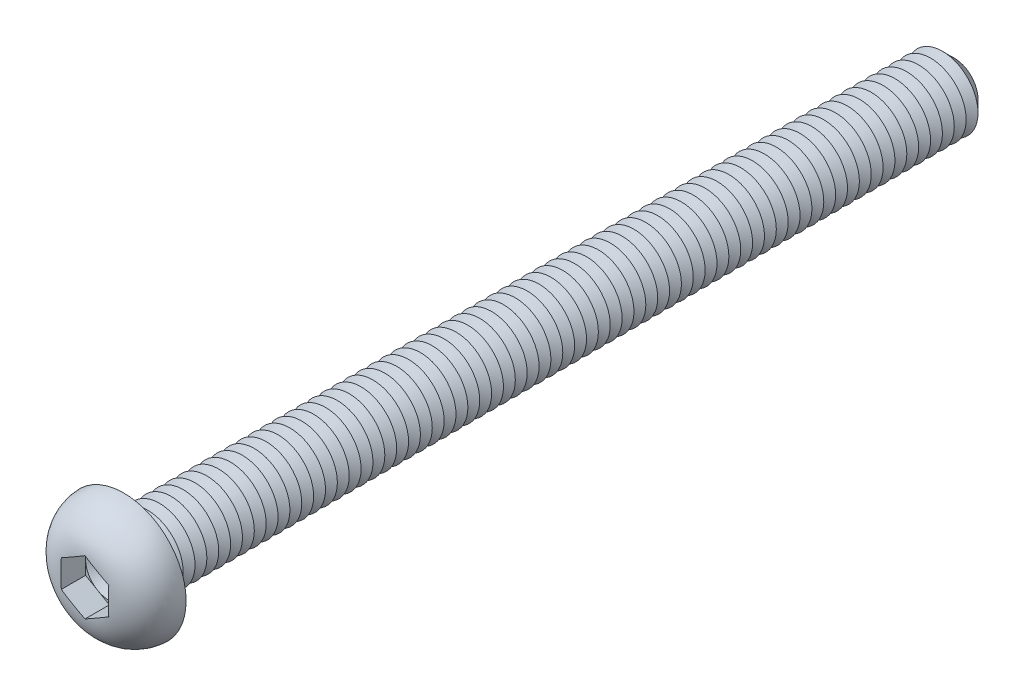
ISO-10303-21;
HEADER;
FILE_DESCRIPTION(('STEP AP214'),'2;1');
FILE_NAME('part.step','',(''),(''),'','','');
FILE_SCHEMA(('AUTOMOTIVE_DESIGN { 1 0 10303 214 1 1 1 1 }'));
ENDSEC;
DATA;
#1=APPLICATION_CONTEXT('core data for automotive mechanical design processes');
#2=APPLICATION_PROTOCOL_DEFINITION('international standard','automotive_design',2000,#1);
#3=PRODUCT_CONTEXT('',#1,'mechanical');
#4=PRODUCT('Part','Part','',(#3));
#5=PRODUCT_RELATED_PRODUCT_CATEGORY('part','',(#4));
#6=PRODUCT_DEFINITION_FORMATION('','',#4);
#7=PRODUCT_DEFINITION_CONTEXT('part definition',#1,'design');
#8=PRODUCT_DEFINITION('design','',#6,#7);
#9=PRODUCT_DEFINITION_SHAPE('','',#8);
#10=(LENGTH_UNIT() NAMED_UNIT(*) SI_UNIT(.MILLI.,.METRE.));
#11=(NAMED_UNIT(*) PLANE_ANGLE_UNIT() SI_UNIT($,.RADIAN.));
#12=(NAMED_UNIT(*) SI_UNIT($,.STERADIAN.) SOLID_ANGLE_UNIT());
#13=UNCERTAINTY_MEASURE_WITH_UNIT(LENGTH_MEASURE(1.E-05),#10,'distance_accuracy_value','');
#14=(GEOMETRIC_REPRESENTATION_CONTEXT(3) GLOBAL_UNCERTAINTY_ASSIGNED_CONTEXT((#13)) GLOBAL_UNIT_ASSIGNED_CONTEXT((#10,
#11,#12)) REPRESENTATION_CONTEXT('',''));
#15=CARTESIAN_POINT('',(0.,0.,0.));
#16=DIRECTION('',(0.,0.,1.));
#17=DIRECTION('',(1.,0.,0.));
#18=AXIS2_PLACEMENT_3D('',#15,#16,#17);
#19=CARTESIAN_POINT('',(0.,0.,1.22));
#20=DIRECTION('',(0.,0.,1.));
#21=DIRECTION('',(1.,0.,0.));
#22=AXIS2_PLACEMENT_3D('',#19,#20,#21);
#23=PLANE('',#22);
#24=CARTESIAN_POINT('',(0.,0.,1.22));
#25=DIRECTION('',(0.,0.,1.));
#26=DIRECTION('',(1.,0.,0.));
#27=AXIS2_PLACEMENT_3D('',#24,#25,#26);
#28=CIRCLE('',#27,2.);
#29=CARTESIAN_POINT('',(2.,0.,1.22));
#30=VERTEX_POINT('',#29);
#31=CARTESIAN_POINT('',(1.,1.73205080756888,1.22));
#32=VERTEX_POINT('',#31);
#33=EDGE_CURVE('E117',#30,#32,#28,.T.);
#34=ORIENTED_EDGE('',*,*,#33,.F.);
#35=DIRECTION('',(0.,1.,0.));
#36=VECTOR('',#35,1.);
#37=CARTESIAN_POINT('',(2.,-1.15470053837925,1.22));
#38=LINE('',#37,#36);
#39=CARTESIAN_POINT('',(2.,1.15470053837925,1.22));
#40=VERTEX_POINT('',#39);
#41=EDGE_CURVE('E140',#30,#40,#38,.T.);
#42=ORIENTED_EDGE('',*,*,#41,.T.);
#43=DIRECTION('',(-0.866025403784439,0.5,0.));
#44=VECTOR('',#43,1.);
#45=CARTESIAN_POINT('',(2.,1.15470053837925,1.22));
#46=LINE('',#45,#44);
#47=EDGE_CURVE('E136',#40,#32,#46,.T.);
#48=ORIENTED_EDGE('',*,*,#47,.T.);
#49=EDGE_LOOP('',(#34,#42,#48));
#50=FACE_BOUND('',#49,.T.);
#51=ADVANCED_FACE('F39',(#50),#23,.T.);
#52=CARTESIAN_POINT('',(0.,0.,1.22));
#53=DIRECTION('',(0.,0.,1.));
#54=DIRECTION('',(1.,0.,0.));
#55=AXIS2_PLACEMENT_3D('',#52,#53,#54);
#56=CIRCLE('',#55,2.);
#57=CARTESIAN_POINT('',(-1.,1.73205080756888,1.22));
#58=VERTEX_POINT('',#57);
#59=EDGE_CURVE('E11',#32,#58,#56,.T.);
#60=ORIENTED_EDGE('',*,*,#59,.F.);
#61=CARTESIAN_POINT('',(0.,2.3094010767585,1.22));
#62=VERTEX_POINT('',#61);
#63=EDGE_CURVE('E130',#32,#62,#46,.T.);
#64=ORIENTED_EDGE('',*,*,#63,.T.);
#65=DIRECTION('',(-0.866025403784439,-0.5,0.));
#66=VECTOR('',#65,1.);
#67=CARTESIAN_POINT('',(0.,2.3094010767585,1.22));
#68=LINE('',#67,#66);
#69=EDGE_CURVE('E131',#62,#58,#68,.T.);
#70=ORIENTED_EDGE('',*,*,#69,.T.);
#71=EDGE_LOOP('',(#60,#64,#70));
#72=FACE_BOUND('',#71,.T.);
#73=ADVANCED_FACE('F129',(#72),#23,.T.);
#74=CARTESIAN_POINT('',(-2.,0.,1.22));
#75=VERTEX_POINT('',#74);
#76=EDGE_CURVE('E49',#58,#75,#56,.T.);
#77=ORIENTED_EDGE('',*,*,#76,.F.);
#78=CARTESIAN_POINT('',(-2.,1.15470053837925,1.22));
#79=VERTEX_POINT('',#78);
#80=EDGE_CURVE('E143',#58,#79,#68,.T.);
#81=ORIENTED_EDGE('',*,*,#80,.T.);
#82=DIRECTION('',(0.,-1.,0.));
#83=VECTOR('',#82,1.);
#84=CARTESIAN_POINT('',(-2.,1.15470053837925,1.22));
#85=LINE('',#84,#83);
#86=EDGE_CURVE('E152',#79,#75,#85,.T.);
#87=ORIENTED_EDGE('',*,*,#86,.T.);
#88=EDGE_LOOP('',(#77,#81,#87));
#89=FACE_BOUND('',#88,.T.);
#90=ADVANCED_FACE('F271',(#89),#23,.T.);
#91=CARTESIAN_POINT('',(-1.,-1.73205080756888,1.22));
#92=VERTEX_POINT('',#91);
#93=EDGE_CURVE('E254',#75,#92,#56,.T.);
#94=ORIENTED_EDGE('',*,*,#93,.F.);
#95=CARTESIAN_POINT('',(-2.,-1.15470053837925,1.22));
#96=VERTEX_POINT('',#95);
#97=EDGE_CURVE('E151',#75,#96,#85,.T.);
#98=ORIENTED_EDGE('',*,*,#97,.T.);
#99=DIRECTION('',(0.866025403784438,-0.5,0.));
#100=VECTOR('',#99,1.);
#101=CARTESIAN_POINT('',(-2.,-1.15470053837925,1.22));
#102=LINE('',#101,#100);
#103=EDGE_CURVE('E157',#96,#92,#102,.T.);
#104=ORIENTED_EDGE('',*,*,#103,.T.);
#105=EDGE_LOOP('',(#94,#98,#104));
#106=FACE_BOUND('',#105,.T.);
#107=ADVANCED_FACE('F266',(#106),#23,.T.);
#108=CARTESIAN_POINT('',(0.999999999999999,-1.73205080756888,1.22));
#109=VERTEX_POINT('',#108);
#110=EDGE_CURVE('E56',#92,#109,#56,.T.);
#111=ORIENTED_EDGE('',*,*,#110,.F.);
#112=CARTESIAN_POINT('',(0.,-2.3094010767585,1.22));
#113=VERTEX_POINT('',#112);
#114=EDGE_CURVE('E156',#92,#113,#102,.T.);
#115=ORIENTED_EDGE('',*,*,#114,.T.);
#116=DIRECTION('',(0.866025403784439,0.5,0.));
#117=VECTOR('',#116,1.);
#118=CARTESIAN_POINT('',(0.,-2.3094010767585,1.22));
#119=LINE('',#118,#117);
#120=EDGE_CURVE('E162',#113,#109,#119,.T.);
#121=ORIENTED_EDGE('',*,*,#120,.T.);
#122=EDGE_LOOP('',(#111,#115,#121));
#123=FACE_BOUND('',#122,.T.);
#124=ADVANCED_FACE('F309',(#123),#23,.T.);
#125=CARTESIAN_POINT('',(0.,0.,-70.));
#126=DIRECTION('',(0.,0.,1.));
#127=DIRECTION('',(1.,0.,0.));
#128=AXIS2_PLACEMENT_3D('',#125,#126,#127);
#129=CYLINDRICAL_SURFACE('',#128,3.);
#130=CARTESIAN_POINT('',(0.,0.,-0.399999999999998));
#131=DIRECTION('',(0.,0.,1.));
#132=DIRECTION('',(1.,0.,0.));
#133=AXIS2_PLACEMENT_3D('',#130,#131,#132);
#134=CIRCLE('',#133,3.);
#135=CARTESIAN_POINT('',(3.,0.,-0.399999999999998));
#136=VERTEX_POINT('',#135);
#137=EDGE_CURVE('E241',#136,#136,#134,.F.);
#138=ORIENTED_EDGE('',*,*,#137,.T.);
#139=EDGE_LOOP('',(#138));
#140=FACE_BOUND('',#139,.T.);
#141=CARTESIAN_POINT('',(0.,0.,-1.));
#142=DIRECTION('',(0.,0.,1.));
#143=DIRECTION('',(1.,0.,0.));
#144=AXIS2_PLACEMENT_3D('',#141,#142,#143);
#145=CIRCLE('',#144,3.00000000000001);
#146=CARTESIAN_POINT('',(3.00000000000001,0.,-1.));
#147=VERTEX_POINT('',#146);
#148=EDGE_CURVE('E138',#147,#147,#145,.T.);
#149=ORIENTED_EDGE('',*,*,#148,.T.);
#150=EDGE_LOOP('',(#149));
#151=FACE_BOUND('',#150,.T.);
#152=ADVANCED_FACE('F310',(#140,#151),#129,.T.);
#153=CARTESIAN_POINT('',(0.,5.25,0.));
#154=DIRECTION('',(0.,0.,1.));
#155=DIRECTION('',(1.,0.,0.));
#156=AXIS2_PLACEMENT_3D('',#153,#154,#155);
#157=PLANE('',#156);
#158=CARTESIAN_POINT('',(0.,0.,0.));
#159=DIRECTION('',(0.,0.,1.));
#160=DIRECTION('',(1.,0.,0.));
#161=AXIS2_PLACEMENT_3D('',#158,#159,#160);
#162=CIRCLE('',#161,3.4);
#163=CARTESIAN_POINT('',(3.4,0.,0.));
#164=VERTEX_POINT('',#163);
#165=EDGE_CURVE('E244',#164,#164,#162,.T.);
#166=ORIENTED_EDGE('',*,*,#165,.T.);
#167=EDGE_LOOP('',(#166));
#168=FACE_BOUND('',#167,.T.);
#169=CARTESIAN_POINT('',(0.,0.,0.));
#170=DIRECTION('',(0.,0.,1.));
#171=DIRECTION('',(1.,0.,0.));
#172=AXIS2_PLACEMENT_3D('',#169,#170,#171);
#173=CIRCLE('',#172,5.25);
#174=CARTESIAN_POINT('',(5.25,0.,0.));
#175=VERTEX_POINT('',#174);
#176=EDGE_CURVE('E173',#175,#175,#173,.T.);
#177=ORIENTED_EDGE('',*,*,#176,.F.);
#178=EDGE_LOOP('',(#177));
#179=FACE_BOUND('',#178,.T.);
#180=ADVANCED_FACE('F313',(#168,#179),#157,.F.);
#181=CARTESIAN_POINT('',(0.,0.,-0.0999999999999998));
#182=DIRECTION('',(0.,0.,1.));
#183=DIRECTION('',(1.,0.,0.));
#184=AXIS2_PLACEMENT_3D('',#181,#182,#183);
#185=DEGENERATE_TOROIDAL_SURFACE('',#184,1.85147090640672,3.4,.T.);
#186=CARTESIAN_POINT('',(-2.0002,1.15458506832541,3.26900492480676));
#187=CARTESIAN_POINT('',(-1.91694658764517,1.20265144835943,3.27552708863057));
#188=CARTESIAN_POINT('',(-1.83362001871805,1.25076006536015,3.28041849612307));
#189=CARTESIAN_POINT('',(-1.66691146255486,1.34700929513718,3.28784569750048));
#190=CARTESIAN_POINT('',(-1.58352950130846,1.39514989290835,3.29038223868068));
#191=CARTESIAN_POINT('',(-1.4167967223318,1.49141310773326,3.29400753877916));
#192=CARTESIAN_POINT('',(-1.33344591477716,1.5395357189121,3.29509714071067));
#193=CARTESIAN_POINT('',(-1.16673007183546,1.63578915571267,3.29647051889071));
#194=CARTESIAN_POINT('',(-1.08336503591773,1.68391998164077,3.29675420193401));
#195=CARTESIAN_POINT('',(-0.916634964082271,1.78018163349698,3.29675420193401));
#196=CARTESIAN_POINT('',(-0.833269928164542,1.82831245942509,3.29647051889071));
#197=CARTESIAN_POINT('',(-0.666554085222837,1.92456589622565,3.29509714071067));
#198=CARTESIAN_POINT('',(-0.583203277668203,1.9726885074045,3.29400753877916));
#199=CARTESIAN_POINT('',(-0.416470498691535,2.06895172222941,3.29038223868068));
#200=CARTESIAN_POINT('',(-0.333088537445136,2.11709232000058,3.28784569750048));
#201=CARTESIAN_POINT('',(-0.166379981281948,2.21334154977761,3.28041849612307));
#202=CARTESIAN_POINT('',(-0.0830534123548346,2.26145016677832,3.27552708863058));
#203=CARTESIAN_POINT('',(0.000200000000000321,2.30951654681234,3.26900492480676));
#204=B_SPLINE_CURVE_WITH_KNOTS('',3,(#186,#187,#188,#189,#190,#191,#192,#193,#194,#195,#196,
#197,#198,#199,#200,#201,#202,#203),.UNSPECIFIED.,.F.,.F.,(4,2,2,2,2,2,2,2,4),(0.,
0.289010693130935,0.57792963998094,0.866680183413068,1.15546411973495,1.44424805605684,
1.73299859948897,2.02191754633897,2.31092823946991),.UNSPECIFIED.);
#205=CARTESIAN_POINT('',(-2.,1.15470053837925,3.26902062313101));
#206=VERTEX_POINT('',#205);
#207=CARTESIAN_POINT('',(1.70733705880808E-11,2.30940107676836,3.2690206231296));
#208=VERTEX_POINT('',#207);
#209=EDGE_CURVE('E195',#206,#208,#204,.T.);
#210=ORIENTED_EDGE('',*,*,#209,.T.);
#211=CARTESIAN_POINT('',(-0.000199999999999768,2.30951654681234,3.26900492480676));
#212=CARTESIAN_POINT('',(0.0830534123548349,2.26145016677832,3.27552708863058));
#213=CARTESIAN_POINT('',(0.166379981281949,2.21334154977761,3.28041849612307));
#214=CARTESIAN_POINT('',(0.333088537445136,2.11709232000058,3.28784569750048));
#215=CARTESIAN_POINT('',(0.416470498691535,2.06895172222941,3.29038223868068));
#216=CARTESIAN_POINT('',(0.583203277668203,1.9726885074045,3.29400753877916));
#217=CARTESIAN_POINT('',(0.666554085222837,1.92456589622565,3.29509714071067));
#218=CARTESIAN_POINT('',(0.833269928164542,1.82831245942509,3.29647051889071));
#219=CARTESIAN_POINT('',(0.916634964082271,1.78018163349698,3.29675420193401));
#220=CARTESIAN_POINT('',(1.08336503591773,1.68391998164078,3.29675420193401));
#221=CARTESIAN_POINT('',(1.16673007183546,1.63578915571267,3.29647051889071));
#222=CARTESIAN_POINT('',(1.33344591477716,1.5395357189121,3.29509714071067));
#223=CARTESIAN_POINT('',(1.4167967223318,1.49141310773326,3.29400753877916));
#224=CARTESIAN_POINT('',(1.58352950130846,1.39514989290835,3.29038223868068));
#225=CARTESIAN_POINT('',(1.66691146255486,1.34700929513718,3.28784569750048));
#226=CARTESIAN_POINT('',(1.83362001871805,1.25076006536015,3.28041849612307));
#227=CARTESIAN_POINT('',(1.91694658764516,1.20265144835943,3.27552708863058));
#228=CARTESIAN_POINT('',(2.0002,1.15458506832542,3.26900492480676));
#229=B_SPLINE_CURVE_WITH_KNOTS('',3,(#211,#212,#213,#214,#215,#216,#217,#218,#219,#220,#221,
#222,#223,#224,#225,#226,#227,#228),.UNSPECIFIED.,.F.,.F.,(4,2,2,2,2,2,2,2,4),(0.,
0.289010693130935,0.577929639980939,0.866680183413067,1.15546411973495,1.44424805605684,
1.73299859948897,2.02191754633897,2.31092823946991),.UNSPECIFIED.);
#230=CARTESIAN_POINT('',(2.,1.15470053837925,3.26902062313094));
#231=VERTEX_POINT('',#230);
#232=EDGE_CURVE('E224',#208,#231,#229,.T.);
#233=ORIENTED_EDGE('',*,*,#232,.T.);
#234=CARTESIAN_POINT('',(2.,0.,3.29675420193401));
#235=CARTESIAN_POINT('',(2.,-0.0838690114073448,3.29675159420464));
#236=CARTESIAN_POINT('',(2.,-0.167737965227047,3.29653427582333));
#237=CARTESIAN_POINT('',(2.,-0.335473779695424,3.29552217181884));
#238=CARTESIAN_POINT('',(2.,-0.419340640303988,3.29472737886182));
#239=CARTESIAN_POINT('',(2.,-0.587092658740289,3.29218243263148));
#240=CARTESIAN_POINT('',(2.,-0.670977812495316,3.29043194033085));
#241=CARTESIAN_POINT('',(2.,-0.838702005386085,3.28542814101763));
#242=CARTESIAN_POINT('',(2.,-0.922541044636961,3.28217483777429));
#243=CARTESIAN_POINT('',(2.,-1.173343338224,3.26923984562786));
#244=CARTESIAN_POINT('',(2.,-1.34017699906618,3.25638268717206));
#245=CARTESIAN_POINT('',(2.,-1.67225876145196,3.21731215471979));
#246=CARTESIAN_POINT('',(2.,-1.83750825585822,3.19111187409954));
#247=CARTESIAN_POINT('',(2.,-2.10571503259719,3.13417573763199));
#248=CARTESIAN_POINT('',(2.,-2.20973442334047,3.10844622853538));
#249=CARTESIAN_POINT('',(2.,-2.41562153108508,3.04936015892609));
#250=CARTESIAN_POINT('',(2.,-2.51748898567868,3.01600267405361));
#251=CARTESIAN_POINT('',(2.,-2.71832295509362,2.94120377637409));
#252=CARTESIAN_POINT('',(2.,-2.81728700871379,2.89975572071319));
#253=CARTESIAN_POINT('',(2.,-3.01134256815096,2.80859624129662));
#254=CARTESIAN_POINT('',(2.,-3.10643425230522,2.75888519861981));
#255=CARTESIAN_POINT('',(2.,-3.29253530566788,2.65079509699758));
#256=CARTESIAN_POINT('',(2.,-3.38350832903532,2.59235327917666));
#257=CARTESIAN_POINT('',(2.,-3.55964478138,2.46728791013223));
#258=CARTESIAN_POINT('',(2.,-3.64480873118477,2.40066509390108));
#259=CARTESIAN_POINT('',(2.,-3.80840353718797,2.25961603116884));
#260=CARTESIAN_POINT('',(2.,-3.88683504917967,2.18519054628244));
#261=CARTESIAN_POINT('',(2.,-4.03608847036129,2.02906828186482));
#262=CARTESIAN_POINT('',(2.,-4.106911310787,1.94737239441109));
#263=CARTESIAN_POINT('',(2.,-4.23287471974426,1.78665318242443));
#264=CARTESIAN_POINT('',(2.,-4.2888832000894,1.7083085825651));
#265=CARTESIAN_POINT('',(2.,-4.39372062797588,1.54691061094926));
#266=CARTESIAN_POINT('',(2.,-4.44254705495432,1.46385560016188));
#267=CARTESIAN_POINT('',(2.,-4.53249771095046,1.29375158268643));
#268=CARTESIAN_POINT('',(2.,-4.57362814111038,1.20670586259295));
#269=CARTESIAN_POINT('',(2.,-4.6478549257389,1.02924414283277));
#270=CARTESIAN_POINT('',(2.,-4.68094842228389,0.938826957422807));
#271=CARTESIAN_POINT('',(2.,-4.76413649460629,0.674747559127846));
#272=CARTESIAN_POINT('',(2.,-4.80368573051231,0.497625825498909));
#273=CARTESIAN_POINT('',(2.,-4.85179982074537,0.13932226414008));
#274=CARTESIAN_POINT('',(2.,-4.86036774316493,-0.0418591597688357));
#275=CARTESIAN_POINT('',(2.,-4.84642577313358,-0.399473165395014));
#276=CARTESIAN_POINT('',(2.,-4.82452156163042,-0.575929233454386));
#277=CARTESIAN_POINT('',(2.,-4.75142809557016,-0.922615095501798));
#278=CARTESIAN_POINT('',(2.,-4.70024536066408,-1.09284626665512));
#279=CARTESIAN_POINT('',(2.,-4.57020203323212,-1.42258491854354));
#280=CARTESIAN_POINT('',(2.,-4.49131097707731,-1.58208036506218));
#281=CARTESIAN_POINT('',(2.,-4.3083542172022,-1.8860021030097));
#282=CARTESIAN_POINT('',(2.,-4.2042742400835,-2.03041978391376));
#283=CARTESIAN_POINT('',(2.,-3.97174533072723,-2.30354399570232));
#284=CARTESIAN_POINT('',(2.,-3.84281347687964,-2.43183812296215));
#285=CARTESIAN_POINT('',(2.,-3.56631740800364,-2.66612298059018));
#286=CARTESIAN_POINT('',(2.,-3.41877418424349,-2.77213848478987));
#287=CARTESIAN_POINT('',(2.,-3.18261597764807,-2.91604941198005));
#288=CARTESIAN_POINT('',(2.,-3.09905663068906,-2.96247915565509));
#289=CARTESIAN_POINT('',(2.,-2.92856838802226,-3.04879370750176));
#290=CARTESIAN_POINT('',(2.,-2.84163827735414,-3.08867612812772));
#291=CARTESIAN_POINT('',(2.,-2.66495003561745,-3.16199567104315));
#292=CARTESIAN_POINT('',(2.,-2.57518752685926,-3.19542218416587));
#293=CARTESIAN_POINT('',(2.,-2.3936698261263,-3.25594506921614));
#294=CARTESIAN_POINT('',(2.,-2.30191676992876,-3.28304789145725));
#295=CARTESIAN_POINT('',(2.,-2.07265810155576,-3.34285611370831));
#296=CARTESIAN_POINT('',(2.,-1.93423373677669,-3.37205334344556));
#297=CARTESIAN_POINT('',(2.,-1.65546420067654,-3.419280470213));
#298=CARTESIAN_POINT('',(2.,-1.51511762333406,-3.43730169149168));
#299=CARTESIAN_POINT('',(2.,-1.23291689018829,-3.46473877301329));
#300=CARTESIAN_POINT('',(2.,-1.09105869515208,-3.47411015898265));
#301=CARTESIAN_POINT('',(2.,-0.807138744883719,-3.48717303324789));
#302=CARTESIAN_POINT('',(2.,-0.665077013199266,-3.4908651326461));
#303=CARTESIAN_POINT('',(2.,-0.451303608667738,-3.49429675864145));
#304=CARTESIAN_POINT('',(2.,-0.379602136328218,-3.49508825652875));
#305=CARTESIAN_POINT('',(2.,-0.236195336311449,-3.49619580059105));
#306=CARTESIAN_POINT('',(2.,-0.164490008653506,-3.49651184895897));
#307=CARTESIAN_POINT('',(2.,-0.0210718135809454,-3.49680708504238));
#308=CARTESIAN_POINT('',(2.,0.0506410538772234,-3.49678623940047));
#309=CARTESIAN_POINT('',(2.,0.194065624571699,-3.49639104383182));
#310=CARTESIAN_POINT('',(2.,0.265777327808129,-3.49601669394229));
#311=CARTESIAN_POINT('',(2.,0.480501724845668,-3.4941697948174));
#312=CARTESIAN_POINT('',(2.,0.623510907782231,-3.49197539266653));
#313=CARTESIAN_POINT('',(2.,0.909378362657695,-3.48318258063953));
#314=CARTESIAN_POINT('',(2.,1.05223667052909,-3.47658576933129));
#315=CARTESIAN_POINT('',(2.,1.30726724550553,-3.45800282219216));
#316=CARTESIAN_POINT('',(2.,1.41953767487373,-3.44745204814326));
#317=CARTESIAN_POINT('',(2.,1.64336701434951,-3.42020385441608));
#318=CARTESIAN_POINT('',(2.,1.75492585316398,-3.40350582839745));
#319=CARTESIAN_POINT('',(2.,1.97590795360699,-3.36293007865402));
#320=CARTESIAN_POINT('',(2.,2.08534088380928,-3.33910600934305));
#321=CARTESIAN_POINT('',(2.,2.30216001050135,-3.28336687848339));
#322=CARTESIAN_POINT('',(2.,2.40954602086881,-3.25145108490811));
#323=CARTESIAN_POINT('',(2.,2.62289868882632,-3.1784271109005));
#324=CARTESIAN_POINT('',(2.,2.72882262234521,-3.13719314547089));
#325=CARTESIAN_POINT('',(2.,2.93660837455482,-3.04548652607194));
#326=CARTESIAN_POINT('',(2.,3.03847031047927,-2.99501413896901));
#327=CARTESIAN_POINT('',(2.,3.23738754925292,-2.88459171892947));
#328=CARTESIAN_POINT('',(2.,3.33442546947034,-2.82461027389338));
#329=CARTESIAN_POINT('',(2.,3.52225616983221,-2.69545434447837));
#330=CARTESIAN_POINT('',(2.,3.61304636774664,-2.62627609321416));
#331=CARTESIAN_POINT('',(2.,3.77958578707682,-2.48563135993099));
#332=CARTESIAN_POINT('',(2.,3.85595570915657,-2.41489922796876));
#333=CARTESIAN_POINT('',(2.,4.00175744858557,-2.26661746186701));
#334=CARTESIAN_POINT('',(2.,4.07118992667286,-2.18906847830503));
#335=CARTESIAN_POINT('',(2.,4.20228235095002,-2.02784942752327));
#336=CARTESIAN_POINT('',(2.,4.26395450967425,-1.94418931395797));
#337=CARTESIAN_POINT('',(2.,4.37897455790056,-1.7713710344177));
#338=CARTESIAN_POINT('',(2.,4.43232318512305,-1.68221335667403));
#339=CARTESIAN_POINT('',(2.,4.5685109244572,-1.42722170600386));
#340=CARTESIAN_POINT('',(2.,4.64167742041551,-1.25607726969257));
#341=CARTESIAN_POINT('',(2.,4.75695354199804,-0.903699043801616));
#342=CARTESIAN_POINT('',(2.,4.79906366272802,-0.722465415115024));
#343=CARTESIAN_POINT('',(2.,4.84982785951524,-0.362243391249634));
#344=CARTESIAN_POINT('',(2.,4.85966759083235,-0.183422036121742));
#345=CARTESIAN_POINT('',(2.,4.84889099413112,0.17327689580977));
#346=CARTESIAN_POINT('',(2.,4.82827907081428,0.351154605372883));
#347=CARTESIAN_POINT('',(2.,4.75760776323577,0.699332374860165));
#348=CARTESIAN_POINT('',(2.,4.70780624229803,0.869684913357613));
#349=CARTESIAN_POINT('',(2.,4.58058971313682,1.199716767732));
#350=CARTESIAN_POINT('',(2.,4.50317623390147,1.35939667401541));
#351=CARTESIAN_POINT('',(2.,4.32230037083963,1.66542907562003));
#352=CARTESIAN_POINT('',(2.,4.21858077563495,1.81162931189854));
#353=CARTESIAN_POINT('',(2.,3.98879583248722,2.08527000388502));
#354=CARTESIAN_POINT('',(2.,3.86272429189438,2.21270524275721));
#355=CARTESIAN_POINT('',(2.,3.58743550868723,2.45020985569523));
#356=CARTESIAN_POINT('',(2.,3.43756474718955,2.55951924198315));
#357=CARTESIAN_POINT('',(2.,3.12282273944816,2.7535430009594));
#358=CARTESIAN_POINT('',(2.,2.95795742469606,2.83826704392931));
#359=CARTESIAN_POINT('',(2.,2.67096435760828,2.96064273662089));
#360=CARTESIAN_POINT('',(2.,2.55150855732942,3.00473766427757));
#361=CARTESIAN_POINT('',(2.,2.30905936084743,3.08191633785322));
#362=CARTESIAN_POINT('',(2.,2.18606487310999,3.11499664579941));
#363=CARTESIAN_POINT('',(2.,1.93761764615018,3.17114962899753));
#364=CARTESIAN_POINT('',(2.,1.8121607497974,3.19420352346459));
#365=CARTESIAN_POINT('',(2.,1.56000755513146,3.23170431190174));
#366=CARTESIAN_POINT('',(2.,1.43331126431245,3.24615125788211));
#367=CARTESIAN_POINT('',(2.,1.19785080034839,3.26676473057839));
#368=CARTESIAN_POINT('',(2.,1.08915974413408,3.27383022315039));
#369=CARTESIAN_POINT('',(2.,0.87159878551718,3.28448481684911));
#370=CARTESIAN_POINT('',(2.,0.762728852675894,3.28807324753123));
#371=CARTESIAN_POINT('',(2.,0.54488171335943,3.29312180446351));
#372=CARTESIAN_POINT('',(2.,0.435904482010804,3.29458062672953));
#373=CARTESIAN_POINT('',(2.,0.217951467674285,3.29639847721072));
#374=CARTESIAN_POINT('',(2.,0.108975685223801,3.29675759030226));
#375=CARTESIAN_POINT('',(2.,0.,3.29675420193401));
#376=B_SPLINE_CURVE_WITH_KNOTS('',3,(#234,#235,#236,#237,#238,#239,#240,#241,#242,#243,#244,
#245,#246,#247,#248,#249,#250,#251,#252,#253,#254,#255,#256,#257,#258,#259,#260,#261,#262,#263,
#264,#265,#266,#267,#268,#269,#270,#271,#272,#273,#274,#275,#276,#277,#278,#279,#280,#281,#282,
#283,#284,#285,#286,#287,#288,#289,#290,#291,#292,#293,#294,#295,#296,#297,#298,#299,#300,#301,
#302,#303,#304,#305,#306,#307,#308,#309,#310,#311,#312,#313,#314,#315,#316,#317,#318,#319,#320,
#321,#322,#323,#324,#325,#326,#327,#328,#329,#330,#331,#332,#333,#334,#335,#336,#337,#338,#339,
#340,#341,#342,#343,#344,#345,#346,#347,#348,#349,#350,#351,#352,#353,#354,#355,#356,#357,#358,
#359,#360,#361,#362,#363,#364,#365,#366,#367,#368,#369,#370,#371,#372,#373,#374,#375),
.UNSPECIFIED.,.T.,.F.,(4,2,2,2,2,2,2,2,2,2,2,2,2,2,2,2,2,2,2,2,2,2,2,2,2,2,2,2,2,2,2,2,2,2,2,2,
2,2,2,2,2,2,2,2,2,2,2,2,2,2,2,2,2,2,2,2,2,2,2,2,2,2,2,2,2,2,2,2,2,2,4),(0.,0.251606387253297,
0.503215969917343,0.754914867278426,1.00661313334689,1.50825543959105,2.00940643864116,
2.33061510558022,2.65186271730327,2.97337521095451,3.29487288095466,3.61880390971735,
3.94270585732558,4.26657621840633,4.59040689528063,4.8789527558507,5.16759964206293,
5.45601293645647,5.74452864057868,6.28608750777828,6.82759274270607,7.35848716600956,
7.8892634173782,8.42062506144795,8.95228851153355,9.49557283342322,10.0382497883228,
10.3247866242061,10.6114277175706,10.8985359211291,11.1853499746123,11.6091713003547,
12.0333212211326,12.4596400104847,12.8859129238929,13.1010304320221,13.316146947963,
13.5312847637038,13.746422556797,14.1754765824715,14.6043748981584,14.9425387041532,
15.2807358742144,15.6164481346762,15.9521907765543,16.2927694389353,16.6333382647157,
16.9750565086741,17.3169151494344,17.6287548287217,17.9405647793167,18.2518777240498,
18.5631630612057,19.1185081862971,19.6738444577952,20.20853386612,20.7431459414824,
21.2731049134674,21.8030345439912,22.3383600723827,22.8738341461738,23.4279697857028,
23.9818871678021,24.3633752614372,24.7449823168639,25.1273011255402,25.5096176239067,
25.8363061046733,26.163057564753,26.4900090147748,26.8169352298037),.UNSPECIFIED.);
#377=CARTESIAN_POINT('',(2.,-1.15470053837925,3.26902062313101));
#378=VERTEX_POINT('',#377);
#379=EDGE_CURVE('E233',#231,#378,#376,.T.);
#380=ORIENTED_EDGE('',*,*,#379,.T.);
#381=CARTESIAN_POINT('',(2.0002,-1.15458506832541,3.26900492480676));
#382=CARTESIAN_POINT('',(1.91694658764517,-1.20265144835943,3.27552708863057));
#383=CARTESIAN_POINT('',(1.83362001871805,-1.25076006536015,3.28041849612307));
#384=CARTESIAN_POINT('',(1.66691146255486,-1.34700929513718,3.28784569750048));
#385=CARTESIAN_POINT('',(1.58352950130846,-1.39514989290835,3.29038223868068));
#386=CARTESIAN_POINT('',(1.4167967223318,-1.49141310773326,3.29400753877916));
#387=CARTESIAN_POINT('',(1.33344591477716,-1.5395357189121,3.29509714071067));
#388=CARTESIAN_POINT('',(1.16673007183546,-1.63578915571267,3.29647051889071));
#389=CARTESIAN_POINT('',(1.08336503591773,-1.68391998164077,3.29675420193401));
#390=CARTESIAN_POINT('',(0.916634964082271,-1.78018163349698,3.29675420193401));
#391=CARTESIAN_POINT('',(0.833269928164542,-1.82831245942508,3.29647051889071));
#392=CARTESIAN_POINT('',(0.666554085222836,-1.92456589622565,3.29509714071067));
#393=CARTESIAN_POINT('',(0.583203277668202,-1.97268850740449,3.29400753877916));
#394=CARTESIAN_POINT('',(0.416470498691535,-2.06895172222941,3.29038223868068));
#395=CARTESIAN_POINT('',(0.333088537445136,-2.11709232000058,3.28784569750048));
#396=CARTESIAN_POINT('',(0.166379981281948,-2.2133415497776,3.28041849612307));
#397=CARTESIAN_POINT('',(0.0830534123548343,-2.26145016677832,3.27552708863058));
#398=CARTESIAN_POINT('',(-0.000200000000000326,-2.30951654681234,3.26900492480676));
#399=B_SPLINE_CURVE_WITH_KNOTS('',3,(#381,#382,#383,#384,#385,#386,#387,#388,#389,#390,#391,
#392,#393,#394,#395,#396,#397,#398),.UNSPECIFIED.,.F.,.F.,(4,2,2,2,2,2,2,2,4),(0.,
0.289010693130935,0.57792963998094,0.866680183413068,1.15546411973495,1.44424805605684,
1.73299859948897,2.02191754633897,2.31092823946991),.UNSPECIFIED.);
#400=CARTESIAN_POINT('',(0.,-2.3094010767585,3.26902062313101));
#401=VERTEX_POINT('',#400);
#402=EDGE_CURVE('E282',#378,#401,#399,.T.);
#403=ORIENTED_EDGE('',*,*,#402,.T.);
#404=CARTESIAN_POINT('',(0.000199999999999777,-2.30951654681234,3.26900492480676));
#405=CARTESIAN_POINT('',(-0.083053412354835,-2.26145016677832,3.27552708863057));
#406=CARTESIAN_POINT('',(-0.166379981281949,-2.21334154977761,3.28041849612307));
#407=CARTESIAN_POINT('',(-0.333088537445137,-2.11709232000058,3.28784569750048));
#408=CARTESIAN_POINT('',(-0.416470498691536,-2.06895172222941,3.29038223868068));
#409=CARTESIAN_POINT('',(-0.583203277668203,-1.97268850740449,3.29400753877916));
#410=CARTESIAN_POINT('',(-0.666554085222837,-1.92456589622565,3.29509714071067));
#411=CARTESIAN_POINT('',(-0.833269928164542,-1.82831245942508,3.29647051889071));
#412=CARTESIAN_POINT('',(-0.916634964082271,-1.78018163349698,3.29675420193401));
#413=CARTESIAN_POINT('',(-1.08336503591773,-1.68391998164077,3.29675420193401));
#414=CARTESIAN_POINT('',(-1.16673007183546,-1.63578915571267,3.29647051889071));
#415=CARTESIAN_POINT('',(-1.33344591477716,-1.5395357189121,3.29509714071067));
#416=CARTESIAN_POINT('',(-1.4167967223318,-1.49141310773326,3.29400753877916));
#417=CARTESIAN_POINT('',(-1.58352950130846,-1.39514989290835,3.29038223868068));
#418=CARTESIAN_POINT('',(-1.66691146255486,-1.34700929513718,3.28784569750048));
#419=CARTESIAN_POINT('',(-1.83362001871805,-1.25076006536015,3.28041849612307));
#420=CARTESIAN_POINT('',(-1.91694658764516,-1.20265144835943,3.27552708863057));
#421=CARTESIAN_POINT('',(-2.0002,-1.15458506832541,3.26900492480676));
#422=B_SPLINE_CURVE_WITH_KNOTS('',3,(#404,#405,#406,#407,#408,#409,#410,#411,#412,#413,#414,
#415,#416,#417,#418,#419,#420,#421),.UNSPECIFIED.,.F.,.F.,(4,2,2,2,2,2,2,2,4),(0.,
0.289010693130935,0.577929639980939,0.866680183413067,1.15546411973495,1.44424805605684,
1.73299859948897,2.02191754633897,2.31092823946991),.UNSPECIFIED.);
#423=CARTESIAN_POINT('',(-2.,-1.15470053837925,3.26902062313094));
#424=VERTEX_POINT('',#423);
#425=EDGE_CURVE('E278',#401,#424,#422,.T.);
#426=ORIENTED_EDGE('',*,*,#425,.T.);
#427=CARTESIAN_POINT('',(-2.,0.,3.29675420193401));
#428=CARTESIAN_POINT('',(-2.,0.0838690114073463,3.29675159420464));
#429=CARTESIAN_POINT('',(-2.,0.167737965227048,3.29653427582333));
#430=CARTESIAN_POINT('',(-2.,0.335473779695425,3.29552217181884));
#431=CARTESIAN_POINT('',(-2.,0.41934064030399,3.29472737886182));
#432=CARTESIAN_POINT('',(-2.,0.58709265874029,3.29218243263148));
#433=CARTESIAN_POINT('',(-2.,0.670977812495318,3.29043194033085));
#434=CARTESIAN_POINT('',(-2.,0.838702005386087,3.28542814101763));
#435=CARTESIAN_POINT('',(-2.,0.922541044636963,3.28217483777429));
#436=CARTESIAN_POINT('',(-2.,1.173343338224,3.26923984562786));
#437=CARTESIAN_POINT('',(-2.,1.34017699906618,3.25638268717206));
#438=CARTESIAN_POINT('',(-2.,1.67225876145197,3.21731215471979));
#439=CARTESIAN_POINT('',(-2.,1.83750825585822,3.19111187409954));
#440=CARTESIAN_POINT('',(-2.,2.10571503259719,3.13417573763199));
#441=CARTESIAN_POINT('',(-2.,2.20973442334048,3.10844622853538));
#442=CARTESIAN_POINT('',(-2.,2.41562153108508,3.04936015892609));
#443=CARTESIAN_POINT('',(-2.,2.51748898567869,3.01600267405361));
#444=CARTESIAN_POINT('',(-2.,2.71832295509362,2.94120377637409));
#445=CARTESIAN_POINT('',(-2.,2.81728700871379,2.89975572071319));
#446=CARTESIAN_POINT('',(-2.,3.01134256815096,2.80859624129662));
#447=CARTESIAN_POINT('',(-2.,3.10643425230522,2.75888519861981));
#448=CARTESIAN_POINT('',(-2.,3.29253530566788,2.65079509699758));
#449=CARTESIAN_POINT('',(-2.,3.38350832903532,2.59235327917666));
#450=CARTESIAN_POINT('',(-2.,3.55964478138,2.46728791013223));
#451=CARTESIAN_POINT('',(-2.,3.64480873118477,2.40066509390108));
#452=CARTESIAN_POINT('',(-2.,3.80840353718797,2.25961603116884));
#453=CARTESIAN_POINT('',(-2.,3.88683504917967,2.18519054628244));
#454=CARTESIAN_POINT('',(-2.,4.03608847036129,2.02906828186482));
#455=CARTESIAN_POINT('',(-2.,4.106911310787,1.94737239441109));
#456=CARTESIAN_POINT('',(-2.,4.23287471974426,1.78665318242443));
#457=CARTESIAN_POINT('',(-2.,4.2888832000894,1.7083085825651));
#458=CARTESIAN_POINT('',(-2.,4.39372062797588,1.54691061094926));
#459=CARTESIAN_POINT('',(-2.,4.44254705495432,1.46385560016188));
#460=CARTESIAN_POINT('',(-2.,4.53249771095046,1.29375158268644));
#461=CARTESIAN_POINT('',(-2.,4.57362814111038,1.20670586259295));
#462=CARTESIAN_POINT('',(-2.,4.6478549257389,1.02924414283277));
#463=CARTESIAN_POINT('',(-2.,4.68094842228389,0.938826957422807));
#464=CARTESIAN_POINT('',(-2.,4.76413649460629,0.674747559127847));
#465=CARTESIAN_POINT('',(-2.,4.80368573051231,0.497625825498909));
#466=CARTESIAN_POINT('',(-2.,4.85179982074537,0.13932226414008));
#467=CARTESIAN_POINT('',(-2.,4.86036774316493,-0.0418591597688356));
#468=CARTESIAN_POINT('',(-2.,4.84642577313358,-0.399473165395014));
#469=CARTESIAN_POINT('',(-2.,4.82452156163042,-0.575929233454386));
#470=CARTESIAN_POINT('',(-2.,4.75142809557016,-0.922615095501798));
#471=CARTESIAN_POINT('',(-2.,4.70024536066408,-1.09284626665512));
#472=CARTESIAN_POINT('',(-2.,4.57020203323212,-1.42258491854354));
#473=CARTESIAN_POINT('',(-2.,4.49131097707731,-1.58208036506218));
#474=CARTESIAN_POINT('',(-2.,4.3083542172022,-1.8860021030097));
#475=CARTESIAN_POINT('',(-2.,4.2042742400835,-2.03041978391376));
#476=CARTESIAN_POINT('',(-2.,3.97174533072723,-2.30354399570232));
#477=CARTESIAN_POINT('',(-2.,3.84281347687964,-2.43183812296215));
#478=CARTESIAN_POINT('',(-2.,3.56631740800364,-2.66612298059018));
#479=CARTESIAN_POINT('',(-2.,3.41877418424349,-2.77213848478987));
#480=CARTESIAN_POINT('',(-2.,3.18261597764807,-2.91604941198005));
#481=CARTESIAN_POINT('',(-2.,3.09905663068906,-2.96247915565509));
#482=CARTESIAN_POINT('',(-2.,2.92856838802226,-3.04879370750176));
#483=CARTESIAN_POINT('',(-2.,2.84163827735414,-3.08867612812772));
#484=CARTESIAN_POINT('',(-2.,2.66495003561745,-3.16199567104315));
#485=CARTESIAN_POINT('',(-2.,2.57518752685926,-3.19542218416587));
#486=CARTESIAN_POINT('',(-2.,2.3936698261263,-3.25594506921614));
#487=CARTESIAN_POINT('',(-2.,2.30191676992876,-3.28304789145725));
#488=CARTESIAN_POINT('',(-2.,2.07265810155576,-3.34285611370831));
#489=CARTESIAN_POINT('',(-2.,1.93423373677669,-3.37205334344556));
#490=CARTESIAN_POINT('',(-2.,1.65546420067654,-3.419280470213));
#491=CARTESIAN_POINT('',(-2.,1.51511762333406,-3.43730169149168));
#492=CARTESIAN_POINT('',(-2.,1.23291689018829,-3.46473877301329));
#493=CARTESIAN_POINT('',(-2.,1.09105869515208,-3.47411015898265));
#494=CARTESIAN_POINT('',(-2.,0.807138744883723,-3.48717303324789));
#495=CARTESIAN_POINT('',(-2.,0.66507701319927,-3.4908651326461));
#496=CARTESIAN_POINT('',(-2.,0.451303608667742,-3.49429675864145));
#497=CARTESIAN_POINT('',(-2.,0.379602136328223,-3.49508825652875));
#498=CARTESIAN_POINT('',(-2.,0.236195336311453,-3.49619580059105));
#499=CARTESIAN_POINT('',(-2.,0.16449000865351,-3.49651184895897));
#500=CARTESIAN_POINT('',(-2.,0.0210718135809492,-3.49680708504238));
#501=CARTESIAN_POINT('',(-2.,-0.0506410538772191,-3.49678623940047));
#502=CARTESIAN_POINT('',(-2.,-0.194065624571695,-3.49639104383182));
#503=CARTESIAN_POINT('',(-2.,-0.265777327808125,-3.49601669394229));
#504=CARTESIAN_POINT('',(-2.,-0.480501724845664,-3.4941697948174));
#505=CARTESIAN_POINT('',(-2.,-0.623510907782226,-3.49197539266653));
#506=CARTESIAN_POINT('',(-2.,-0.909378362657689,-3.48318258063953));
#507=CARTESIAN_POINT('',(-2.,-1.05223667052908,-3.47658576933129));
#508=CARTESIAN_POINT('',(-2.,-1.30726724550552,-3.45800282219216));
#509=CARTESIAN_POINT('',(-2.,-1.41953767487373,-3.44745204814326));
#510=CARTESIAN_POINT('',(-2.,-1.6433670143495,-3.42020385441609));
#511=CARTESIAN_POINT('',(-2.,-1.75492585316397,-3.40350582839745));
#512=CARTESIAN_POINT('',(-2.,-1.97590795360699,-3.36293007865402));
#513=CARTESIAN_POINT('',(-2.,-2.08534088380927,-3.33910600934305));
#514=CARTESIAN_POINT('',(-2.,-2.30216001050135,-3.28336687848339));
#515=CARTESIAN_POINT('',(-2.,-2.4095460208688,-3.25145108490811));
#516=CARTESIAN_POINT('',(-2.,-2.62289868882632,-3.1784271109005));
#517=CARTESIAN_POINT('',(-2.,-2.72882262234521,-3.13719314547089));
#518=CARTESIAN_POINT('',(-2.,-2.93660837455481,-3.04548652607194));
#519=CARTESIAN_POINT('',(-2.,-3.03847031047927,-2.99501413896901));
#520=CARTESIAN_POINT('',(-2.,-3.23738754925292,-2.88459171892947));
#521=CARTESIAN_POINT('',(-2.,-3.33442546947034,-2.82461027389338));
#522=CARTESIAN_POINT('',(-2.,-3.52225616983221,-2.69545434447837));
#523=CARTESIAN_POINT('',(-2.,-3.61304636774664,-2.62627609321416));
#524=CARTESIAN_POINT('',(-2.,-3.77958578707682,-2.48563135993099));
#525=CARTESIAN_POINT('',(-2.,-3.85595570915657,-2.41489922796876));
#526=CARTESIAN_POINT('',(-2.,-4.00175744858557,-2.26661746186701));
#527=CARTESIAN_POINT('',(-2.,-4.07118992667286,-2.18906847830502));
#528=CARTESIAN_POINT('',(-2.,-4.20228235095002,-2.02784942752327));
#529=CARTESIAN_POINT('',(-2.,-4.26395450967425,-1.94418931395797));
#530=CARTESIAN_POINT('',(-2.,-4.37897455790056,-1.7713710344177));
#531=CARTESIAN_POINT('',(-2.,-4.43232318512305,-1.68221335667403));
#532=CARTESIAN_POINT('',(-2.,-4.5685109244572,-1.42722170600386));
#533=CARTESIAN_POINT('',(-2.,-4.64167742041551,-1.25607726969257));
#534=CARTESIAN_POINT('',(-2.,-4.75695354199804,-0.903699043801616));
#535=CARTESIAN_POINT('',(-2.,-4.79906366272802,-0.722465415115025));
#536=CARTESIAN_POINT('',(-2.,-4.84982785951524,-0.362243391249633));
#537=CARTESIAN_POINT('',(-2.,-4.85966759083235,-0.18342203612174));
#538=CARTESIAN_POINT('',(-2.,-4.84889099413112,0.173276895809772));
#539=CARTESIAN_POINT('',(-2.,-4.82827907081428,0.351154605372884));
#540=CARTESIAN_POINT('',(-2.,-4.75760776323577,0.699332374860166));
#541=CARTESIAN_POINT('',(-2.,-4.70780624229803,0.869684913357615));
#542=CARTESIAN_POINT('',(-2.,-4.58058971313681,1.199716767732));
#543=CARTESIAN_POINT('',(-2.,-4.50317623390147,1.35939667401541));
#544=CARTESIAN_POINT('',(-2.,-4.32230037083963,1.66542907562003));
#545=CARTESIAN_POINT('',(-2.,-4.21858077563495,1.81162931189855));
#546=CARTESIAN_POINT('',(-2.,-3.98879583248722,2.08527000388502));
#547=CARTESIAN_POINT('',(-2.,-3.86272429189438,2.21270524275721));
#548=CARTESIAN_POINT('',(-2.,-3.58743550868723,2.45020985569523));
#549=CARTESIAN_POINT('',(-2.,-3.43756474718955,2.55951924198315));
#550=CARTESIAN_POINT('',(-2.,-3.12282273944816,2.7535430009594));
#551=CARTESIAN_POINT('',(-2.,-2.95795742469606,2.8382670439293));
#552=CARTESIAN_POINT('',(-2.,-2.67096435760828,2.96064273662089));
#553=CARTESIAN_POINT('',(-2.,-2.55150855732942,3.00473766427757));
#554=CARTESIAN_POINT('',(-2.,-2.30905936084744,3.08191633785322));
#555=CARTESIAN_POINT('',(-2.,-2.18606487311,3.11499664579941));
#556=CARTESIAN_POINT('',(-2.,-1.93761764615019,3.17114962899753));
#557=CARTESIAN_POINT('',(-2.,-1.81216074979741,3.19420352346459));
#558=CARTESIAN_POINT('',(-2.,-1.56000755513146,3.23170431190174));
#559=CARTESIAN_POINT('',(-2.,-1.43331126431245,3.24615125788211));
#560=CARTESIAN_POINT('',(-2.,-1.19785080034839,3.26676473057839));
#561=CARTESIAN_POINT('',(-2.,-1.08915974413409,3.27383022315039));
#562=CARTESIAN_POINT('',(-2.,-0.871598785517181,3.28448481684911));
#563=CARTESIAN_POINT('',(-2.,-0.762728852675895,3.28807324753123));
#564=CARTESIAN_POINT('',(-2.,-0.54488171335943,3.29312180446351));
#565=CARTESIAN_POINT('',(-2.,-0.435904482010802,3.29458062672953));
#566=CARTESIAN_POINT('',(-2.,-0.217951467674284,3.29639847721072));
#567=CARTESIAN_POINT('',(-2.,-0.108975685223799,3.29675759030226));
#568=CARTESIAN_POINT('',(-2.,0.,3.29675420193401));
#569=B_SPLINE_CURVE_WITH_KNOTS('',3,(#427,#428,#429,#430,#431,#432,#433,#434,#435,#436,#437,
#438,#439,#440,#441,#442,#443,#444,#445,#446,#447,#448,#449,#450,#451,#452,#453,#454,#455,#456,
#457,#458,#459,#460,#461,#462,#463,#464,#465,#466,#467,#468,#469,#470,#471,#472,#473,#474,#475,
#476,#477,#478,#479,#480,#481,#482,#483,#484,#485,#486,#487,#488,#489,#490,#491,#492,#493,#494,
#495,#496,#497,#498,#499,#500,#501,#502,#503,#504,#505,#506,#507,#508,#509,#510,#511,#512,#513,
#514,#515,#516,#517,#518,#519,#520,#521,#522,#523,#524,#525,#526,#527,#528,#529,#530,#531,#532,
#533,#534,#535,#536,#537,#538,#539,#540,#541,#542,#543,#544,#545,#546,#547,#548,#549,#550,#551,
#552,#553,#554,#555,#556,#557,#558,#559,#560,#561,#562,#563,#564,#565,#566,#567,#568),
.UNSPECIFIED.,.T.,.F.,(4,2,2,2,2,2,2,2,2,2,2,2,2,2,2,2,2,2,2,2,2,2,2,2,2,2,2,2,2,2,2,2,2,2,2,2,
2,2,2,2,2,2,2,2,2,2,2,2,2,2,2,2,2,2,2,2,2,2,2,2,2,2,2,2,2,2,2,2,2,2,4),(0.,0.251606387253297,
0.503215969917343,0.754914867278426,1.0066131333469,1.50825543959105,2.00940643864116,
2.33061510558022,2.65186271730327,2.97337521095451,3.29487288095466,3.61880390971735,
3.94270585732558,4.26657621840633,4.59040689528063,4.8789527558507,5.16759964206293,
5.45601293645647,5.74452864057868,6.28608750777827,6.82759274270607,7.35848716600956,
7.88926341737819,8.42062506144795,8.95228851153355,9.49557283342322,10.0382497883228,
10.3247866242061,10.6114277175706,10.8985359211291,11.1853499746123,11.6091713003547,
12.0333212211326,12.4596400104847,12.8859129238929,13.1010304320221,13.316146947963,
13.5312847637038,13.746422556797,14.1754765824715,14.6043748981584,14.9425387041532,
15.2807358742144,15.6164481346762,15.9521907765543,16.2927694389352,16.6333382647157,
16.9750565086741,17.3169151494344,17.6287548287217,17.9405647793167,18.2518777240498,
18.5631630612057,19.1185081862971,19.6738444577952,20.20853386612,20.7431459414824,
21.2731049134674,21.8030345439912,22.3383600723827,22.8738341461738,23.4279697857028,
23.981887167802,24.3633752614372,24.7449823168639,25.1273011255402,25.5096176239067,
25.8363061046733,26.163057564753,26.4900090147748,26.8169352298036),.UNSPECIFIED.);
#570=EDGE_CURVE('E204',#424,#206,#569,.T.);
#571=ORIENTED_EDGE('',*,*,#570,.T.);
#572=EDGE_LOOP('',(#210,#233,#380,#403,#426,#571));
#573=FACE_BOUND('',#572,.T.);
#574=ORIENTED_EDGE('',*,*,#176,.T.);
#575=EDGE_LOOP('',(#574));
#576=FACE_BOUND('',#575,.T.);
#577=ADVANCED_FACE('F209',(#573,#576),#185,.T.);
#578=CARTESIAN_POINT('',(2.,1.15470053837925,1.22));
#579=DIRECTION('',(0.5,0.866025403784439,0.));
#580=DIRECTION('',(-0.866025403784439,0.5,0.));
#581=AXIS2_PLACEMENT_3D('',#578,#579,#580);
#582=PLANE('',#581);
#583=DIRECTION('',(0.,0.,1.));
#584=VECTOR('',#583,1.);
#585=CARTESIAN_POINT('',(0.,2.3094010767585,1.22));
#586=LINE('',#585,#584);
#587=EDGE_CURVE('E64',#62,#208,#586,.T.);
#588=ORIENTED_EDGE('',*,*,#587,.F.);
#589=ORIENTED_EDGE('',*,*,#63,.F.);
#590=ORIENTED_EDGE('',*,*,#47,.F.);
#591=DIRECTION('',(0.,0.,1.));
#592=VECTOR('',#591,1.);
#593=CARTESIAN_POINT('',(2.,1.15470053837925,1.22));
#594=LINE('',#593,#592);
#595=EDGE_CURVE('E170',#40,#231,#594,.T.);
#596=ORIENTED_EDGE('',*,*,#595,.T.);
#597=ORIENTED_EDGE('',*,*,#232,.F.);
#598=EDGE_LOOP('',(#588,#589,#590,#596,#597));
#599=FACE_BOUND('',#598,.T.);
#600=ADVANCED_FACE('F134',(#599),#582,.F.);
#601=CARTESIAN_POINT('',(2.,-1.15470053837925,1.22));
#602=DIRECTION('',(1.,0.,0.));
#603=DIRECTION('',(0.,1.,0.));
#604=AXIS2_PLACEMENT_3D('',#601,#602,#603);
#605=PLANE('',#604);
#606=ORIENTED_EDGE('',*,*,#595,.F.);
#607=ORIENTED_EDGE('',*,*,#41,.F.);
#608=CARTESIAN_POINT('',(2.,-1.15470053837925,1.22));
#609=VERTEX_POINT('',#608);
#610=EDGE_CURVE('E166',#609,#30,#38,.T.);
#611=ORIENTED_EDGE('',*,*,#610,.F.);
#612=DIRECTION('',(0.,0.,1.));
#613=VECTOR('',#612,1.);
#614=CARTESIAN_POINT('',(2.,-1.15470053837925,1.22));
#615=LINE('',#614,#613);
#616=EDGE_CURVE('E174',#609,#378,#615,.T.);
#617=ORIENTED_EDGE('',*,*,#616,.T.);
#618=ORIENTED_EDGE('',*,*,#379,.F.);
#619=EDGE_LOOP('',(#606,#607,#611,#617,#618));
#620=FACE_BOUND('',#619,.T.);
#621=ADVANCED_FACE('F222',(#620),#605,.F.);
#622=CARTESIAN_POINT('',(0.,-2.3094010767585,1.22));
#623=DIRECTION('',(0.5,-0.866025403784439,0.));
#624=DIRECTION('',(0.866025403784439,0.5,0.));
#625=AXIS2_PLACEMENT_3D('',#622,#623,#624);
#626=PLANE('',#625);
#627=ORIENTED_EDGE('',*,*,#616,.F.);
#628=EDGE_CURVE('E161',#109,#609,#119,.T.);
#629=ORIENTED_EDGE('',*,*,#628,.F.);
#630=ORIENTED_EDGE('',*,*,#120,.F.);
#631=DIRECTION('',(0.,0.,1.));
#632=VECTOR('',#631,1.);
#633=CARTESIAN_POINT('',(0.,-2.3094010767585,1.22));
#634=LINE('',#633,#632);
#635=EDGE_CURVE('E178',#113,#401,#634,.T.);
#636=ORIENTED_EDGE('',*,*,#635,.T.);
#637=ORIENTED_EDGE('',*,*,#402,.F.);
#638=EDGE_LOOP('',(#627,#629,#630,#636,#637));
#639=FACE_BOUND('',#638,.T.);
#640=ADVANCED_FACE('F296',(#639),#626,.F.);
#641=CARTESIAN_POINT('',(-2.,-1.15470053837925,1.22));
#642=DIRECTION('',(-0.5,-0.866025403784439,0.));
#643=DIRECTION('',(0.866025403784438,-0.5,0.));
#644=AXIS2_PLACEMENT_3D('',#641,#642,#643);
#645=PLANE('',#644);
#646=ORIENTED_EDGE('',*,*,#635,.F.);
#647=ORIENTED_EDGE('',*,*,#114,.F.);
#648=ORIENTED_EDGE('',*,*,#103,.F.);
#649=DIRECTION('',(0.,0.,1.));
#650=VECTOR('',#649,1.);
#651=CARTESIAN_POINT('',(-2.,-1.15470053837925,1.22));
#652=LINE('',#651,#650);
#653=EDGE_CURVE('E182',#96,#424,#652,.T.);
#654=ORIENTED_EDGE('',*,*,#653,.T.);
#655=ORIENTED_EDGE('',*,*,#425,.F.);
#656=EDGE_LOOP('',(#646,#647,#648,#654,#655));
#657=FACE_BOUND('',#656,.T.);
#658=ADVANCED_FACE('F293',(#657),#645,.F.);
#659=CARTESIAN_POINT('',(-2.,1.15470053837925,1.22));
#660=DIRECTION('',(-1.,0.,0.));
#661=DIRECTION('',(0.,-1.,0.));
#662=AXIS2_PLACEMENT_3D('',#659,#660,#661);
#663=PLANE('',#662);
#664=ORIENTED_EDGE('',*,*,#653,.F.);
#665=ORIENTED_EDGE('',*,*,#97,.F.);
#666=ORIENTED_EDGE('',*,*,#86,.F.);
#667=DIRECTION('',(0.,0.,1.));
#668=VECTOR('',#667,1.);
#669=CARTESIAN_POINT('',(-2.,1.15470053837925,1.22));
#670=LINE('',#669,#668);
#671=EDGE_CURVE('E186',#79,#206,#670,.T.);
#672=ORIENTED_EDGE('',*,*,#671,.T.);
#673=ORIENTED_EDGE('',*,*,#570,.F.);
#674=EDGE_LOOP('',(#664,#665,#666,#672,#673));
#675=FACE_BOUND('',#674,.T.);
#676=ADVANCED_FACE('F217',(#675),#663,.F.);
#677=CARTESIAN_POINT('',(0.,2.3094010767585,1.22));
#678=DIRECTION('',(-0.5,0.866025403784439,0.));
#679=DIRECTION('',(-0.866025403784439,-0.5,0.));
#680=AXIS2_PLACEMENT_3D('',#677,#678,#679);
#681=PLANE('',#680);
#682=ORIENTED_EDGE('',*,*,#671,.F.);
#683=ORIENTED_EDGE('',*,*,#80,.F.);
#684=ORIENTED_EDGE('',*,*,#69,.F.);
#685=ORIENTED_EDGE('',*,*,#587,.T.);
#686=ORIENTED_EDGE('',*,*,#209,.F.);
#687=EDGE_LOOP('',(#682,#683,#684,#685,#686));
#688=FACE_BOUND('',#687,.T.);
#689=ADVANCED_FACE('F213',(#688),#681,.F.);
#690=EDGE_CURVE('E43',#109,#30,#56,.T.);
#691=ORIENTED_EDGE('',*,*,#690,.F.);
#692=ORIENTED_EDGE('',*,*,#628,.T.);
#693=ORIENTED_EDGE('',*,*,#610,.T.);
#694=EDGE_LOOP('',(#691,#692,#693));
#695=FACE_BOUND('',#694,.T.);
#696=ADVANCED_FACE('F216',(#695),#23,.T.);
#697=CARTESIAN_POINT('',(0.,0.,-1.));
#698=DIRECTION('',(0.,0.,1.));
#699=DIRECTION('',(1.,0.,0.));
#700=AXIS2_PLACEMENT_3D('',#697,#698,#699);
#701=CONICAL_SURFACE('',#700,3.00000000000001,1.0471975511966);
#702=CARTESIAN_POINT('',(0.,0.,-1.5));
#703=DIRECTION('',(0.,0.,1.));
#704=DIRECTION('',(1.,0.,0.));
#705=AXIS2_PLACEMENT_3D('',#702,#703,#704);
#706=CIRCLE('',#705,2.13397459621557);
#707=CARTESIAN_POINT('',(2.13397459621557,0.,-1.5));
#708=VERTEX_POINT('',#707);
#709=EDGE_CURVE('E1035',#708,#708,#706,.T.);
#710=ORIENTED_EDGE('',*,*,#709,.T.);
#711=EDGE_LOOP('',(#710));
#712=FACE_BOUND('',#711,.T.);
#713=ORIENTED_EDGE('',*,*,#148,.F.);
#714=EDGE_LOOP('',(#713));
#715=FACE_BOUND('',#714,.T.);
#716=ADVANCED_FACE('F307',(#712,#715),#701,.T.);
#717=CARTESIAN_POINT('',(0.,0.,-1.5));
#718=DIRECTION('',(0.,0.,-1.));
#719=DIRECTION('',(-1.,0.,0.));
#720=AXIS2_PLACEMENT_3D('',#717,#718,#719);
#721=CONICAL_SURFACE('',#720,2.13397459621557,1.0471975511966);
#722=CARTESIAN_POINT('',(0.,0.,-2.));
#723=DIRECTION('',(0.,0.,1.));
#724=DIRECTION('',(1.,0.,0.));
#725=AXIS2_PLACEMENT_3D('',#722,#723,#724);
#726=CIRCLE('',#725,3.00000000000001);
#727=CARTESIAN_POINT('',(3.00000000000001,0.,-2.));
#728=VERTEX_POINT('',#727);
#729=EDGE_CURVE('E1033',#728,#728,#726,.T.);
#730=ORIENTED_EDGE('',*,*,#729,.T.);
#731=EDGE_LOOP('',(#730));
#732=FACE_BOUND('',#731,.T.);
#733=ORIENTED_EDGE('',*,*,#709,.F.);
#734=EDGE_LOOP('',(#733));
#735=FACE_BOUND('',#734,.T.);
#736=ADVANCED_FACE('F323',(#732,#735),#721,.T.);
#737=CARTESIAN_POINT('',(0.,0.,-2.));
#738=DIRECTION('',(0.,0.,1.));
#739=DIRECTION('',(1.,0.,0.));
#740=AXIS2_PLACEMENT_3D('',#737,#738,#739);
#741=CONICAL_SURFACE('',#740,3.00000000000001,1.0471975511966);
#742=CARTESIAN_POINT('',(0.,0.,-2.5));
#743=DIRECTION('',(0.,0.,1.));
#744=DIRECTION('',(1.,0.,0.));
#745=AXIS2_PLACEMENT_3D('',#742,#743,#744);
#746=CIRCLE('',#745,2.13397459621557);
#747=CARTESIAN_POINT('',(2.13397459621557,0.,-2.5));
#748=VERTEX_POINT('',#747);
#749=EDGE_CURVE('E1029',#748,#748,#746,.T.);
#750=ORIENTED_EDGE('',*,*,#749,.T.);
#751=EDGE_LOOP('',(#750));
#752=FACE_BOUND('',#751,.T.);
#753=ORIENTED_EDGE('',*,*,#729,.F.);
#754=EDGE_LOOP('',(#753));
#755=FACE_BOUND('',#754,.T.);
#756=ADVANCED_FACE('F327',(#752,#755),#741,.T.);
#757=CARTESIAN_POINT('',(0.,0.,-2.5));
#758=DIRECTION('',(0.,0.,-1.));
#759=DIRECTION('',(-1.,0.,0.));
#760=AXIS2_PLACEMENT_3D('',#757,#758,#759);
#761=CONICAL_SURFACE('',#760,2.13397459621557,1.0471975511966);
#762=CARTESIAN_POINT('',(0.,0.,-3.));
#763=DIRECTION('',(0.,0.,1.));
#764=DIRECTION('',(1.,0.,0.));
#765=AXIS2_PLACEMENT_3D('',#762,#763,#764);
#766=CIRCLE('',#765,3.00000000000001);
#767=CARTESIAN_POINT('',(3.00000000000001,0.,-3.));
#768=VERTEX_POINT('',#767);
#769=EDGE_CURVE('E1021',#768,#768,#766,.T.);
#770=ORIENTED_EDGE('',*,*,#769,.T.);
#771=EDGE_LOOP('',(#770));
#772=FACE_BOUND('',#771,.T.);
#773=ORIENTED_EDGE('',*,*,#749,.F.);
#774=EDGE_LOOP('',(#773));
#775=FACE_BOUND('',#774,.T.);
#776=ADVANCED_FACE('F331',(#772,#775),#761,.T.);
#777=CARTESIAN_POINT('',(0.,0.,-3.));
#778=DIRECTION('',(0.,0.,1.));
#779=DIRECTION('',(1.,0.,0.));
#780=AXIS2_PLACEMENT_3D('',#777,#778,#779);
#781=CONICAL_SURFACE('',#780,3.00000000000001,1.0471975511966);
#782=CARTESIAN_POINT('',(0.,0.,-3.5));
#783=DIRECTION('',(0.,0.,1.));
#784=DIRECTION('',(1.,0.,0.));
#785=AXIS2_PLACEMENT_3D('',#782,#783,#784);
#786=CIRCLE('',#785,2.13397459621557);
#787=CARTESIAN_POINT('',(2.13397459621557,0.,-3.5));
#788=VERTEX_POINT('',#787);
#789=EDGE_CURVE('E1017',#788,#788,#786,.T.);
#790=ORIENTED_EDGE('',*,*,#789,.T.);
#791=EDGE_LOOP('',(#790));
#792=FACE_BOUND('',#791,.T.);
#793=ORIENTED_EDGE('',*,*,#769,.F.);
#794=EDGE_LOOP('',(#793));
#795=FACE_BOUND('',#794,.T.);
#796=ADVANCED_FACE('F335',(#792,#795),#781,.T.);
#797=CARTESIAN_POINT('',(0.,0.,-3.5));
#798=DIRECTION('',(0.,0.,-1.));
#799=DIRECTION('',(-1.,0.,0.));
#800=AXIS2_PLACEMENT_3D('',#797,#798,#799);
#801=CONICAL_SURFACE('',#800,2.13397459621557,1.0471975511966);
#802=CARTESIAN_POINT('',(0.,0.,-4.));
#803=DIRECTION('',(0.,0.,1.));
#804=DIRECTION('',(1.,0.,0.));
#805=AXIS2_PLACEMENT_3D('',#802,#803,#804);
#806=CIRCLE('',#805,3.00000000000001);
#807=CARTESIAN_POINT('',(3.00000000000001,0.,-4.));
#808=VERTEX_POINT('',#807);
#809=EDGE_CURVE('E1015',#808,#808,#806,.T.);
#810=ORIENTED_EDGE('',*,*,#809,.T.);
#811=EDGE_LOOP('',(#810));
#812=FACE_BOUND('',#811,.T.);
#813=ORIENTED_EDGE('',*,*,#789,.F.);
#814=EDGE_LOOP('',(#813));
#815=FACE_BOUND('',#814,.T.);
#816=ADVANCED_FACE('F339',(#812,#815),#801,.T.);
#817=CARTESIAN_POINT('',(0.,0.,-4.));
#818=DIRECTION('',(0.,0.,1.));
#819=DIRECTION('',(1.,0.,0.));
#820=AXIS2_PLACEMENT_3D('',#817,#818,#819);
#821=CONICAL_SURFACE('',#820,3.00000000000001,1.0471975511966);
#822=CARTESIAN_POINT('',(0.,0.,-4.5));
#823=DIRECTION('',(0.,0.,1.));
#824=DIRECTION('',(1.,0.,0.));
#825=AXIS2_PLACEMENT_3D('',#822,#823,#824);
#826=CIRCLE('',#825,2.13397459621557);
#827=CARTESIAN_POINT('',(2.13397459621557,0.,-4.5));
#828=VERTEX_POINT('',#827);
#829=EDGE_CURVE('E888',#828,#828,#826,.T.);
#830=ORIENTED_EDGE('',*,*,#829,.T.);
#831=EDGE_LOOP('',(#830));
#832=FACE_BOUND('',#831,.T.);
#833=ORIENTED_EDGE('',*,*,#809,.F.);
#834=EDGE_LOOP('',(#833));
#835=FACE_BOUND('',#834,.T.);
#836=ADVANCED_FACE('F343',(#832,#835),#821,.T.);
#837=CARTESIAN_POINT('',(0.,0.,-4.5));
#838=DIRECTION('',(0.,0.,-1.));
#839=DIRECTION('',(-1.,0.,0.));
#840=AXIS2_PLACEMENT_3D('',#837,#838,#839);
#841=CONICAL_SURFACE('',#840,2.13397459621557,1.0471975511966);
#842=CARTESIAN_POINT('',(0.,0.,-5.));
#843=DIRECTION('',(0.,0.,1.));
#844=DIRECTION('',(1.,0.,0.));
#845=AXIS2_PLACEMENT_3D('',#842,#843,#844);
#846=CIRCLE('',#845,3.00000000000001);
#847=CARTESIAN_POINT('',(3.00000000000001,0.,-5.));
#848=VERTEX_POINT('',#847);
#849=EDGE_CURVE('E982',#848,#848,#846,.T.);
#850=ORIENTED_EDGE('',*,*,#849,.T.);
#851=EDGE_LOOP('',(#850));
#852=FACE_BOUND('',#851,.T.);
#853=ORIENTED_EDGE('',*,*,#829,.F.);
#854=EDGE_LOOP('',(#853));
#855=FACE_BOUND('',#854,.T.);
#856=ADVANCED_FACE('F347',(#852,#855),#841,.T.);
#857=CARTESIAN_POINT('',(0.,0.,-5.));
#858=DIRECTION('',(0.,0.,1.));
#859=DIRECTION('',(1.,0.,0.));
#860=AXIS2_PLACEMENT_3D('',#857,#858,#859);
#861=CONICAL_SURFACE('',#860,3.00000000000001,1.0471975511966);
#862=CARTESIAN_POINT('',(0.,0.,-5.5));
#863=DIRECTION('',(0.,0.,1.));
#864=DIRECTION('',(1.,0.,0.));
#865=AXIS2_PLACEMENT_3D('',#862,#863,#864);
#866=CIRCLE('',#865,2.13397459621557);
#867=CARTESIAN_POINT('',(2.13397459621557,0.,-5.5));
#868=VERTEX_POINT('',#867);
#869=EDGE_CURVE('E984',#868,#868,#866,.T.);
#870=ORIENTED_EDGE('',*,*,#869,.T.);
#871=EDGE_LOOP('',(#870));
#872=FACE_BOUND('',#871,.T.);
#873=ORIENTED_EDGE('',*,*,#849,.F.);
#874=EDGE_LOOP('',(#873));
#875=FACE_BOUND('',#874,.T.);
#876=ADVANCED_FACE('F351',(#872,#875),#861,.T.);
#877=CARTESIAN_POINT('',(0.,0.,-5.5));
#878=DIRECTION('',(0.,0.,-1.));
#879=DIRECTION('',(-1.,0.,0.));
#880=AXIS2_PLACEMENT_3D('',#877,#878,#879);
#881=CONICAL_SURFACE('',#880,2.13397459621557,1.0471975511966);
#882=CARTESIAN_POINT('',(0.,0.,-6.));
#883=DIRECTION('',(0.,0.,1.));
#884=DIRECTION('',(1.,0.,0.));
#885=AXIS2_PLACEMENT_3D('',#882,#883,#884);
#886=CIRCLE('',#885,3.00000000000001);
#887=CARTESIAN_POINT('',(3.00000000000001,0.,-6.));
#888=VERTEX_POINT('',#887);
#889=EDGE_CURVE('E1081',#888,#888,#886,.T.);
#890=ORIENTED_EDGE('',*,*,#889,.T.);
#891=EDGE_LOOP('',(#890));
#892=FACE_BOUND('',#891,.T.);
#893=ORIENTED_EDGE('',*,*,#869,.F.);
#894=EDGE_LOOP('',(#893));
#895=FACE_BOUND('',#894,.T.);
#896=ADVANCED_FACE('F355',(#892,#895),#881,.T.);
#897=CARTESIAN_POINT('',(0.,0.,-6.));
#898=DIRECTION('',(0.,0.,1.));
#899=DIRECTION('',(1.,0.,0.));
#900=AXIS2_PLACEMENT_3D('',#897,#898,#899);
#901=CONICAL_SURFACE('',#900,3.00000000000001,1.0471975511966);
#902=CARTESIAN_POINT('',(0.,0.,-6.5));
#903=DIRECTION('',(0.,0.,1.));
#904=DIRECTION('',(1.,0.,0.));
#905=AXIS2_PLACEMENT_3D('',#902,#903,#904);
#906=CIRCLE('',#905,2.13397459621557);
#907=CARTESIAN_POINT('',(2.13397459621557,0.,-6.5));
#908=VERTEX_POINT('',#907);
#909=EDGE_CURVE('E979',#908,#908,#906,.T.);
#910=ORIENTED_EDGE('',*,*,#909,.T.);
#911=EDGE_LOOP('',(#910));
#912=FACE_BOUND('',#911,.T.);
#913=ORIENTED_EDGE('',*,*,#889,.F.);
#914=EDGE_LOOP('',(#913));
#915=FACE_BOUND('',#914,.T.);
#916=ADVANCED_FACE('F359',(#912,#915),#901,.T.);
#917=CARTESIAN_POINT('',(0.,0.,-6.5));
#918=DIRECTION('',(0.,0.,-1.));
#919=DIRECTION('',(-1.,0.,0.));
#920=AXIS2_PLACEMENT_3D('',#917,#918,#919);
#921=CONICAL_SURFACE('',#920,2.13397459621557,1.0471975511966);
#922=CARTESIAN_POINT('',(0.,0.,-7.));
#923=DIRECTION('',(0.,0.,1.));
#924=DIRECTION('',(1.,0.,0.));
#925=AXIS2_PLACEMENT_3D('',#922,#923,#924);
#926=CIRCLE('',#925,3.00000000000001);
#927=CARTESIAN_POINT('',(3.00000000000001,0.,-7.));
#928=VERTEX_POINT('',#927);
#929=EDGE_CURVE('E976',#928,#928,#926,.T.);
#930=ORIENTED_EDGE('',*,*,#929,.T.);
#931=EDGE_LOOP('',(#930));
#932=FACE_BOUND('',#931,.T.);
#933=ORIENTED_EDGE('',*,*,#909,.F.);
#934=EDGE_LOOP('',(#933));
#935=FACE_BOUND('',#934,.T.);
#936=ADVANCED_FACE('F363',(#932,#935),#921,.T.);
#937=CARTESIAN_POINT('',(0.,0.,-7.));
#938=DIRECTION('',(0.,0.,1.));
#939=DIRECTION('',(1.,0.,0.));
#940=AXIS2_PLACEMENT_3D('',#937,#938,#939);
#941=CONICAL_SURFACE('',#940,3.00000000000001,1.0471975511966);
#942=CARTESIAN_POINT('',(0.,0.,-7.5));
#943=DIRECTION('',(0.,0.,1.));
#944=DIRECTION('',(1.,0.,0.));
#945=AXIS2_PLACEMENT_3D('',#942,#943,#944);
#946=CIRCLE('',#945,2.13397459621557);
#947=CARTESIAN_POINT('',(2.13397459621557,0.,-7.5));
#948=VERTEX_POINT('',#947);
#949=EDGE_CURVE('E980',#948,#948,#946,.T.);
#950=ORIENTED_EDGE('',*,*,#949,.T.);
#951=EDGE_LOOP('',(#950));
#952=FACE_BOUND('',#951,.T.);
#953=ORIENTED_EDGE('',*,*,#929,.F.);
#954=EDGE_LOOP('',(#953));
#955=FACE_BOUND('',#954,.T.);
#956=ADVANCED_FACE('F367',(#952,#955),#941,.T.);
#957=CARTESIAN_POINT('',(0.,0.,-7.5));
#958=DIRECTION('',(0.,0.,-1.));
#959=DIRECTION('',(-1.,0.,0.));
#960=AXIS2_PLACEMENT_3D('',#957,#958,#959);
#961=CONICAL_SURFACE('',#960,2.13397459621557,1.0471975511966);
#962=CARTESIAN_POINT('',(0.,0.,-8.));
#963=DIRECTION('',(0.,0.,1.));
#964=DIRECTION('',(1.,0.,0.));
#965=AXIS2_PLACEMENT_3D('',#962,#963,#964);
#966=CIRCLE('',#965,3.00000000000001);
#967=CARTESIAN_POINT('',(3.00000000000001,0.,-8.));
#968=VERTEX_POINT('',#967);
#969=EDGE_CURVE('E1094',#968,#968,#966,.T.);
#970=ORIENTED_EDGE('',*,*,#969,.T.);
#971=EDGE_LOOP('',(#970));
#972=FACE_BOUND('',#971,.T.);
#973=ORIENTED_EDGE('',*,*,#949,.F.);
#974=EDGE_LOOP('',(#973));
#975=FACE_BOUND('',#974,.T.);
#976=ADVANCED_FACE('F371',(#972,#975),#961,.T.);
#977=CARTESIAN_POINT('',(0.,0.,-8.));
#978=DIRECTION('',(0.,0.,1.));
#979=DIRECTION('',(1.,0.,0.));
#980=AXIS2_PLACEMENT_3D('',#977,#978,#979);
#981=CONICAL_SURFACE('',#980,3.00000000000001,1.0471975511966);
#982=CARTESIAN_POINT('',(0.,0.,-8.5));
#983=DIRECTION('',(0.,0.,1.));
#984=DIRECTION('',(1.,0.,0.));
#985=AXIS2_PLACEMENT_3D('',#982,#983,#984);
#986=CIRCLE('',#985,2.13397459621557);
#987=CARTESIAN_POINT('',(2.13397459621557,0.,-8.5));
#988=VERTEX_POINT('',#987);
#989=EDGE_CURVE('E1098',#988,#988,#986,.T.);
#990=ORIENTED_EDGE('',*,*,#989,.T.);
#991=EDGE_LOOP('',(#990));
#992=FACE_BOUND('',#991,.T.);
#993=ORIENTED_EDGE('',*,*,#969,.F.);
#994=EDGE_LOOP('',(#993));
#995=FACE_BOUND('',#994,.T.);
#996=ADVANCED_FACE('F375',(#992,#995),#981,.T.);
#997=CARTESIAN_POINT('',(0.,0.,-8.5));
#998=DIRECTION('',(0.,0.,-1.));
#999=DIRECTION('',(-1.,0.,0.));
#1000=AXIS2_PLACEMENT_3D('',#997,#998,#999);
#1001=CONICAL_SURFACE('',#1000,2.13397459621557,1.0471975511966);
#1002=CARTESIAN_POINT('',(0.,0.,-9.));
#1003=DIRECTION('',(0.,0.,1.));
#1004=DIRECTION('',(1.,0.,0.));
#1005=AXIS2_PLACEMENT_3D('',#1002,#1003,#1004);
#1006=CIRCLE('',#1005,3.00000000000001);
#1007=CARTESIAN_POINT('',(3.00000000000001,0.,-9.));
#1008=VERTEX_POINT('',#1007);
#1009=EDGE_CURVE('E1102',#1008,#1008,#1006,.T.);
#1010=ORIENTED_EDGE('',*,*,#1009,.T.);
#1011=EDGE_LOOP('',(#1010));
#1012=FACE_BOUND('',#1011,.T.);
#1013=ORIENTED_EDGE('',*,*,#989,.F.);
#1014=EDGE_LOOP('',(#1013));
#1015=FACE_BOUND('',#1014,.T.);
#1016=ADVANCED_FACE('F379',(#1012,#1015),#1001,.T.);
#1017=CARTESIAN_POINT('',(0.,0.,-9.));
#1018=DIRECTION('',(0.,0.,1.));
#1019=DIRECTION('',(1.,0.,0.));
#1020=AXIS2_PLACEMENT_3D('',#1017,#1018,#1019);
#1021=CONICAL_SURFACE('',#1020,3.00000000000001,1.0471975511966);
#1022=CARTESIAN_POINT('',(0.,0.,-9.5));
#1023=DIRECTION('',(0.,0.,1.));
#1024=DIRECTION('',(1.,0.,0.));
#1025=AXIS2_PLACEMENT_3D('',#1022,#1023,#1024);
#1026=CIRCLE('',#1025,2.13397459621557);
#1027=CARTESIAN_POINT('',(2.13397459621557,0.,-9.5));
#1028=VERTEX_POINT('',#1027);
#1029=EDGE_CURVE('E1106',#1028,#1028,#1026,.T.);
#1030=ORIENTED_EDGE('',*,*,#1029,.T.);
#1031=EDGE_LOOP('',(#1030));
#1032=FACE_BOUND('',#1031,.T.);
#1033=ORIENTED_EDGE('',*,*,#1009,.F.);
#1034=EDGE_LOOP('',(#1033));
#1035=FACE_BOUND('',#1034,.T.);
#1036=ADVANCED_FACE('F383',(#1032,#1035),#1021,.T.);
#1037=CARTESIAN_POINT('',(0.,0.,-9.5));
#1038=DIRECTION('',(0.,0.,-1.));
#1039=DIRECTION('',(-1.,0.,0.));
#1040=AXIS2_PLACEMENT_3D('',#1037,#1038,#1039);
#1041=CONICAL_SURFACE('',#1040,2.13397459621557,1.0471975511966);
#1042=CARTESIAN_POINT('',(0.,0.,-10.));
#1043=DIRECTION('',(0.,0.,1.));
#1044=DIRECTION('',(1.,0.,0.));
#1045=AXIS2_PLACEMENT_3D('',#1042,#1043,#1044);
#1046=CIRCLE('',#1045,3.00000000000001);
#1047=CARTESIAN_POINT('',(3.00000000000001,0.,-10.));
#1048=VERTEX_POINT('',#1047);
#1049=EDGE_CURVE('E1110',#1048,#1048,#1046,.T.);
#1050=ORIENTED_EDGE('',*,*,#1049,.T.);
#1051=EDGE_LOOP('',(#1050));
#1052=FACE_BOUND('',#1051,.T.);
#1053=ORIENTED_EDGE('',*,*,#1029,.F.);
#1054=EDGE_LOOP('',(#1053));
#1055=FACE_BOUND('',#1054,.T.);
#1056=ADVANCED_FACE('F387',(#1052,#1055),#1041,.T.);
#1057=CARTESIAN_POINT('',(0.,0.,-10.));
#1058=DIRECTION('',(0.,0.,1.));
#1059=DIRECTION('',(1.,0.,0.));
#1060=AXIS2_PLACEMENT_3D('',#1057,#1058,#1059);
#1061=CONICAL_SURFACE('',#1060,3.00000000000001,1.0471975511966);
#1062=CARTESIAN_POINT('',(0.,0.,-10.5));
#1063=DIRECTION('',(0.,0.,1.));
#1064=DIRECTION('',(1.,0.,0.));
#1065=AXIS2_PLACEMENT_3D('',#1062,#1063,#1064);
#1066=CIRCLE('',#1065,2.13397459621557);
#1067=CARTESIAN_POINT('',(2.13397459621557,0.,-10.5));
#1068=VERTEX_POINT('',#1067);
#1069=EDGE_CURVE('E933',#1068,#1068,#1066,.T.);
#1070=ORIENTED_EDGE('',*,*,#1069,.T.);
#1071=EDGE_LOOP('',(#1070));
#1072=FACE_BOUND('',#1071,.T.);
#1073=ORIENTED_EDGE('',*,*,#1049,.F.);
#1074=EDGE_LOOP('',(#1073));
#1075=FACE_BOUND('',#1074,.T.);
#1076=ADVANCED_FACE('F391',(#1072,#1075),#1061,.T.);
#1077=CARTESIAN_POINT('',(0.,0.,-10.5));
#1078=DIRECTION('',(0.,0.,-1.));
#1079=DIRECTION('',(-1.,0.,0.));
#1080=AXIS2_PLACEMENT_3D('',#1077,#1078,#1079);
#1081=CONICAL_SURFACE('',#1080,2.13397459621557,1.0471975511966);
#1082=CARTESIAN_POINT('',(0.,0.,-11.));
#1083=DIRECTION('',(0.,0.,1.));
#1084=DIRECTION('',(1.,0.,0.));
#1085=AXIS2_PLACEMENT_3D('',#1082,#1083,#1084);
#1086=CIRCLE('',#1085,3.00000000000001);
#1087=CARTESIAN_POINT('',(3.00000000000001,0.,-11.));
#1088=VERTEX_POINT('',#1087);
#1089=EDGE_CURVE('E931',#1088,#1088,#1086,.T.);
#1090=ORIENTED_EDGE('',*,*,#1089,.T.);
#1091=EDGE_LOOP('',(#1090));
#1092=FACE_BOUND('',#1091,.T.);
#1093=ORIENTED_EDGE('',*,*,#1069,.F.);
#1094=EDGE_LOOP('',(#1093));
#1095=FACE_BOUND('',#1094,.T.);
#1096=ADVANCED_FACE('F395',(#1092,#1095),#1081,.T.);
#1097=CARTESIAN_POINT('',(0.,0.,-11.));
#1098=DIRECTION('',(0.,0.,1.));
#1099=DIRECTION('',(1.,0.,0.));
#1100=AXIS2_PLACEMENT_3D('',#1097,#1098,#1099);
#1101=CONICAL_SURFACE('',#1100,3.00000000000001,1.0471975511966);
#1102=CARTESIAN_POINT('',(0.,0.,-11.5));
#1103=DIRECTION('',(0.,0.,1.));
#1104=DIRECTION('',(1.,0.,0.));
#1105=AXIS2_PLACEMENT_3D('',#1102,#1103,#1104);
#1106=CIRCLE('',#1105,2.13397459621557);
#1107=CARTESIAN_POINT('',(2.13397459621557,0.,-11.5));
#1108=VERTEX_POINT('',#1107);
#1109=EDGE_CURVE('E934',#1108,#1108,#1106,.T.);
#1110=ORIENTED_EDGE('',*,*,#1109,.T.);
#1111=EDGE_LOOP('',(#1110));
#1112=FACE_BOUND('',#1111,.T.);
#1113=ORIENTED_EDGE('',*,*,#1089,.F.);
#1114=EDGE_LOOP('',(#1113));
#1115=FACE_BOUND('',#1114,.T.);
#1116=ADVANCED_FACE('F399',(#1112,#1115),#1101,.T.);
#1117=CARTESIAN_POINT('',(0.,0.,-11.5));
#1118=DIRECTION('',(0.,0.,-1.));
#1119=DIRECTION('',(-1.,0.,0.));
#1120=AXIS2_PLACEMENT_3D('',#1117,#1118,#1119);
#1121=CONICAL_SURFACE('',#1120,2.13397459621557,1.0471975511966);
#1122=CARTESIAN_POINT('',(0.,0.,-12.));
#1123=DIRECTION('',(0.,0.,1.));
#1124=DIRECTION('',(1.,0.,0.));
#1125=AXIS2_PLACEMENT_3D('',#1122,#1123,#1124);
#1126=CIRCLE('',#1125,3.00000000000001);
#1127=CARTESIAN_POINT('',(3.00000000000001,0.,-12.));
#1128=VERTEX_POINT('',#1127);
#1129=EDGE_CURVE('E971',#1128,#1128,#1126,.T.);
#1130=ORIENTED_EDGE('',*,*,#1129,.T.);
#1131=EDGE_LOOP('',(#1130));
#1132=FACE_BOUND('',#1131,.T.);
#1133=ORIENTED_EDGE('',*,*,#1109,.F.);
#1134=EDGE_LOOP('',(#1133));
#1135=FACE_BOUND('',#1134,.T.);
#1136=ADVANCED_FACE('F403',(#1132,#1135),#1121,.T.);
#1137=CARTESIAN_POINT('',(0.,0.,-12.));
#1138=DIRECTION('',(0.,0.,1.));
#1139=DIRECTION('',(1.,0.,0.));
#1140=AXIS2_PLACEMENT_3D('',#1137,#1138,#1139);
#1141=CONICAL_SURFACE('',#1140,3.00000000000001,1.0471975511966);
#1142=CARTESIAN_POINT('',(0.,0.,-12.5));
#1143=DIRECTION('',(0.,0.,1.));
#1144=DIRECTION('',(1.,0.,0.));
#1145=AXIS2_PLACEMENT_3D('',#1142,#1143,#1144);
#1146=CIRCLE('',#1145,2.13397459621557);
#1147=CARTESIAN_POINT('',(2.13397459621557,0.,-12.5));
#1148=VERTEX_POINT('',#1147);
#1149=EDGE_CURVE('E974',#1148,#1148,#1146,.T.);
#1150=ORIENTED_EDGE('',*,*,#1149,.T.);
#1151=EDGE_LOOP('',(#1150));
#1152=FACE_BOUND('',#1151,.T.);
#1153=ORIENTED_EDGE('',*,*,#1129,.F.);
#1154=EDGE_LOOP('',(#1153));
#1155=FACE_BOUND('',#1154,.T.);
#1156=ADVANCED_FACE('F407',(#1152,#1155),#1141,.T.);
#1157=CARTESIAN_POINT('',(0.,0.,-12.5));
#1158=DIRECTION('',(0.,0.,-1.));
#1159=DIRECTION('',(-1.,0.,0.));
#1160=AXIS2_PLACEMENT_3D('',#1157,#1158,#1159);
#1161=CONICAL_SURFACE('',#1160,2.13397459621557,1.0471975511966);
#1162=CARTESIAN_POINT('',(0.,0.,-13.));
#1163=DIRECTION('',(0.,0.,1.));
#1164=DIRECTION('',(1.,0.,0.));
#1165=AXIS2_PLACEMENT_3D('',#1162,#1163,#1164);
#1166=CIRCLE('',#1165,3.00000000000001);
#1167=CARTESIAN_POINT('',(3.00000000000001,0.,-13.));
#1168=VERTEX_POINT('',#1167);
#1169=EDGE_CURVE('E1077',#1168,#1168,#1166,.T.);
#1170=ORIENTED_EDGE('',*,*,#1169,.T.);
#1171=EDGE_LOOP('',(#1170));
#1172=FACE_BOUND('',#1171,.T.);
#1173=ORIENTED_EDGE('',*,*,#1149,.F.);
#1174=EDGE_LOOP('',(#1173));
#1175=FACE_BOUND('',#1174,.T.);
#1176=ADVANCED_FACE('F411',(#1172,#1175),#1161,.T.);
#1177=CARTESIAN_POINT('',(0.,0.,-13.));
#1178=DIRECTION('',(0.,0.,1.));
#1179=DIRECTION('',(1.,0.,0.));
#1180=AXIS2_PLACEMENT_3D('',#1177,#1178,#1179);
#1181=CONICAL_SURFACE('',#1180,3.00000000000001,1.0471975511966);
#1182=CARTESIAN_POINT('',(0.,0.,-13.5));
#1183=DIRECTION('',(0.,0.,1.));
#1184=DIRECTION('',(1.,0.,0.));
#1185=AXIS2_PLACEMENT_3D('',#1182,#1183,#1184);
#1186=CIRCLE('',#1185,2.13397459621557);
#1187=CARTESIAN_POINT('',(2.13397459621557,0.,-13.5));
#1188=VERTEX_POINT('',#1187);
#1189=EDGE_CURVE('E1079',#1188,#1188,#1186,.T.);
#1190=ORIENTED_EDGE('',*,*,#1189,.T.);
#1191=EDGE_LOOP('',(#1190));
#1192=FACE_BOUND('',#1191,.T.);
#1193=ORIENTED_EDGE('',*,*,#1169,.F.);
#1194=EDGE_LOOP('',(#1193));
#1195=FACE_BOUND('',#1194,.T.);
#1196=ADVANCED_FACE('F415',(#1192,#1195),#1181,.T.);
#1197=CARTESIAN_POINT('',(0.,0.,-13.5));
#1198=DIRECTION('',(0.,0.,-1.));
#1199=DIRECTION('',(-1.,0.,0.));
#1200=AXIS2_PLACEMENT_3D('',#1197,#1198,#1199);
#1201=CONICAL_SURFACE('',#1200,2.13397459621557,1.0471975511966);
#1202=CARTESIAN_POINT('',(0.,0.,-14.));
#1203=DIRECTION('',(0.,0.,1.));
#1204=DIRECTION('',(1.,0.,0.));
#1205=AXIS2_PLACEMENT_3D('',#1202,#1203,#1204);
#1206=CIRCLE('',#1205,3.00000000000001);
#1207=CARTESIAN_POINT('',(3.00000000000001,0.,-14.));
#1208=VERTEX_POINT('',#1207);
#1209=EDGE_CURVE('E1125',#1208,#1208,#1206,.T.);
#1210=ORIENTED_EDGE('',*,*,#1209,.T.);
#1211=EDGE_LOOP('',(#1210));
#1212=FACE_BOUND('',#1211,.T.);
#1213=ORIENTED_EDGE('',*,*,#1189,.F.);
#1214=EDGE_LOOP('',(#1213));
#1215=FACE_BOUND('',#1214,.T.);
#1216=ADVANCED_FACE('F419',(#1212,#1215),#1201,.T.);
#1217=CARTESIAN_POINT('',(0.,0.,-14.));
#1218=DIRECTION('',(0.,0.,1.));
#1219=DIRECTION('',(1.,0.,0.));
#1220=AXIS2_PLACEMENT_3D('',#1217,#1218,#1219);
#1221=CONICAL_SURFACE('',#1220,3.00000000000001,1.0471975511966);
#1222=CARTESIAN_POINT('',(0.,0.,-14.5));
#1223=DIRECTION('',(0.,0.,1.));
#1224=DIRECTION('',(1.,0.,0.));
#1225=AXIS2_PLACEMENT_3D('',#1222,#1223,#1224);
#1226=CIRCLE('',#1225,2.13397459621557);
#1227=CARTESIAN_POINT('',(2.13397459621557,0.,-14.5));
#1228=VERTEX_POINT('',#1227);
#1229=EDGE_CURVE('E1075',#1228,#1228,#1226,.T.);
#1230=ORIENTED_EDGE('',*,*,#1229,.T.);
#1231=EDGE_LOOP('',(#1230));
#1232=FACE_BOUND('',#1231,.T.);
#1233=ORIENTED_EDGE('',*,*,#1209,.F.);
#1234=EDGE_LOOP('',(#1233));
#1235=FACE_BOUND('',#1234,.T.);
#1236=ADVANCED_FACE('F423',(#1232,#1235),#1221,.T.);
#1237=CARTESIAN_POINT('',(0.,0.,-14.5));
#1238=DIRECTION('',(0.,0.,-1.));
#1239=DIRECTION('',(-1.,0.,0.));
#1240=AXIS2_PLACEMENT_3D('',#1237,#1238,#1239);
#1241=CONICAL_SURFACE('',#1240,2.13397459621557,1.0471975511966);
#1242=CARTESIAN_POINT('',(0.,0.,-15.));
#1243=DIRECTION('',(0.,0.,1.));
#1244=DIRECTION('',(1.,0.,0.));
#1245=AXIS2_PLACEMENT_3D('',#1242,#1243,#1244);
#1246=CIRCLE('',#1245,3.00000000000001);
#1247=CARTESIAN_POINT('',(3.00000000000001,0.,-15.));
#1248=VERTEX_POINT('',#1247);
#1249=EDGE_CURVE('E1012',#1248,#1248,#1246,.T.);
#1250=ORIENTED_EDGE('',*,*,#1249,.T.);
#1251=EDGE_LOOP('',(#1250));
#1252=FACE_BOUND('',#1251,.T.);
#1253=ORIENTED_EDGE('',*,*,#1229,.F.);
#1254=EDGE_LOOP('',(#1253));
#1255=FACE_BOUND('',#1254,.T.);
#1256=ADVANCED_FACE('F427',(#1252,#1255),#1241,.T.);
#1257=CARTESIAN_POINT('',(0.,0.,-15.));
#1258=DIRECTION('',(0.,0.,1.));
#1259=DIRECTION('',(1.,0.,0.));
#1260=AXIS2_PLACEMENT_3D('',#1257,#1258,#1259);
#1261=CONICAL_SURFACE('',#1260,3.00000000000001,1.0471975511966);
#1262=CARTESIAN_POINT('',(0.,0.,-15.5));
#1263=DIRECTION('',(0.,0.,1.));
#1264=DIRECTION('',(1.,0.,0.));
#1265=AXIS2_PLACEMENT_3D('',#1262,#1263,#1264);
#1266=CIRCLE('',#1265,2.13397459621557);
#1267=CARTESIAN_POINT('',(2.13397459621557,0.,-15.5));
#1268=VERTEX_POINT('',#1267);
#1269=EDGE_CURVE('E1009',#1268,#1268,#1266,.T.);
#1270=ORIENTED_EDGE('',*,*,#1269,.T.);
#1271=EDGE_LOOP('',(#1270));
#1272=FACE_BOUND('',#1271,.T.);
#1273=ORIENTED_EDGE('',*,*,#1249,.F.);
#1274=EDGE_LOOP('',(#1273));
#1275=FACE_BOUND('',#1274,.T.);
#1276=ADVANCED_FACE('F431',(#1272,#1275),#1261,.T.);
#1277=CARTESIAN_POINT('',(0.,0.,-15.5));
#1278=DIRECTION('',(0.,0.,-1.));
#1279=DIRECTION('',(-1.,0.,0.));
#1280=AXIS2_PLACEMENT_3D('',#1277,#1278,#1279);
#1281=CONICAL_SURFACE('',#1280,2.13397459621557,1.0471975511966);
#1282=CARTESIAN_POINT('',(0.,0.,-16.));
#1283=DIRECTION('',(0.,0.,1.));
#1284=DIRECTION('',(1.,0.,0.));
#1285=AXIS2_PLACEMENT_3D('',#1282,#1283,#1284);
#1286=CIRCLE('',#1285,3.00000000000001);
#1287=CARTESIAN_POINT('',(3.00000000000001,0.,-16.));
#1288=VERTEX_POINT('',#1287);
#1289=EDGE_CURVE('E1013',#1288,#1288,#1286,.T.);
#1290=ORIENTED_EDGE('',*,*,#1289,.T.);
#1291=EDGE_LOOP('',(#1290));
#1292=FACE_BOUND('',#1291,.T.);
#1293=ORIENTED_EDGE('',*,*,#1269,.F.);
#1294=EDGE_LOOP('',(#1293));
#1295=FACE_BOUND('',#1294,.T.);
#1296=ADVANCED_FACE('F435',(#1292,#1295),#1281,.T.);
#1297=CARTESIAN_POINT('',(0.,0.,-16.));
#1298=DIRECTION('',(0.,0.,1.));
#1299=DIRECTION('',(1.,0.,0.));
#1300=AXIS2_PLACEMENT_3D('',#1297,#1298,#1299);
#1301=CONICAL_SURFACE('',#1300,3.00000000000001,1.0471975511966);
#1302=CARTESIAN_POINT('',(0.,0.,-16.5));
#1303=DIRECTION('',(0.,0.,1.));
#1304=DIRECTION('',(1.,0.,0.));
#1305=AXIS2_PLACEMENT_3D('',#1302,#1303,#1304);
#1306=CIRCLE('',#1305,2.13397459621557);
#1307=CARTESIAN_POINT('',(2.13397459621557,0.,-16.5));
#1308=VERTEX_POINT('',#1307);
#1309=EDGE_CURVE('E1134',#1308,#1308,#1306,.T.);
#1310=ORIENTED_EDGE('',*,*,#1309,.T.);
#1311=EDGE_LOOP('',(#1310));
#1312=FACE_BOUND('',#1311,.T.);
#1313=ORIENTED_EDGE('',*,*,#1289,.F.);
#1314=EDGE_LOOP('',(#1313));
#1315=FACE_BOUND('',#1314,.T.);
#1316=ADVANCED_FACE('F439',(#1312,#1315),#1301,.T.);
#1317=CARTESIAN_POINT('',(0.,0.,-16.5));
#1318=DIRECTION('',(0.,0.,-1.));
#1319=DIRECTION('',(-1.,0.,0.));
#1320=AXIS2_PLACEMENT_3D('',#1317,#1318,#1319);
#1321=CONICAL_SURFACE('',#1320,2.13397459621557,1.0471975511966);
#1322=CARTESIAN_POINT('',(0.,0.,-17.));
#1323=DIRECTION('',(0.,0.,1.));
#1324=DIRECTION('',(1.,0.,0.));
#1325=AXIS2_PLACEMENT_3D('',#1322,#1323,#1324);
#1326=CIRCLE('',#1325,3.00000000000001);
#1327=CARTESIAN_POINT('',(3.00000000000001,0.,-17.));
#1328=VERTEX_POINT('',#1327);
#1329=EDGE_CURVE('E1138',#1328,#1328,#1326,.T.);
#1330=ORIENTED_EDGE('',*,*,#1329,.T.);
#1331=EDGE_LOOP('',(#1330));
#1332=FACE_BOUND('',#1331,.T.);
#1333=ORIENTED_EDGE('',*,*,#1309,.F.);
#1334=EDGE_LOOP('',(#1333));
#1335=FACE_BOUND('',#1334,.T.);
#1336=ADVANCED_FACE('F443',(#1332,#1335),#1321,.T.);
#1337=CARTESIAN_POINT('',(0.,0.,-17.));
#1338=DIRECTION('',(0.,0.,1.));
#1339=DIRECTION('',(1.,0.,0.));
#1340=AXIS2_PLACEMENT_3D('',#1337,#1338,#1339);
#1341=CONICAL_SURFACE('',#1340,3.00000000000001,1.0471975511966);
#1342=CARTESIAN_POINT('',(0.,0.,-17.5));
#1343=DIRECTION('',(0.,0.,1.));
#1344=DIRECTION('',(1.,0.,0.));
#1345=AXIS2_PLACEMENT_3D('',#1342,#1343,#1344);
#1346=CIRCLE('',#1345,2.13397459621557);
#1347=CARTESIAN_POINT('',(2.13397459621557,0.,-17.5));
#1348=VERTEX_POINT('',#1347);
#1349=EDGE_CURVE('E1142',#1348,#1348,#1346,.T.);
#1350=ORIENTED_EDGE('',*,*,#1349,.T.);
#1351=EDGE_LOOP('',(#1350));
#1352=FACE_BOUND('',#1351,.T.);
#1353=ORIENTED_EDGE('',*,*,#1329,.F.);
#1354=EDGE_LOOP('',(#1353));
#1355=FACE_BOUND('',#1354,.T.);
#1356=ADVANCED_FACE('F447',(#1352,#1355),#1341,.T.);
#1357=CARTESIAN_POINT('',(0.,0.,-17.5));
#1358=DIRECTION('',(0.,0.,-1.));
#1359=DIRECTION('',(-1.,0.,0.));
#1360=AXIS2_PLACEMENT_3D('',#1357,#1358,#1359);
#1361=CONICAL_SURFACE('',#1360,2.13397459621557,1.0471975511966);
#1362=CARTESIAN_POINT('',(0.,0.,-18.));
#1363=DIRECTION('',(0.,0.,1.));
#1364=DIRECTION('',(1.,0.,0.));
#1365=AXIS2_PLACEMENT_3D('',#1362,#1363,#1364);
#1366=CIRCLE('',#1365,3.00000000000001);
#1367=CARTESIAN_POINT('',(3.00000000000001,0.,-18.));
#1368=VERTEX_POINT('',#1367);
#1369=EDGE_CURVE('E1146',#1368,#1368,#1366,.T.);
#1370=ORIENTED_EDGE('',*,*,#1369,.T.);
#1371=EDGE_LOOP('',(#1370));
#1372=FACE_BOUND('',#1371,.T.);
#1373=ORIENTED_EDGE('',*,*,#1349,.F.);
#1374=EDGE_LOOP('',(#1373));
#1375=FACE_BOUND('',#1374,.T.);
#1376=ADVANCED_FACE('F451',(#1372,#1375),#1361,.T.);
#1377=CARTESIAN_POINT('',(0.,0.,-18.));
#1378=DIRECTION('',(0.,0.,1.));
#1379=DIRECTION('',(1.,0.,0.));
#1380=AXIS2_PLACEMENT_3D('',#1377,#1378,#1379);
#1381=CONICAL_SURFACE('',#1380,3.00000000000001,1.0471975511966);
#1382=CARTESIAN_POINT('',(0.,0.,-18.5));
#1383=DIRECTION('',(0.,0.,1.));
#1384=DIRECTION('',(1.,0.,0.));
#1385=AXIS2_PLACEMENT_3D('',#1382,#1383,#1384);
#1386=CIRCLE('',#1385,2.13397459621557);
#1387=CARTESIAN_POINT('',(2.13397459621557,0.,-18.5));
#1388=VERTEX_POINT('',#1387);
#1389=EDGE_CURVE('E968',#1388,#1388,#1386,.T.);
#1390=ORIENTED_EDGE('',*,*,#1389,.T.);
#1391=EDGE_LOOP('',(#1390));
#1392=FACE_BOUND('',#1391,.T.);
#1393=ORIENTED_EDGE('',*,*,#1369,.F.);
#1394=EDGE_LOOP('',(#1393));
#1395=FACE_BOUND('',#1394,.T.);
#1396=ADVANCED_FACE('F455',(#1392,#1395),#1381,.T.);
#1397=CARTESIAN_POINT('',(0.,0.,-18.5));
#1398=DIRECTION('',(0.,0.,-1.));
#1399=DIRECTION('',(-1.,0.,0.));
#1400=AXIS2_PLACEMENT_3D('',#1397,#1398,#1399);
#1401=CONICAL_SURFACE('',#1400,2.13397459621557,1.0471975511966);
#1402=CARTESIAN_POINT('',(0.,0.,-19.));
#1403=DIRECTION('',(0.,0.,1.));
#1404=DIRECTION('',(1.,0.,0.));
#1405=AXIS2_PLACEMENT_3D('',#1402,#1403,#1404);
#1406=CIRCLE('',#1405,3.00000000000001);
#1407=CARTESIAN_POINT('',(3.00000000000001,0.,-19.));
#1408=VERTEX_POINT('',#1407);
#1409=EDGE_CURVE('E965',#1408,#1408,#1406,.T.);
#1410=ORIENTED_EDGE('',*,*,#1409,.T.);
#1411=EDGE_LOOP('',(#1410));
#1412=FACE_BOUND('',#1411,.T.);
#1413=ORIENTED_EDGE('',*,*,#1389,.F.);
#1414=EDGE_LOOP('',(#1413));
#1415=FACE_BOUND('',#1414,.T.);
#1416=ADVANCED_FACE('F459',(#1412,#1415),#1401,.T.);
#1417=CARTESIAN_POINT('',(0.,0.,-19.));
#1418=DIRECTION('',(0.,0.,1.));
#1419=DIRECTION('',(1.,0.,0.));
#1420=AXIS2_PLACEMENT_3D('',#1417,#1418,#1419);
#1421=CONICAL_SURFACE('',#1420,3.00000000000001,1.0471975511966);
#1422=CARTESIAN_POINT('',(0.,0.,-19.5));
#1423=DIRECTION('',(0.,0.,1.));
#1424=DIRECTION('',(1.,0.,0.));
#1425=AXIS2_PLACEMENT_3D('',#1422,#1423,#1424);
#1426=CIRCLE('',#1425,2.13397459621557);
#1427=CARTESIAN_POINT('',(2.13397459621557,0.,-19.5));
#1428=VERTEX_POINT('',#1427);
#1429=EDGE_CURVE('E969',#1428,#1428,#1426,.T.);
#1430=ORIENTED_EDGE('',*,*,#1429,.T.);
#1431=EDGE_LOOP('',(#1430));
#1432=FACE_BOUND('',#1431,.T.);
#1433=ORIENTED_EDGE('',*,*,#1409,.F.);
#1434=EDGE_LOOP('',(#1433));
#1435=FACE_BOUND('',#1434,.T.);
#1436=ADVANCED_FACE('F463',(#1432,#1435),#1421,.T.);
#1437=CARTESIAN_POINT('',(0.,0.,-19.5));
#1438=DIRECTION('',(0.,0.,-1.));
#1439=DIRECTION('',(-1.,0.,0.));
#1440=AXIS2_PLACEMENT_3D('',#1437,#1438,#1439);
#1441=CONICAL_SURFACE('',#1440,2.13397459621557,1.0471975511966);
#1442=CARTESIAN_POINT('',(0.,0.,-20.));
#1443=DIRECTION('',(0.,0.,1.));
#1444=DIRECTION('',(1.,0.,0.));
#1445=AXIS2_PLACEMENT_3D('',#1442,#1443,#1444);
#1446=CIRCLE('',#1445,3.00000000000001);
#1447=CARTESIAN_POINT('',(3.00000000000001,0.,-20.));
#1448=VERTEX_POINT('',#1447);
#1449=EDGE_CURVE('E1156',#1448,#1448,#1446,.T.);
#1450=ORIENTED_EDGE('',*,*,#1449,.T.);
#1451=EDGE_LOOP('',(#1450));
#1452=FACE_BOUND('',#1451,.T.);
#1453=ORIENTED_EDGE('',*,*,#1429,.F.);
#1454=EDGE_LOOP('',(#1453));
#1455=FACE_BOUND('',#1454,.T.);
#1456=ADVANCED_FACE('F467',(#1452,#1455),#1441,.T.);
#1457=CARTESIAN_POINT('',(0.,0.,-20.));
#1458=DIRECTION('',(0.,0.,1.));
#1459=DIRECTION('',(1.,0.,0.));
#1460=AXIS2_PLACEMENT_3D('',#1457,#1458,#1459);
#1461=CONICAL_SURFACE('',#1460,3.00000000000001,1.0471975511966);
#1462=CARTESIAN_POINT('',(0.,0.,-20.5));
#1463=DIRECTION('',(0.,0.,1.));
#1464=DIRECTION('',(1.,0.,0.));
#1465=AXIS2_PLACEMENT_3D('',#1462,#1463,#1464);
#1466=CIRCLE('',#1465,2.13397459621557);
#1467=CARTESIAN_POINT('',(2.13397459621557,0.,-20.5));
#1468=VERTEX_POINT('',#1467);
#1469=EDGE_CURVE('E1006',#1468,#1468,#1466,.T.);
#1470=ORIENTED_EDGE('',*,*,#1469,.T.);
#1471=EDGE_LOOP('',(#1470));
#1472=FACE_BOUND('',#1471,.T.);
#1473=ORIENTED_EDGE('',*,*,#1449,.F.);
#1474=EDGE_LOOP('',(#1473));
#1475=FACE_BOUND('',#1474,.T.);
#1476=ADVANCED_FACE('F471',(#1472,#1475),#1461,.T.);
#1477=CARTESIAN_POINT('',(0.,0.,-20.5));
#1478=DIRECTION('',(0.,0.,-1.));
#1479=DIRECTION('',(-1.,0.,0.));
#1480=AXIS2_PLACEMENT_3D('',#1477,#1478,#1479);
#1481=CONICAL_SURFACE('',#1480,2.13397459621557,1.0471975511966);
#1482=CARTESIAN_POINT('',(0.,0.,-21.));
#1483=DIRECTION('',(0.,0.,1.));
#1484=DIRECTION('',(1.,0.,0.));
#1485=AXIS2_PLACEMENT_3D('',#1482,#1483,#1484);
#1486=CIRCLE('',#1485,3.00000000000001);
#1487=CARTESIAN_POINT('',(3.00000000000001,0.,-21.));
#1488=VERTEX_POINT('',#1487);
#1489=EDGE_CURVE('E1003',#1488,#1488,#1486,.T.);
#1490=ORIENTED_EDGE('',*,*,#1489,.T.);
#1491=EDGE_LOOP('',(#1490));
#1492=FACE_BOUND('',#1491,.T.);
#1493=ORIENTED_EDGE('',*,*,#1469,.F.);
#1494=EDGE_LOOP('',(#1493));
#1495=FACE_BOUND('',#1494,.T.);
#1496=ADVANCED_FACE('F475',(#1492,#1495),#1481,.T.);
#1497=CARTESIAN_POINT('',(0.,0.,-21.));
#1498=DIRECTION('',(0.,0.,1.));
#1499=DIRECTION('',(1.,0.,0.));
#1500=AXIS2_PLACEMENT_3D('',#1497,#1498,#1499);
#1501=CONICAL_SURFACE('',#1500,3.00000000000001,1.0471975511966);
#1502=CARTESIAN_POINT('',(0.,0.,-21.5));
#1503=DIRECTION('',(0.,0.,1.));
#1504=DIRECTION('',(1.,0.,0.));
#1505=AXIS2_PLACEMENT_3D('',#1502,#1503,#1504);
#1506=CIRCLE('',#1505,2.13397459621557);
#1507=CARTESIAN_POINT('',(2.13397459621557,0.,-21.5));
#1508=VERTEX_POINT('',#1507);
#1509=EDGE_CURVE('E1007',#1508,#1508,#1506,.T.);
#1510=ORIENTED_EDGE('',*,*,#1509,.T.);
#1511=EDGE_LOOP('',(#1510));
#1512=FACE_BOUND('',#1511,.T.);
#1513=ORIENTED_EDGE('',*,*,#1489,.F.);
#1514=EDGE_LOOP('',(#1513));
#1515=FACE_BOUND('',#1514,.T.);
#1516=ADVANCED_FACE('F479',(#1512,#1515),#1501,.T.);
#1517=CARTESIAN_POINT('',(0.,0.,-21.5));
#1518=DIRECTION('',(0.,0.,-1.));
#1519=DIRECTION('',(-1.,0.,0.));
#1520=AXIS2_PLACEMENT_3D('',#1517,#1518,#1519);
#1521=CONICAL_SURFACE('',#1520,2.13397459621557,1.0471975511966);
#1522=CARTESIAN_POINT('',(0.,0.,-22.));
#1523=DIRECTION('',(0.,0.,1.));
#1524=DIRECTION('',(1.,0.,0.));
#1525=AXIS2_PLACEMENT_3D('',#1522,#1523,#1524);
#1526=CIRCLE('',#1525,3.00000000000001);
#1527=CARTESIAN_POINT('',(3.00000000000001,0.,-22.));
#1528=VERTEX_POINT('',#1527);
#1529=EDGE_CURVE('E1165',#1528,#1528,#1526,.T.);
#1530=ORIENTED_EDGE('',*,*,#1529,.T.);
#1531=EDGE_LOOP('',(#1530));
#1532=FACE_BOUND('',#1531,.T.);
#1533=ORIENTED_EDGE('',*,*,#1509,.F.);
#1534=EDGE_LOOP('',(#1533));
#1535=FACE_BOUND('',#1534,.T.);
#1536=ADVANCED_FACE('F483',(#1532,#1535),#1521,.T.);
#1537=CARTESIAN_POINT('',(0.,0.,-22.));
#1538=DIRECTION('',(0.,0.,1.));
#1539=DIRECTION('',(1.,0.,0.));
#1540=AXIS2_PLACEMENT_3D('',#1537,#1538,#1539);
#1541=CONICAL_SURFACE('',#1540,3.00000000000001,1.0471975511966);
#1542=CARTESIAN_POINT('',(0.,0.,-22.5));
#1543=DIRECTION('',(0.,0.,1.));
#1544=DIRECTION('',(1.,0.,0.));
#1545=AXIS2_PLACEMENT_3D('',#1542,#1543,#1544);
#1546=CIRCLE('',#1545,2.13397459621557);
#1547=CARTESIAN_POINT('',(2.13397459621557,0.,-22.5));
#1548=VERTEX_POINT('',#1547);
#1549=EDGE_CURVE('E1169',#1548,#1548,#1546,.T.);
#1550=ORIENTED_EDGE('',*,*,#1549,.T.);
#1551=EDGE_LOOP('',(#1550));
#1552=FACE_BOUND('',#1551,.T.);
#1553=ORIENTED_EDGE('',*,*,#1529,.F.);
#1554=EDGE_LOOP('',(#1553));
#1555=FACE_BOUND('',#1554,.T.);
#1556=ADVANCED_FACE('F487',(#1552,#1555),#1541,.T.);
#1557=CARTESIAN_POINT('',(0.,0.,-22.5));
#1558=DIRECTION('',(0.,0.,-1.));
#1559=DIRECTION('',(-1.,0.,0.));
#1560=AXIS2_PLACEMENT_3D('',#1557,#1558,#1559);
#1561=CONICAL_SURFACE('',#1560,2.13397459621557,1.0471975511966);
#1562=CARTESIAN_POINT('',(0.,0.,-23.));
#1563=DIRECTION('',(0.,0.,1.));
#1564=DIRECTION('',(1.,0.,0.));
#1565=AXIS2_PLACEMENT_3D('',#1562,#1563,#1564);
#1566=CIRCLE('',#1565,3.00000000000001);
#1567=CARTESIAN_POINT('',(3.00000000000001,0.,-23.));
#1568=VERTEX_POINT('',#1567);
#1569=EDGE_CURVE('E1173',#1568,#1568,#1566,.T.);
#1570=ORIENTED_EDGE('',*,*,#1569,.T.);
#1571=EDGE_LOOP('',(#1570));
#1572=FACE_BOUND('',#1571,.T.);
#1573=ORIENTED_EDGE('',*,*,#1549,.F.);
#1574=EDGE_LOOP('',(#1573));
#1575=FACE_BOUND('',#1574,.T.);
#1576=ADVANCED_FACE('F491',(#1572,#1575),#1561,.T.);
#1577=CARTESIAN_POINT('',(0.,0.,-23.));
#1578=DIRECTION('',(0.,0.,1.));
#1579=DIRECTION('',(1.,0.,0.));
#1580=AXIS2_PLACEMENT_3D('',#1577,#1578,#1579);
#1581=CONICAL_SURFACE('',#1580,3.00000000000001,1.0471975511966);
#1582=CARTESIAN_POINT('',(0.,0.,-23.5));
#1583=DIRECTION('',(0.,0.,1.));
#1584=DIRECTION('',(1.,0.,0.));
#1585=AXIS2_PLACEMENT_3D('',#1582,#1583,#1584);
#1586=CIRCLE('',#1585,2.13397459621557);
#1587=CARTESIAN_POINT('',(2.13397459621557,0.,-23.5));
#1588=VERTEX_POINT('',#1587);
#1589=EDGE_CURVE('E928',#1588,#1588,#1586,.T.);
#1590=ORIENTED_EDGE('',*,*,#1589,.T.);
#1591=EDGE_LOOP('',(#1590));
#1592=FACE_BOUND('',#1591,.T.);
#1593=ORIENTED_EDGE('',*,*,#1569,.F.);
#1594=EDGE_LOOP('',(#1593));
#1595=FACE_BOUND('',#1594,.T.);
#1596=ADVANCED_FACE('F495',(#1592,#1595),#1581,.T.);
#1597=CARTESIAN_POINT('',(0.,0.,-23.5));
#1598=DIRECTION('',(0.,0.,-1.));
#1599=DIRECTION('',(-1.,0.,0.));
#1600=AXIS2_PLACEMENT_3D('',#1597,#1598,#1599);
#1601=CONICAL_SURFACE('',#1600,2.13397459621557,1.0471975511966);
#1602=CARTESIAN_POINT('',(0.,0.,-24.));
#1603=DIRECTION('',(0.,0.,1.));
#1604=DIRECTION('',(1.,0.,0.));
#1605=AXIS2_PLACEMENT_3D('',#1602,#1603,#1604);
#1606=CIRCLE('',#1605,3.00000000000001);
#1607=CARTESIAN_POINT('',(3.00000000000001,0.,-24.));
#1608=VERTEX_POINT('',#1607);
#1609=EDGE_CURVE('E925',#1608,#1608,#1606,.T.);
#1610=ORIENTED_EDGE('',*,*,#1609,.T.);
#1611=EDGE_LOOP('',(#1610));
#1612=FACE_BOUND('',#1611,.T.);
#1613=ORIENTED_EDGE('',*,*,#1589,.F.);
#1614=EDGE_LOOP('',(#1613));
#1615=FACE_BOUND('',#1614,.T.);
#1616=ADVANCED_FACE('F499',(#1612,#1615),#1601,.T.);
#1617=CARTESIAN_POINT('',(0.,0.,-24.));
#1618=DIRECTION('',(0.,0.,1.));
#1619=DIRECTION('',(1.,0.,0.));
#1620=AXIS2_PLACEMENT_3D('',#1617,#1618,#1619);
#1621=CONICAL_SURFACE('',#1620,3.00000000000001,1.0471975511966);
#1622=CARTESIAN_POINT('',(0.,0.,-24.5));
#1623=DIRECTION('',(0.,0.,1.));
#1624=DIRECTION('',(1.,0.,0.));
#1625=AXIS2_PLACEMENT_3D('',#1622,#1623,#1624);
#1626=CIRCLE('',#1625,2.13397459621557);
#1627=CARTESIAN_POINT('',(2.13397459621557,0.,-24.5));
#1628=VERTEX_POINT('',#1627);
#1629=EDGE_CURVE('E929',#1628,#1628,#1626,.T.);
#1630=ORIENTED_EDGE('',*,*,#1629,.T.);
#1631=EDGE_LOOP('',(#1630));
#1632=FACE_BOUND('',#1631,.T.);
#1633=ORIENTED_EDGE('',*,*,#1609,.F.);
#1634=EDGE_LOOP('',(#1633));
#1635=FACE_BOUND('',#1634,.T.);
#1636=ADVANCED_FACE('F503',(#1632,#1635),#1621,.T.);
#1637=CARTESIAN_POINT('',(0.,0.,-24.5));
#1638=DIRECTION('',(0.,0.,-1.));
#1639=DIRECTION('',(-1.,0.,0.));
#1640=AXIS2_PLACEMENT_3D('',#1637,#1638,#1639);
#1641=CONICAL_SURFACE('',#1640,2.13397459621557,1.0471975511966);
#1642=CARTESIAN_POINT('',(0.,0.,-25.));
#1643=DIRECTION('',(0.,0.,1.));
#1644=DIRECTION('',(1.,0.,0.));
#1645=AXIS2_PLACEMENT_3D('',#1642,#1643,#1644);
#1646=CIRCLE('',#1645,3.00000000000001);
#1647=CARTESIAN_POINT('',(3.00000000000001,0.,-25.));
#1648=VERTEX_POINT('',#1647);
#1649=EDGE_CURVE('E1183',#1648,#1648,#1646,.T.);
#1650=ORIENTED_EDGE('',*,*,#1649,.T.);
#1651=EDGE_LOOP('',(#1650));
#1652=FACE_BOUND('',#1651,.T.);
#1653=ORIENTED_EDGE('',*,*,#1629,.F.);
#1654=EDGE_LOOP('',(#1653));
#1655=FACE_BOUND('',#1654,.T.);
#1656=ADVANCED_FACE('F507',(#1652,#1655),#1641,.T.);
#1657=CARTESIAN_POINT('',(0.,0.,-25.));
#1658=DIRECTION('',(0.,0.,1.));
#1659=DIRECTION('',(1.,0.,0.));
#1660=AXIS2_PLACEMENT_3D('',#1657,#1658,#1659);
#1661=CONICAL_SURFACE('',#1660,3.00000000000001,1.0471975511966);
#1662=CARTESIAN_POINT('',(0.,0.,-25.5));
#1663=DIRECTION('',(0.,0.,1.));
#1664=DIRECTION('',(1.,0.,0.));
#1665=AXIS2_PLACEMENT_3D('',#1662,#1663,#1664);
#1666=CIRCLE('',#1665,2.13397459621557);
#1667=CARTESIAN_POINT('',(2.13397459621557,0.,-25.5));
#1668=VERTEX_POINT('',#1667);
#1669=EDGE_CURVE('E1187',#1668,#1668,#1666,.T.);
#1670=ORIENTED_EDGE('',*,*,#1669,.T.);
#1671=EDGE_LOOP('',(#1670));
#1672=FACE_BOUND('',#1671,.T.);
#1673=ORIENTED_EDGE('',*,*,#1649,.F.);
#1674=EDGE_LOOP('',(#1673));
#1675=FACE_BOUND('',#1674,.T.);
#1676=ADVANCED_FACE('F511',(#1672,#1675),#1661,.T.);
#1677=CARTESIAN_POINT('',(0.,0.,-25.5));
#1678=DIRECTION('',(0.,0.,-1.));
#1679=DIRECTION('',(-1.,0.,0.));
#1680=AXIS2_PLACEMENT_3D('',#1677,#1678,#1679);
#1681=CONICAL_SURFACE('',#1680,2.13397459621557,1.0471975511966);
#1682=CARTESIAN_POINT('',(0.,0.,-26.));
#1683=DIRECTION('',(0.,0.,1.));
#1684=DIRECTION('',(1.,0.,0.));
#1685=AXIS2_PLACEMENT_3D('',#1682,#1683,#1684);
#1686=CIRCLE('',#1685,3.00000000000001);
#1687=CARTESIAN_POINT('',(3.00000000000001,0.,-26.));
#1688=VERTEX_POINT('',#1687);
#1689=EDGE_CURVE('E1191',#1688,#1688,#1686,.T.);
#1690=ORIENTED_EDGE('',*,*,#1689,.T.);
#1691=EDGE_LOOP('',(#1690));
#1692=FACE_BOUND('',#1691,.T.);
#1693=ORIENTED_EDGE('',*,*,#1669,.F.);
#1694=EDGE_LOOP('',(#1693));
#1695=FACE_BOUND('',#1694,.T.);
#1696=ADVANCED_FACE('F515',(#1692,#1695),#1681,.T.);
#1697=CARTESIAN_POINT('',(0.,0.,-26.));
#1698=DIRECTION('',(0.,0.,1.));
#1699=DIRECTION('',(1.,0.,0.));
#1700=AXIS2_PLACEMENT_3D('',#1697,#1698,#1699);
#1701=CONICAL_SURFACE('',#1700,3.00000000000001,1.0471975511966);
#1702=CARTESIAN_POINT('',(0.,0.,-26.5));
#1703=DIRECTION('',(0.,0.,1.));
#1704=DIRECTION('',(1.,0.,0.));
#1705=AXIS2_PLACEMENT_3D('',#1702,#1703,#1704);
#1706=CIRCLE('',#1705,2.13397459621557);
#1707=CARTESIAN_POINT('',(2.13397459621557,0.,-26.5));
#1708=VERTEX_POINT('',#1707);
#1709=EDGE_CURVE('E1195',#1708,#1708,#1706,.T.);
#1710=ORIENTED_EDGE('',*,*,#1709,.T.);
#1711=EDGE_LOOP('',(#1710));
#1712=FACE_BOUND('',#1711,.T.);
#1713=ORIENTED_EDGE('',*,*,#1689,.F.);
#1714=EDGE_LOOP('',(#1713));
#1715=FACE_BOUND('',#1714,.T.);
#1716=ADVANCED_FACE('F519',(#1712,#1715),#1701,.T.);
#1717=CARTESIAN_POINT('',(0.,0.,-26.5));
#1718=DIRECTION('',(0.,0.,-1.));
#1719=DIRECTION('',(-1.,0.,0.));
#1720=AXIS2_PLACEMENT_3D('',#1717,#1718,#1719);
#1721=CONICAL_SURFACE('',#1720,2.13397459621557,1.0471975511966);
#1722=CARTESIAN_POINT('',(0.,0.,-27.));
#1723=DIRECTION('',(0.,0.,1.));
#1724=DIRECTION('',(1.,0.,0.));
#1725=AXIS2_PLACEMENT_3D('',#1722,#1723,#1724);
#1726=CIRCLE('',#1725,3.00000000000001);
#1727=CARTESIAN_POINT('',(3.00000000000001,0.,-27.));
#1728=VERTEX_POINT('',#1727);
#1729=EDGE_CURVE('E1199',#1728,#1728,#1726,.T.);
#1730=ORIENTED_EDGE('',*,*,#1729,.T.);
#1731=EDGE_LOOP('',(#1730));
#1732=FACE_BOUND('',#1731,.T.);
#1733=ORIENTED_EDGE('',*,*,#1709,.F.);
#1734=EDGE_LOOP('',(#1733));
#1735=FACE_BOUND('',#1734,.T.);
#1736=ADVANCED_FACE('F523',(#1732,#1735),#1721,.T.);
#1737=CARTESIAN_POINT('',(0.,0.,-27.));
#1738=DIRECTION('',(0.,0.,1.));
#1739=DIRECTION('',(1.,0.,0.));
#1740=AXIS2_PLACEMENT_3D('',#1737,#1738,#1739);
#1741=CONICAL_SURFACE('',#1740,3.00000000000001,1.0471975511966);
#1742=CARTESIAN_POINT('',(0.,0.,-27.5));
#1743=DIRECTION('',(0.,0.,1.));
#1744=DIRECTION('',(1.,0.,0.));
#1745=AXIS2_PLACEMENT_3D('',#1742,#1743,#1744);
#1746=CIRCLE('',#1745,2.13397459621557);
#1747=CARTESIAN_POINT('',(2.13397459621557,0.,-27.5));
#1748=VERTEX_POINT('',#1747);
#1749=EDGE_CURVE('E1203',#1748,#1748,#1746,.T.);
#1750=ORIENTED_EDGE('',*,*,#1749,.T.);
#1751=EDGE_LOOP('',(#1750));
#1752=FACE_BOUND('',#1751,.T.);
#1753=ORIENTED_EDGE('',*,*,#1729,.F.);
#1754=EDGE_LOOP('',(#1753));
#1755=FACE_BOUND('',#1754,.T.);
#1756=ADVANCED_FACE('F527',(#1752,#1755),#1741,.T.);
#1757=CARTESIAN_POINT('',(0.,0.,-27.5));
#1758=DIRECTION('',(0.,0.,-1.));
#1759=DIRECTION('',(-1.,0.,0.));
#1760=AXIS2_PLACEMENT_3D('',#1757,#1758,#1759);
#1761=CONICAL_SURFACE('',#1760,2.13397459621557,1.0471975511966);
#1762=CARTESIAN_POINT('',(0.,0.,-28.));
#1763=DIRECTION('',(0.,0.,1.));
#1764=DIRECTION('',(1.,0.,0.));
#1765=AXIS2_PLACEMENT_3D('',#1762,#1763,#1764);
#1766=CIRCLE('',#1765,3.00000000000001);
#1767=CARTESIAN_POINT('',(3.00000000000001,0.,-28.));
#1768=VERTEX_POINT('',#1767);
#1769=EDGE_CURVE('E1207',#1768,#1768,#1766,.T.);
#1770=ORIENTED_EDGE('',*,*,#1769,.T.);
#1771=EDGE_LOOP('',(#1770));
#1772=FACE_BOUND('',#1771,.T.);
#1773=ORIENTED_EDGE('',*,*,#1749,.F.);
#1774=EDGE_LOOP('',(#1773));
#1775=FACE_BOUND('',#1774,.T.);
#1776=ADVANCED_FACE('F531',(#1772,#1775),#1761,.T.);
#1777=CARTESIAN_POINT('',(0.,0.,-28.));
#1778=DIRECTION('',(0.,0.,1.));
#1779=DIRECTION('',(1.,0.,0.));
#1780=AXIS2_PLACEMENT_3D('',#1777,#1778,#1779);
#1781=CONICAL_SURFACE('',#1780,3.00000000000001,1.0471975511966);
#1782=CARTESIAN_POINT('',(0.,0.,-28.5));
#1783=DIRECTION('',(0.,0.,1.));
#1784=DIRECTION('',(1.,0.,0.));
#1785=AXIS2_PLACEMENT_3D('',#1782,#1783,#1784);
#1786=CIRCLE('',#1785,2.13397459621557);
#1787=CARTESIAN_POINT('',(2.13397459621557,0.,-28.5));
#1788=VERTEX_POINT('',#1787);
#1789=EDGE_CURVE('E1211',#1788,#1788,#1786,.T.);
#1790=ORIENTED_EDGE('',*,*,#1789,.T.);
#1791=EDGE_LOOP('',(#1790));
#1792=FACE_BOUND('',#1791,.T.);
#1793=ORIENTED_EDGE('',*,*,#1769,.F.);
#1794=EDGE_LOOP('',(#1793));
#1795=FACE_BOUND('',#1794,.T.);
#1796=ADVANCED_FACE('F535',(#1792,#1795),#1781,.T.);
#1797=CARTESIAN_POINT('',(0.,0.,-28.5));
#1798=DIRECTION('',(0.,0.,-1.));
#1799=DIRECTION('',(-1.,0.,0.));
#1800=AXIS2_PLACEMENT_3D('',#1797,#1798,#1799);
#1801=CONICAL_SURFACE('',#1800,2.13397459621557,1.0471975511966);
#1802=CARTESIAN_POINT('',(0.,0.,-29.));
#1803=DIRECTION('',(0.,0.,1.));
#1804=DIRECTION('',(1.,0.,0.));
#1805=AXIS2_PLACEMENT_3D('',#1802,#1803,#1804);
#1806=CIRCLE('',#1805,3.00000000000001);
#1807=CARTESIAN_POINT('',(3.00000000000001,0.,-29.));
#1808=VERTEX_POINT('',#1807);
#1809=EDGE_CURVE('E1215',#1808,#1808,#1806,.T.);
#1810=ORIENTED_EDGE('',*,*,#1809,.T.);
#1811=EDGE_LOOP('',(#1810));
#1812=FACE_BOUND('',#1811,.T.);
#1813=ORIENTED_EDGE('',*,*,#1789,.F.);
#1814=EDGE_LOOP('',(#1813));
#1815=FACE_BOUND('',#1814,.T.);
#1816=ADVANCED_FACE('F539',(#1812,#1815),#1801,.T.);
#1817=CARTESIAN_POINT('',(0.,0.,-29.));
#1818=DIRECTION('',(0.,0.,1.));
#1819=DIRECTION('',(1.,0.,0.));
#1820=AXIS2_PLACEMENT_3D('',#1817,#1818,#1819);
#1821=CONICAL_SURFACE('',#1820,3.00000000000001,1.0471975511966);
#1822=CARTESIAN_POINT('',(0.,0.,-29.5));
#1823=DIRECTION('',(0.,0.,1.));
#1824=DIRECTION('',(1.,0.,0.));
#1825=AXIS2_PLACEMENT_3D('',#1822,#1823,#1824);
#1826=CIRCLE('',#1825,2.13397459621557);
#1827=CARTESIAN_POINT('',(2.13397459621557,0.,-29.5));
#1828=VERTEX_POINT('',#1827);
#1829=EDGE_CURVE('E1219',#1828,#1828,#1826,.T.);
#1830=ORIENTED_EDGE('',*,*,#1829,.T.);
#1831=EDGE_LOOP('',(#1830));
#1832=FACE_BOUND('',#1831,.T.);
#1833=ORIENTED_EDGE('',*,*,#1809,.F.);
#1834=EDGE_LOOP('',(#1833));
#1835=FACE_BOUND('',#1834,.T.);
#1836=ADVANCED_FACE('F543',(#1832,#1835),#1821,.T.);
#1837=CARTESIAN_POINT('',(0.,0.,-29.5));
#1838=DIRECTION('',(0.,0.,-1.));
#1839=DIRECTION('',(-1.,0.,0.));
#1840=AXIS2_PLACEMENT_3D('',#1837,#1838,#1839);
#1841=CONICAL_SURFACE('',#1840,2.13397459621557,1.0471975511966);
#1842=CARTESIAN_POINT('',(0.,0.,-30.));
#1843=DIRECTION('',(0.,0.,1.));
#1844=DIRECTION('',(1.,0.,0.));
#1845=AXIS2_PLACEMENT_3D('',#1842,#1843,#1844);
#1846=CIRCLE('',#1845,3.00000000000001);
#1847=CARTESIAN_POINT('',(3.00000000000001,0.,-30.));
#1848=VERTEX_POINT('',#1847);
#1849=EDGE_CURVE('E1223',#1848,#1848,#1846,.T.);
#1850=ORIENTED_EDGE('',*,*,#1849,.T.);
#1851=EDGE_LOOP('',(#1850));
#1852=FACE_BOUND('',#1851,.T.);
#1853=ORIENTED_EDGE('',*,*,#1829,.F.);
#1854=EDGE_LOOP('',(#1853));
#1855=FACE_BOUND('',#1854,.T.);
#1856=ADVANCED_FACE('F547',(#1852,#1855),#1841,.T.);
#1857=CARTESIAN_POINT('',(0.,0.,-30.));
#1858=DIRECTION('',(0.,0.,1.));
#1859=DIRECTION('',(1.,0.,0.));
#1860=AXIS2_PLACEMENT_3D('',#1857,#1858,#1859);
#1861=CONICAL_SURFACE('',#1860,3.00000000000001,1.0471975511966);
#1862=CARTESIAN_POINT('',(0.,0.,-30.5));
#1863=DIRECTION('',(0.,0.,1.));
#1864=DIRECTION('',(1.,0.,0.));
#1865=AXIS2_PLACEMENT_3D('',#1862,#1863,#1864);
#1866=CIRCLE('',#1865,2.13397459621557);
#1867=CARTESIAN_POINT('',(2.13397459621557,0.,-30.5));
#1868=VERTEX_POINT('',#1867);
#1869=EDGE_CURVE('E1227',#1868,#1868,#1866,.T.);
#1870=ORIENTED_EDGE('',*,*,#1869,.T.);
#1871=EDGE_LOOP('',(#1870));
#1872=FACE_BOUND('',#1871,.T.);
#1873=ORIENTED_EDGE('',*,*,#1849,.F.);
#1874=EDGE_LOOP('',(#1873));
#1875=FACE_BOUND('',#1874,.T.);
#1876=ADVANCED_FACE('F551',(#1872,#1875),#1861,.T.);
#1877=CARTESIAN_POINT('',(0.,0.,-30.5));
#1878=DIRECTION('',(0.,0.,-1.));
#1879=DIRECTION('',(-1.,0.,0.));
#1880=AXIS2_PLACEMENT_3D('',#1877,#1878,#1879);
#1881=CONICAL_SURFACE('',#1880,2.13397459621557,1.0471975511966);
#1882=CARTESIAN_POINT('',(0.,0.,-31.));
#1883=DIRECTION('',(0.,0.,1.));
#1884=DIRECTION('',(1.,0.,0.));
#1885=AXIS2_PLACEMENT_3D('',#1882,#1883,#1884);
#1886=CIRCLE('',#1885,3.00000000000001);
#1887=CARTESIAN_POINT('',(3.00000000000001,0.,-31.));
#1888=VERTEX_POINT('',#1887);
#1889=EDGE_CURVE('E1071',#1888,#1888,#1886,.T.);
#1890=ORIENTED_EDGE('',*,*,#1889,.T.);
#1891=EDGE_LOOP('',(#1890));
#1892=FACE_BOUND('',#1891,.T.);
#1893=ORIENTED_EDGE('',*,*,#1869,.F.);
#1894=EDGE_LOOP('',(#1893));
#1895=FACE_BOUND('',#1894,.T.);
#1896=ADVANCED_FACE('F555',(#1892,#1895),#1881,.T.);
#1897=CARTESIAN_POINT('',(0.,0.,-31.));
#1898=DIRECTION('',(0.,0.,1.));
#1899=DIRECTION('',(1.,0.,0.));
#1900=AXIS2_PLACEMENT_3D('',#1897,#1898,#1899);
#1901=CONICAL_SURFACE('',#1900,3.00000000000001,1.0471975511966);
#1902=CARTESIAN_POINT('',(0.,0.,-31.5));
#1903=DIRECTION('',(0.,0.,1.));
#1904=DIRECTION('',(1.,0.,0.));
#1905=AXIS2_PLACEMENT_3D('',#1902,#1903,#1904);
#1906=CIRCLE('',#1905,2.13397459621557);
#1907=CARTESIAN_POINT('',(2.13397459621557,0.,-31.5));
#1908=VERTEX_POINT('',#1907);
#1909=EDGE_CURVE('E963',#1908,#1908,#1906,.T.);
#1910=ORIENTED_EDGE('',*,*,#1909,.T.);
#1911=EDGE_LOOP('',(#1910));
#1912=FACE_BOUND('',#1911,.T.);
#1913=ORIENTED_EDGE('',*,*,#1889,.F.);
#1914=EDGE_LOOP('',(#1913));
#1915=FACE_BOUND('',#1914,.T.);
#1916=ADVANCED_FACE('F559',(#1912,#1915),#1901,.T.);
#1917=CARTESIAN_POINT('',(0.,0.,-31.5));
#1918=DIRECTION('',(0.,0.,-1.));
#1919=DIRECTION('',(-1.,0.,0.));
#1920=AXIS2_PLACEMENT_3D('',#1917,#1918,#1919);
#1921=CONICAL_SURFACE('',#1920,2.13397459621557,1.0471975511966);
#1922=CARTESIAN_POINT('',(0.,0.,-32.));
#1923=DIRECTION('',(0.,0.,1.));
#1924=DIRECTION('',(1.,0.,0.));
#1925=AXIS2_PLACEMENT_3D('',#1922,#1923,#1924);
#1926=CIRCLE('',#1925,3.00000000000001);
#1927=CARTESIAN_POINT('',(3.00000000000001,0.,-32.));
#1928=VERTEX_POINT('',#1927);
#1929=EDGE_CURVE('E923',#1928,#1928,#1926,.T.);
#1930=ORIENTED_EDGE('',*,*,#1929,.T.);
#1931=EDGE_LOOP('',(#1930));
#1932=FACE_BOUND('',#1931,.T.);
#1933=ORIENTED_EDGE('',*,*,#1909,.F.);
#1934=EDGE_LOOP('',(#1933));
#1935=FACE_BOUND('',#1934,.T.);
#1936=ADVANCED_FACE('F563',(#1932,#1935),#1921,.T.);
#1937=CARTESIAN_POINT('',(0.,0.,-32.));
#1938=DIRECTION('',(0.,0.,1.));
#1939=DIRECTION('',(1.,0.,0.));
#1940=AXIS2_PLACEMENT_3D('',#1937,#1938,#1939);
#1941=CONICAL_SURFACE('',#1940,3.00000000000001,1.0471975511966);
#1942=CARTESIAN_POINT('',(0.,0.,-32.5));
#1943=DIRECTION('',(0.,0.,1.));
#1944=DIRECTION('',(1.,0.,0.));
#1945=AXIS2_PLACEMENT_3D('',#1942,#1943,#1944);
#1946=CIRCLE('',#1945,2.13397459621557);
#1947=CARTESIAN_POINT('',(2.13397459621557,0.,-32.5));
#1948=VERTEX_POINT('',#1947);
#1949=EDGE_CURVE('E920',#1948,#1948,#1946,.T.);
#1950=ORIENTED_EDGE('',*,*,#1949,.T.);
#1951=EDGE_LOOP('',(#1950));
#1952=FACE_BOUND('',#1951,.T.);
#1953=ORIENTED_EDGE('',*,*,#1929,.F.);
#1954=EDGE_LOOP('',(#1953));
#1955=FACE_BOUND('',#1954,.T.);
#1956=ADVANCED_FACE('F567',(#1952,#1955),#1941,.T.);
#1957=CARTESIAN_POINT('',(0.,0.,-32.5));
#1958=DIRECTION('',(0.,0.,-1.));
#1959=DIRECTION('',(-1.,0.,0.));
#1960=AXIS2_PLACEMENT_3D('',#1957,#1958,#1959);
#1961=CONICAL_SURFACE('',#1960,2.13397459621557,1.0471975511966);
#1962=CARTESIAN_POINT('',(0.,0.,-33.));
#1963=DIRECTION('',(0.,0.,1.));
#1964=DIRECTION('',(1.,0.,0.));
#1965=AXIS2_PLACEMENT_3D('',#1962,#1963,#1964);
#1966=CIRCLE('',#1965,3.00000000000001);
#1967=CARTESIAN_POINT('',(3.00000000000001,0.,-33.));
#1968=VERTEX_POINT('',#1967);
#1969=EDGE_CURVE('E917',#1968,#1968,#1966,.T.);
#1970=ORIENTED_EDGE('',*,*,#1969,.T.);
#1971=EDGE_LOOP('',(#1970));
#1972=FACE_BOUND('',#1971,.T.);
#1973=ORIENTED_EDGE('',*,*,#1949,.F.);
#1974=EDGE_LOOP('',(#1973));
#1975=FACE_BOUND('',#1974,.T.);
#1976=ADVANCED_FACE('F571',(#1972,#1975),#1961,.T.);
#1977=CARTESIAN_POINT('',(0.,0.,-33.));
#1978=DIRECTION('',(0.,0.,1.));
#1979=DIRECTION('',(1.,0.,0.));
#1980=AXIS2_PLACEMENT_3D('',#1977,#1978,#1979);
#1981=CONICAL_SURFACE('',#1980,3.00000000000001,1.0471975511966);
#1982=CARTESIAN_POINT('',(0.,0.,-33.5));
#1983=DIRECTION('',(0.,0.,1.));
#1984=DIRECTION('',(1.,0.,0.));
#1985=AXIS2_PLACEMENT_3D('',#1982,#1983,#1984);
#1986=CIRCLE('',#1985,2.13397459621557);
#1987=CARTESIAN_POINT('',(2.13397459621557,0.,-33.5));
#1988=VERTEX_POINT('',#1987);
#1989=EDGE_CURVE('E914',#1988,#1988,#1986,.T.);
#1990=ORIENTED_EDGE('',*,*,#1989,.T.);
#1991=EDGE_LOOP('',(#1990));
#1992=FACE_BOUND('',#1991,.T.);
#1993=ORIENTED_EDGE('',*,*,#1969,.F.);
#1994=EDGE_LOOP('',(#1993));
#1995=FACE_BOUND('',#1994,.T.);
#1996=ADVANCED_FACE('F575',(#1992,#1995),#1981,.T.);
#1997=CARTESIAN_POINT('',(0.,0.,-33.5));
#1998=DIRECTION('',(0.,0.,-1.));
#1999=DIRECTION('',(-1.,0.,0.));
#2000=AXIS2_PLACEMENT_3D('',#1997,#1998,#1999);
#2001=CONICAL_SURFACE('',#2000,2.13397459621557,1.0471975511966);
#2002=CARTESIAN_POINT('',(0.,0.,-34.));
#2003=DIRECTION('',(0.,0.,1.));
#2004=DIRECTION('',(1.,0.,0.));
#2005=AXIS2_PLACEMENT_3D('',#2002,#2003,#2004);
#2006=CIRCLE('',#2005,3.00000000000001);
#2007=CARTESIAN_POINT('',(3.00000000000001,0.,-34.));
#2008=VERTEX_POINT('',#2007);
#2009=EDGE_CURVE('E918',#2008,#2008,#2006,.T.);
#2010=ORIENTED_EDGE('',*,*,#2009,.T.);
#2011=EDGE_LOOP('',(#2010));
#2012=FACE_BOUND('',#2011,.T.);
#2013=ORIENTED_EDGE('',*,*,#1989,.F.);
#2014=EDGE_LOOP('',(#2013));
#2015=FACE_BOUND('',#2014,.T.);
#2016=ADVANCED_FACE('F579',(#2012,#2015),#2001,.T.);
#2017=CARTESIAN_POINT('',(0.,0.,-34.));
#2018=DIRECTION('',(0.,0.,1.));
#2019=DIRECTION('',(1.,0.,0.));
#2020=AXIS2_PLACEMENT_3D('',#2017,#2018,#2019);
#2021=CONICAL_SURFACE('',#2020,3.00000000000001,1.0471975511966);
#2022=CARTESIAN_POINT('',(0.,0.,-34.5));
#2023=DIRECTION('',(0.,0.,1.));
#2024=DIRECTION('',(1.,0.,0.));
#2025=AXIS2_PLACEMENT_3D('',#2022,#2023,#2024);
#2026=CIRCLE('',#2025,2.13397459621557);
#2027=CARTESIAN_POINT('',(2.13397459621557,0.,-34.5));
#2028=VERTEX_POINT('',#2027);
#2029=EDGE_CURVE('E1240',#2028,#2028,#2026,.T.);
#2030=ORIENTED_EDGE('',*,*,#2029,.T.);
#2031=EDGE_LOOP('',(#2030));
#2032=FACE_BOUND('',#2031,.T.);
#2033=ORIENTED_EDGE('',*,*,#2009,.F.);
#2034=EDGE_LOOP('',(#2033));
#2035=FACE_BOUND('',#2034,.T.);
#2036=ADVANCED_FACE('F583',(#2032,#2035),#2021,.T.);
#2037=CARTESIAN_POINT('',(0.,0.,-34.5));
#2038=DIRECTION('',(0.,0.,-1.));
#2039=DIRECTION('',(-1.,0.,0.));
#2040=AXIS2_PLACEMENT_3D('',#2037,#2038,#2039);
#2041=CONICAL_SURFACE('',#2040,2.13397459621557,1.0471975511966);
#2042=CARTESIAN_POINT('',(0.,0.,-35.));
#2043=DIRECTION('',(0.,0.,1.));
#2044=DIRECTION('',(1.,0.,0.));
#2045=AXIS2_PLACEMENT_3D('',#2042,#2043,#2044);
#2046=CIRCLE('',#2045,3.00000000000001);
#2047=CARTESIAN_POINT('',(3.00000000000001,0.,-35.));
#2048=VERTEX_POINT('',#2047);
#2049=EDGE_CURVE('E1000',#2048,#2048,#2046,.T.);
#2050=ORIENTED_EDGE('',*,*,#2049,.T.);
#2051=EDGE_LOOP('',(#2050));
#2052=FACE_BOUND('',#2051,.T.);
#2053=ORIENTED_EDGE('',*,*,#2029,.F.);
#2054=EDGE_LOOP('',(#2053));
#2055=FACE_BOUND('',#2054,.T.);
#2056=ADVANCED_FACE('F587',(#2052,#2055),#2041,.T.);
#2057=CARTESIAN_POINT('',(0.,0.,-35.));
#2058=DIRECTION('',(0.,0.,1.));
#2059=DIRECTION('',(1.,0.,0.));
#2060=AXIS2_PLACEMENT_3D('',#2057,#2058,#2059);
#2061=CONICAL_SURFACE('',#2060,3.00000000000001,1.0471975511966);
#2062=CARTESIAN_POINT('',(0.,0.,-35.5));
#2063=DIRECTION('',(0.,0.,1.));
#2064=DIRECTION('',(1.,0.,0.));
#2065=AXIS2_PLACEMENT_3D('',#2062,#2063,#2064);
#2066=CIRCLE('',#2065,2.13397459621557);
#2067=CARTESIAN_POINT('',(2.13397459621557,0.,-35.5));
#2068=VERTEX_POINT('',#2067);
#2069=EDGE_CURVE('E997',#2068,#2068,#2066,.T.);
#2070=ORIENTED_EDGE('',*,*,#2069,.T.);
#2071=EDGE_LOOP('',(#2070));
#2072=FACE_BOUND('',#2071,.T.);
#2073=ORIENTED_EDGE('',*,*,#2049,.F.);
#2074=EDGE_LOOP('',(#2073));
#2075=FACE_BOUND('',#2074,.T.);
#2076=ADVANCED_FACE('F591',(#2072,#2075),#2061,.T.);
#2077=CARTESIAN_POINT('',(0.,0.,-35.5));
#2078=DIRECTION('',(0.,0.,-1.));
#2079=DIRECTION('',(-1.,0.,0.));
#2080=AXIS2_PLACEMENT_3D('',#2077,#2078,#2079);
#2081=CONICAL_SURFACE('',#2080,2.13397459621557,1.0471975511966);
#2082=CARTESIAN_POINT('',(0.,0.,-36.));
#2083=DIRECTION('',(0.,0.,1.));
#2084=DIRECTION('',(1.,0.,0.));
#2085=AXIS2_PLACEMENT_3D('',#2082,#2083,#2084);
#2086=CIRCLE('',#2085,3.00000000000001);
#2087=CARTESIAN_POINT('',(3.00000000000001,0.,-36.));
#2088=VERTEX_POINT('',#2087);
#2089=EDGE_CURVE('E1001',#2088,#2088,#2086,.T.);
#2090=ORIENTED_EDGE('',*,*,#2089,.T.);
#2091=EDGE_LOOP('',(#2090));
#2092=FACE_BOUND('',#2091,.T.);
#2093=ORIENTED_EDGE('',*,*,#2069,.F.);
#2094=EDGE_LOOP('',(#2093));
#2095=FACE_BOUND('',#2094,.T.);
#2096=ADVANCED_FACE('F595',(#2092,#2095),#2081,.T.);
#2097=CARTESIAN_POINT('',(0.,0.,-36.));
#2098=DIRECTION('',(0.,0.,1.));
#2099=DIRECTION('',(1.,0.,0.));
#2100=AXIS2_PLACEMENT_3D('',#2097,#2098,#2099);
#2101=CONICAL_SURFACE('',#2100,3.00000000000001,1.0471975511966);
#2102=CARTESIAN_POINT('',(0.,0.,-36.5));
#2103=DIRECTION('',(0.,0.,1.));
#2104=DIRECTION('',(1.,0.,0.));
#2105=AXIS2_PLACEMENT_3D('',#2102,#2103,#2104);
#2106=CIRCLE('',#2105,2.13397459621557);
#2107=CARTESIAN_POINT('',(2.13397459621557,0.,-36.5));
#2108=VERTEX_POINT('',#2107);
#2109=EDGE_CURVE('E1250',#2108,#2108,#2106,.T.);
#2110=ORIENTED_EDGE('',*,*,#2109,.T.);
#2111=EDGE_LOOP('',(#2110));
#2112=FACE_BOUND('',#2111,.T.);
#2113=ORIENTED_EDGE('',*,*,#2089,.F.);
#2114=EDGE_LOOP('',(#2113));
#2115=FACE_BOUND('',#2114,.T.);
#2116=ADVANCED_FACE('F599',(#2112,#2115),#2101,.T.);
#2117=CARTESIAN_POINT('',(0.,0.,-36.5));
#2118=DIRECTION('',(0.,0.,-1.));
#2119=DIRECTION('',(-1.,0.,0.));
#2120=AXIS2_PLACEMENT_3D('',#2117,#2118,#2119);
#2121=CONICAL_SURFACE('',#2120,2.13397459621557,1.0471975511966);
#2122=CARTESIAN_POINT('',(0.,0.,-37.));
#2123=DIRECTION('',(0.,0.,1.));
#2124=DIRECTION('',(1.,0.,0.));
#2125=AXIS2_PLACEMENT_3D('',#2122,#2123,#2124);
#2126=CIRCLE('',#2125,3.00000000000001);
#2127=CARTESIAN_POINT('',(3.00000000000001,0.,-37.));
#2128=VERTEX_POINT('',#2127);
#2129=EDGE_CURVE('E1254',#2128,#2128,#2126,.T.);
#2130=ORIENTED_EDGE('',*,*,#2129,.T.);
#2131=EDGE_LOOP('',(#2130));
#2132=FACE_BOUND('',#2131,.T.);
#2133=ORIENTED_EDGE('',*,*,#2109,.F.);
#2134=EDGE_LOOP('',(#2133));
#2135=FACE_BOUND('',#2134,.T.);
#2136=ADVANCED_FACE('F603',(#2132,#2135),#2121,.T.);
#2137=CARTESIAN_POINT('',(0.,0.,-37.));
#2138=DIRECTION('',(0.,0.,1.));
#2139=DIRECTION('',(1.,0.,0.));
#2140=AXIS2_PLACEMENT_3D('',#2137,#2138,#2139);
#2141=CONICAL_SURFACE('',#2140,3.00000000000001,1.0471975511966);
#2142=CARTESIAN_POINT('',(0.,0.,-37.5));
#2143=DIRECTION('',(0.,0.,1.));
#2144=DIRECTION('',(1.,0.,0.));
#2145=AXIS2_PLACEMENT_3D('',#2142,#2143,#2144);
#2146=CIRCLE('',#2145,2.13397459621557);
#2147=CARTESIAN_POINT('',(2.13397459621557,0.,-37.5));
#2148=VERTEX_POINT('',#2147);
#2149=EDGE_CURVE('E1258',#2148,#2148,#2146,.T.);
#2150=ORIENTED_EDGE('',*,*,#2149,.T.);
#2151=EDGE_LOOP('',(#2150));
#2152=FACE_BOUND('',#2151,.T.);
#2153=ORIENTED_EDGE('',*,*,#2129,.F.);
#2154=EDGE_LOOP('',(#2153));
#2155=FACE_BOUND('',#2154,.T.);
#2156=ADVANCED_FACE('F607',(#2152,#2155),#2141,.T.);
#2157=CARTESIAN_POINT('',(0.,0.,-37.5));
#2158=DIRECTION('',(0.,0.,-1.));
#2159=DIRECTION('',(-1.,0.,0.));
#2160=AXIS2_PLACEMENT_3D('',#2157,#2158,#2159);
#2161=CONICAL_SURFACE('',#2160,2.13397459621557,1.0471975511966);
#2162=CARTESIAN_POINT('',(0.,0.,-38.));
#2163=DIRECTION('',(0.,0.,1.));
#2164=DIRECTION('',(1.,0.,0.));
#2165=AXIS2_PLACEMENT_3D('',#2162,#2163,#2164);
#2166=CIRCLE('',#2165,3.00000000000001);
#2167=CARTESIAN_POINT('',(3.00000000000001,0.,-38.));
#2168=VERTEX_POINT('',#2167);
#2169=EDGE_CURVE('E1262',#2168,#2168,#2166,.T.);
#2170=ORIENTED_EDGE('',*,*,#2169,.T.);
#2171=EDGE_LOOP('',(#2170));
#2172=FACE_BOUND('',#2171,.T.);
#2173=ORIENTED_EDGE('',*,*,#2149,.F.);
#2174=EDGE_LOOP('',(#2173));
#2175=FACE_BOUND('',#2174,.T.);
#2176=ADVANCED_FACE('F611',(#2172,#2175),#2161,.T.);
#2177=CARTESIAN_POINT('',(0.,0.,-38.));
#2178=DIRECTION('',(0.,0.,1.));
#2179=DIRECTION('',(1.,0.,0.));
#2180=AXIS2_PLACEMENT_3D('',#2177,#2178,#2179);
#2181=CONICAL_SURFACE('',#2180,3.00000000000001,1.0471975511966);
#2182=CARTESIAN_POINT('',(0.,0.,-38.5));
#2183=DIRECTION('',(0.,0.,1.));
#2184=DIRECTION('',(1.,0.,0.));
#2185=AXIS2_PLACEMENT_3D('',#2182,#2183,#2184);
#2186=CIRCLE('',#2185,2.13397459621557);
#2187=CARTESIAN_POINT('',(2.13397459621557,0.,-38.5));
#2188=VERTEX_POINT('',#2187);
#2189=EDGE_CURVE('E1266',#2188,#2188,#2186,.T.);
#2190=ORIENTED_EDGE('',*,*,#2189,.T.);
#2191=EDGE_LOOP('',(#2190));
#2192=FACE_BOUND('',#2191,.T.);
#2193=ORIENTED_EDGE('',*,*,#2169,.F.);
#2194=EDGE_LOOP('',(#2193));
#2195=FACE_BOUND('',#2194,.T.);
#2196=ADVANCED_FACE('F615',(#2192,#2195),#2181,.T.);
#2197=CARTESIAN_POINT('',(0.,0.,-38.5));
#2198=DIRECTION('',(0.,0.,-1.));
#2199=DIRECTION('',(-1.,0.,0.));
#2200=AXIS2_PLACEMENT_3D('',#2197,#2198,#2199);
#2201=CONICAL_SURFACE('',#2200,2.13397459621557,1.0471975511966);
#2202=CARTESIAN_POINT('',(0.,0.,-39.));
#2203=DIRECTION('',(0.,0.,1.));
#2204=DIRECTION('',(1.,0.,0.));
#2205=AXIS2_PLACEMENT_3D('',#2202,#2203,#2204);
#2206=CIRCLE('',#2205,3.00000000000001);
#2207=CARTESIAN_POINT('',(3.00000000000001,0.,-39.));
#2208=VERTEX_POINT('',#2207);
#2209=EDGE_CURVE('E1066',#2208,#2208,#2206,.T.);
#2210=ORIENTED_EDGE('',*,*,#2209,.T.);
#2211=EDGE_LOOP('',(#2210));
#2212=FACE_BOUND('',#2211,.T.);
#2213=ORIENTED_EDGE('',*,*,#2189,.F.);
#2214=EDGE_LOOP('',(#2213));
#2215=FACE_BOUND('',#2214,.T.);
#2216=ADVANCED_FACE('F619',(#2212,#2215),#2201,.T.);
#2217=CARTESIAN_POINT('',(0.,0.,-39.));
#2218=DIRECTION('',(0.,0.,1.));
#2219=DIRECTION('',(1.,0.,0.));
#2220=AXIS2_PLACEMENT_3D('',#2217,#2218,#2219);
#2221=CONICAL_SURFACE('',#2220,3.00000000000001,1.0471975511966);
#2222=CARTESIAN_POINT('',(0.,0.,-39.5));
#2223=DIRECTION('',(0.,0.,1.));
#2224=DIRECTION('',(1.,0.,0.));
#2225=AXIS2_PLACEMENT_3D('',#2222,#2223,#2224);
#2226=CIRCLE('',#2225,2.13397459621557);
#2227=CARTESIAN_POINT('',(2.13397459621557,0.,-39.5));
#2228=VERTEX_POINT('',#2227);
#2229=EDGE_CURVE('E1063',#2228,#2228,#2226,.T.);
#2230=ORIENTED_EDGE('',*,*,#2229,.T.);
#2231=EDGE_LOOP('',(#2230));
#2232=FACE_BOUND('',#2231,.T.);
#2233=ORIENTED_EDGE('',*,*,#2209,.F.);
#2234=EDGE_LOOP('',(#2233));
#2235=FACE_BOUND('',#2234,.T.);
#2236=ADVANCED_FACE('F623',(#2232,#2235),#2221,.T.);
#2237=CARTESIAN_POINT('',(0.,0.,-39.5));
#2238=DIRECTION('',(0.,0.,-1.));
#2239=DIRECTION('',(-1.,0.,0.));
#2240=AXIS2_PLACEMENT_3D('',#2237,#2238,#2239);
#2241=CONICAL_SURFACE('',#2240,2.13397459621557,1.0471975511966);
#2242=CARTESIAN_POINT('',(0.,0.,-40.));
#2243=DIRECTION('',(0.,0.,1.));
#2244=DIRECTION('',(1.,0.,0.));
#2245=AXIS2_PLACEMENT_3D('',#2242,#2243,#2244);
#2246=CIRCLE('',#2245,3.00000000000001);
#2247=CARTESIAN_POINT('',(3.00000000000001,0.,-40.));
#2248=VERTEX_POINT('',#2247);
#2249=EDGE_CURVE('E1067',#2248,#2248,#2246,.T.);
#2250=ORIENTED_EDGE('',*,*,#2249,.T.);
#2251=EDGE_LOOP('',(#2250));
#2252=FACE_BOUND('',#2251,.T.);
#2253=ORIENTED_EDGE('',*,*,#2229,.F.);
#2254=EDGE_LOOP('',(#2253));
#2255=FACE_BOUND('',#2254,.T.);
#2256=ADVANCED_FACE('F627',(#2252,#2255),#2241,.T.);
#2257=CARTESIAN_POINT('',(0.,0.,-40.));
#2258=DIRECTION('',(0.,0.,1.));
#2259=DIRECTION('',(1.,0.,0.));
#2260=AXIS2_PLACEMENT_3D('',#2257,#2258,#2259);
#2261=CONICAL_SURFACE('',#2260,3.00000000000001,1.0471975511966);
#2262=CARTESIAN_POINT('',(0.,0.,-40.5));
#2263=DIRECTION('',(0.,0.,1.));
#2264=DIRECTION('',(1.,0.,0.));
#2265=AXIS2_PLACEMENT_3D('',#2262,#2263,#2264);
#2266=CIRCLE('',#2265,2.13397459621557);
#2267=CARTESIAN_POINT('',(2.13397459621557,0.,-40.5));
#2268=VERTEX_POINT('',#2267);
#2269=EDGE_CURVE('E911',#2268,#2268,#2266,.T.);
#2270=ORIENTED_EDGE('',*,*,#2269,.T.);
#2271=EDGE_LOOP('',(#2270));
#2272=FACE_BOUND('',#2271,.T.);
#2273=ORIENTED_EDGE('',*,*,#2249,.F.);
#2274=EDGE_LOOP('',(#2273));
#2275=FACE_BOUND('',#2274,.T.);
#2276=ADVANCED_FACE('F631',(#2272,#2275),#2261,.T.);
#2277=CARTESIAN_POINT('',(0.,0.,-40.5));
#2278=DIRECTION('',(0.,0.,-1.));
#2279=DIRECTION('',(-1.,0.,0.));
#2280=AXIS2_PLACEMENT_3D('',#2277,#2278,#2279);
#2281=CONICAL_SURFACE('',#2280,2.13397459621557,1.0471975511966);
#2282=CARTESIAN_POINT('',(0.,0.,-41.));
#2283=DIRECTION('',(0.,0.,1.));
#2284=DIRECTION('',(1.,0.,0.));
#2285=AXIS2_PLACEMENT_3D('',#2282,#2283,#2284);
#2286=CIRCLE('',#2285,3.00000000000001);
#2287=CARTESIAN_POINT('',(3.00000000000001,0.,-41.));
#2288=VERTEX_POINT('',#2287);
#2289=EDGE_CURVE('E908',#2288,#2288,#2286,.T.);
#2290=ORIENTED_EDGE('',*,*,#2289,.T.);
#2291=EDGE_LOOP('',(#2290));
#2292=FACE_BOUND('',#2291,.T.);
#2293=ORIENTED_EDGE('',*,*,#2269,.F.);
#2294=EDGE_LOOP('',(#2293));
#2295=FACE_BOUND('',#2294,.T.);
#2296=ADVANCED_FACE('F635',(#2292,#2295),#2281,.T.);
#2297=CARTESIAN_POINT('',(0.,0.,-41.));
#2298=DIRECTION('',(0.,0.,1.));
#2299=DIRECTION('',(1.,0.,0.));
#2300=AXIS2_PLACEMENT_3D('',#2297,#2298,#2299);
#2301=CONICAL_SURFACE('',#2300,3.00000000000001,1.0471975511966);
#2302=CARTESIAN_POINT('',(0.,0.,-41.5));
#2303=DIRECTION('',(0.,0.,1.));
#2304=DIRECTION('',(1.,0.,0.));
#2305=AXIS2_PLACEMENT_3D('',#2302,#2303,#2304);
#2306=CIRCLE('',#2305,2.13397459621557);
#2307=CARTESIAN_POINT('',(2.13397459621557,0.,-41.5));
#2308=VERTEX_POINT('',#2307);
#2309=EDGE_CURVE('E912',#2308,#2308,#2306,.T.);
#2310=ORIENTED_EDGE('',*,*,#2309,.T.);
#2311=EDGE_LOOP('',(#2310));
#2312=FACE_BOUND('',#2311,.T.);
#2313=ORIENTED_EDGE('',*,*,#2289,.F.);
#2314=EDGE_LOOP('',(#2313));
#2315=FACE_BOUND('',#2314,.T.);
#2316=ADVANCED_FACE('F639',(#2312,#2315),#2301,.T.);
#2317=CARTESIAN_POINT('',(0.,0.,-41.5));
#2318=DIRECTION('',(0.,0.,-1.));
#2319=DIRECTION('',(-1.,0.,0.));
#2320=AXIS2_PLACEMENT_3D('',#2317,#2318,#2319);
#2321=CONICAL_SURFACE('',#2320,2.13397459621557,1.0471975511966);
#2322=CARTESIAN_POINT('',(0.,0.,-42.));
#2323=DIRECTION('',(0.,0.,1.));
#2324=DIRECTION('',(1.,0.,0.));
#2325=AXIS2_PLACEMENT_3D('',#2322,#2323,#2324);
#2326=CIRCLE('',#2325,3.00000000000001);
#2327=CARTESIAN_POINT('',(3.00000000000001,0.,-42.));
#2328=VERTEX_POINT('',#2327);
#2329=EDGE_CURVE('E956',#2328,#2328,#2326,.T.);
#2330=ORIENTED_EDGE('',*,*,#2329,.T.);
#2331=EDGE_LOOP('',(#2330));
#2332=FACE_BOUND('',#2331,.T.);
#2333=ORIENTED_EDGE('',*,*,#2309,.F.);
#2334=EDGE_LOOP('',(#2333));
#2335=FACE_BOUND('',#2334,.T.);
#2336=ADVANCED_FACE('F643',(#2332,#2335),#2321,.T.);
#2337=CARTESIAN_POINT('',(0.,0.,-42.));
#2338=DIRECTION('',(0.,0.,1.));
#2339=DIRECTION('',(1.,0.,0.));
#2340=AXIS2_PLACEMENT_3D('',#2337,#2338,#2339);
#2341=CONICAL_SURFACE('',#2340,3.00000000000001,1.0471975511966);
#2342=CARTESIAN_POINT('',(0.,0.,-42.5));
#2343=DIRECTION('',(0.,0.,1.));
#2344=DIRECTION('',(1.,0.,0.));
#2345=AXIS2_PLACEMENT_3D('',#2342,#2343,#2344);
#2346=CIRCLE('',#2345,2.13397459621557);
#2347=CARTESIAN_POINT('',(2.13397459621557,0.,-42.5));
#2348=VERTEX_POINT('',#2347);
#2349=EDGE_CURVE('E959',#2348,#2348,#2346,.T.);
#2350=ORIENTED_EDGE('',*,*,#2349,.T.);
#2351=EDGE_LOOP('',(#2350));
#2352=FACE_BOUND('',#2351,.T.);
#2353=ORIENTED_EDGE('',*,*,#2329,.F.);
#2354=EDGE_LOOP('',(#2353));
#2355=FACE_BOUND('',#2354,.T.);
#2356=ADVANCED_FACE('F647',(#2352,#2355),#2341,.T.);
#2357=CARTESIAN_POINT('',(0.,0.,-42.5));
#2358=DIRECTION('',(0.,0.,-1.));
#2359=DIRECTION('',(-1.,0.,0.));
#2360=AXIS2_PLACEMENT_3D('',#2357,#2358,#2359);
#2361=CONICAL_SURFACE('',#2360,2.13397459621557,1.0471975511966);
#2362=CARTESIAN_POINT('',(0.,0.,-43.));
#2363=DIRECTION('',(0.,0.,1.));
#2364=DIRECTION('',(1.,0.,0.));
#2365=AXIS2_PLACEMENT_3D('',#2362,#2363,#2364);
#2366=CIRCLE('',#2365,3.00000000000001);
#2367=CARTESIAN_POINT('',(3.00000000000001,0.,-43.));
#2368=VERTEX_POINT('',#2367);
#2369=EDGE_CURVE('E1058',#2368,#2368,#2366,.T.);
#2370=ORIENTED_EDGE('',*,*,#2369,.T.);
#2371=EDGE_LOOP('',(#2370));
#2372=FACE_BOUND('',#2371,.T.);
#2373=ORIENTED_EDGE('',*,*,#2349,.F.);
#2374=EDGE_LOOP('',(#2373));
#2375=FACE_BOUND('',#2374,.T.);
#2376=ADVANCED_FACE('F651',(#2372,#2375),#2361,.T.);
#2377=CARTESIAN_POINT('',(0.,0.,-43.));
#2378=DIRECTION('',(0.,0.,1.));
#2379=DIRECTION('',(1.,0.,0.));
#2380=AXIS2_PLACEMENT_3D('',#2377,#2378,#2379);
#2381=CONICAL_SURFACE('',#2380,3.00000000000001,1.0471975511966);
#2382=CARTESIAN_POINT('',(0.,0.,-43.5));
#2383=DIRECTION('',(0.,0.,1.));
#2384=DIRECTION('',(1.,0.,0.));
#2385=AXIS2_PLACEMENT_3D('',#2382,#2383,#2384);
#2386=CIRCLE('',#2385,2.13397459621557);
#2387=CARTESIAN_POINT('',(2.13397459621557,0.,-43.5));
#2388=VERTEX_POINT('',#2387);
#2389=EDGE_CURVE('E1061',#2388,#2388,#2386,.T.);
#2390=ORIENTED_EDGE('',*,*,#2389,.T.);
#2391=EDGE_LOOP('',(#2390));
#2392=FACE_BOUND('',#2391,.T.);
#2393=ORIENTED_EDGE('',*,*,#2369,.F.);
#2394=EDGE_LOOP('',(#2393));
#2395=FACE_BOUND('',#2394,.T.);
#2396=ADVANCED_FACE('F655',(#2392,#2395),#2381,.T.);
#2397=CARTESIAN_POINT('',(0.,0.,-43.5));
#2398=DIRECTION('',(0.,0.,-1.));
#2399=DIRECTION('',(-1.,0.,0.));
#2400=AXIS2_PLACEMENT_3D('',#2397,#2398,#2399);
#2401=CONICAL_SURFACE('',#2400,2.13397459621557,1.0471975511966);
#2402=CARTESIAN_POINT('',(0.,0.,-44.));
#2403=DIRECTION('',(0.,0.,1.));
#2404=DIRECTION('',(1.,0.,0.));
#2405=AXIS2_PLACEMENT_3D('',#2402,#2403,#2404);
#2406=CIRCLE('',#2405,3.00000000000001);
#2407=CARTESIAN_POINT('',(3.00000000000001,0.,-44.));
#2408=VERTEX_POINT('',#2407);
#2409=EDGE_CURVE('E1288',#2408,#2408,#2406,.T.);
#2410=ORIENTED_EDGE('',*,*,#2409,.T.);
#2411=EDGE_LOOP('',(#2410));
#2412=FACE_BOUND('',#2411,.T.);
#2413=ORIENTED_EDGE('',*,*,#2389,.F.);
#2414=EDGE_LOOP('',(#2413));
#2415=FACE_BOUND('',#2414,.T.);
#2416=ADVANCED_FACE('F659',(#2412,#2415),#2401,.T.);
#2417=CARTESIAN_POINT('',(0.,0.,-44.));
#2418=DIRECTION('',(0.,0.,1.));
#2419=DIRECTION('',(1.,0.,0.));
#2420=AXIS2_PLACEMENT_3D('',#2417,#2418,#2419);
#2421=CONICAL_SURFACE('',#2420,3.00000000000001,1.0471975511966);
#2422=CARTESIAN_POINT('',(0.,0.,-44.5));
#2423=DIRECTION('',(0.,0.,1.));
#2424=DIRECTION('',(1.,0.,0.));
#2425=AXIS2_PLACEMENT_3D('',#2422,#2423,#2424);
#2426=CIRCLE('',#2425,2.13397459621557);
#2427=CARTESIAN_POINT('',(2.13397459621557,0.,-44.5));
#2428=VERTEX_POINT('',#2427);
#2429=EDGE_CURVE('E1292',#2428,#2428,#2426,.T.);
#2430=ORIENTED_EDGE('',*,*,#2429,.T.);
#2431=EDGE_LOOP('',(#2430));
#2432=FACE_BOUND('',#2431,.T.);
#2433=ORIENTED_EDGE('',*,*,#2409,.F.);
#2434=EDGE_LOOP('',(#2433));
#2435=FACE_BOUND('',#2434,.T.);
#2436=ADVANCED_FACE('F663',(#2432,#2435),#2421,.T.);
#2437=CARTESIAN_POINT('',(0.,0.,-44.5));
#2438=DIRECTION('',(0.,0.,-1.));
#2439=DIRECTION('',(-1.,0.,0.));
#2440=AXIS2_PLACEMENT_3D('',#2437,#2438,#2439);
#2441=CONICAL_SURFACE('',#2440,2.13397459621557,1.0471975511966);
#2442=CARTESIAN_POINT('',(0.,0.,-45.));
#2443=DIRECTION('',(0.,0.,1.));
#2444=DIRECTION('',(1.,0.,0.));
#2445=AXIS2_PLACEMENT_3D('',#2442,#2443,#2444);
#2446=CIRCLE('',#2445,3.00000000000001);
#2447=CARTESIAN_POINT('',(3.00000000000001,0.,-45.));
#2448=VERTEX_POINT('',#2447);
#2449=EDGE_CURVE('E953',#2448,#2448,#2446,.T.);
#2450=ORIENTED_EDGE('',*,*,#2449,.T.);
#2451=EDGE_LOOP('',(#2450));
#2452=FACE_BOUND('',#2451,.T.);
#2453=ORIENTED_EDGE('',*,*,#2429,.F.);
#2454=EDGE_LOOP('',(#2453));
#2455=FACE_BOUND('',#2454,.T.);
#2456=ADVANCED_FACE('F667',(#2452,#2455),#2441,.T.);
#2457=CARTESIAN_POINT('',(0.,0.,-45.));
#2458=DIRECTION('',(0.,0.,1.));
#2459=DIRECTION('',(1.,0.,0.));
#2460=AXIS2_PLACEMENT_3D('',#2457,#2458,#2459);
#2461=CONICAL_SURFACE('',#2460,3.00000000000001,1.0471975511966);
#2462=CARTESIAN_POINT('',(0.,0.,-45.5));
#2463=DIRECTION('',(0.,0.,1.));
#2464=DIRECTION('',(1.,0.,0.));
#2465=AXIS2_PLACEMENT_3D('',#2462,#2463,#2464);
#2466=CIRCLE('',#2465,2.13397459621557);
#2467=CARTESIAN_POINT('',(2.13397459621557,0.,-45.5));
#2468=VERTEX_POINT('',#2467);
#2469=EDGE_CURVE('E950',#2468,#2468,#2466,.T.);
#2470=ORIENTED_EDGE('',*,*,#2469,.T.);
#2471=EDGE_LOOP('',(#2470));
#2472=FACE_BOUND('',#2471,.T.);
#2473=ORIENTED_EDGE('',*,*,#2449,.F.);
#2474=EDGE_LOOP('',(#2473));
#2475=FACE_BOUND('',#2474,.T.);
#2476=ADVANCED_FACE('F671',(#2472,#2475),#2461,.T.);
#2477=CARTESIAN_POINT('',(0.,0.,-45.5));
#2478=DIRECTION('',(0.,0.,-1.));
#2479=DIRECTION('',(-1.,0.,0.));
#2480=AXIS2_PLACEMENT_3D('',#2477,#2478,#2479);
#2481=CONICAL_SURFACE('',#2480,2.13397459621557,1.0471975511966);
#2482=CARTESIAN_POINT('',(0.,0.,-46.));
#2483=DIRECTION('',(0.,0.,1.));
#2484=DIRECTION('',(1.,0.,0.));
#2485=AXIS2_PLACEMENT_3D('',#2482,#2483,#2484);
#2486=CIRCLE('',#2485,3.00000000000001);
#2487=CARTESIAN_POINT('',(3.00000000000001,0.,-46.));
#2488=VERTEX_POINT('',#2487);
#2489=EDGE_CURVE('E954',#2488,#2488,#2486,.T.);
#2490=ORIENTED_EDGE('',*,*,#2489,.T.);
#2491=EDGE_LOOP('',(#2490));
#2492=FACE_BOUND('',#2491,.T.);
#2493=ORIENTED_EDGE('',*,*,#2469,.F.);
#2494=EDGE_LOOP('',(#2493));
#2495=FACE_BOUND('',#2494,.T.);
#2496=ADVANCED_FACE('F675',(#2492,#2495),#2481,.T.);
#2497=CARTESIAN_POINT('',(0.,0.,-46.));
#2498=DIRECTION('',(0.,0.,1.));
#2499=DIRECTION('',(1.,0.,0.));
#2500=AXIS2_PLACEMENT_3D('',#2497,#2498,#2499);
#2501=CONICAL_SURFACE('',#2500,3.00000000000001,1.0471975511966);
#2502=CARTESIAN_POINT('',(0.,0.,-46.5));
#2503=DIRECTION('',(0.,0.,1.));
#2504=DIRECTION('',(1.,0.,0.));
#2505=AXIS2_PLACEMENT_3D('',#2502,#2503,#2504);
#2506=CIRCLE('',#2505,2.13397459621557);
#2507=CARTESIAN_POINT('',(2.13397459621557,0.,-46.5));
#2508=VERTEX_POINT('',#2507);
#2509=EDGE_CURVE('E1056',#2508,#2508,#2506,.T.);
#2510=ORIENTED_EDGE('',*,*,#2509,.T.);
#2511=EDGE_LOOP('',(#2510));
#2512=FACE_BOUND('',#2511,.T.);
#2513=ORIENTED_EDGE('',*,*,#2489,.F.);
#2514=EDGE_LOOP('',(#2513));
#2515=FACE_BOUND('',#2514,.T.);
#2516=ADVANCED_FACE('F679',(#2512,#2515),#2501,.T.);
#2517=CARTESIAN_POINT('',(0.,0.,-46.5));
#2518=DIRECTION('',(0.,0.,-1.));
#2519=DIRECTION('',(-1.,0.,0.));
#2520=AXIS2_PLACEMENT_3D('',#2517,#2518,#2519);
#2521=CONICAL_SURFACE('',#2520,2.13397459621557,1.0471975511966);
#2522=CARTESIAN_POINT('',(0.,0.,-47.));
#2523=DIRECTION('',(0.,0.,1.));
#2524=DIRECTION('',(1.,0.,0.));
#2525=AXIS2_PLACEMENT_3D('',#2522,#2523,#2524);
#2526=CIRCLE('',#2525,3.00000000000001);
#2527=CARTESIAN_POINT('',(3.00000000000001,0.,-47.));
#2528=VERTEX_POINT('',#2527);
#2529=EDGE_CURVE('E1302',#2528,#2528,#2526,.T.);
#2530=ORIENTED_EDGE('',*,*,#2529,.T.);
#2531=EDGE_LOOP('',(#2530));
#2532=FACE_BOUND('',#2531,.T.);
#2533=ORIENTED_EDGE('',*,*,#2509,.F.);
#2534=EDGE_LOOP('',(#2533));
#2535=FACE_BOUND('',#2534,.T.);
#2536=ADVANCED_FACE('F683',(#2532,#2535),#2521,.T.);
#2537=CARTESIAN_POINT('',(0.,0.,-47.));
#2538=DIRECTION('',(0.,0.,1.));
#2539=DIRECTION('',(1.,0.,0.));
#2540=AXIS2_PLACEMENT_3D('',#2537,#2538,#2539);
#2541=CONICAL_SURFACE('',#2540,3.00000000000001,1.0471975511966);
#2542=CARTESIAN_POINT('',(0.,0.,-47.5));
#2543=DIRECTION('',(0.,0.,1.));
#2544=DIRECTION('',(1.,0.,0.));
#2545=AXIS2_PLACEMENT_3D('',#2542,#2543,#2544);
#2546=CIRCLE('',#2545,2.13397459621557);
#2547=CARTESIAN_POINT('',(2.13397459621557,0.,-47.5));
#2548=VERTEX_POINT('',#2547);
#2549=EDGE_CURVE('E1306',#2548,#2548,#2546,.T.);
#2550=ORIENTED_EDGE('',*,*,#2549,.T.);
#2551=EDGE_LOOP('',(#2550));
#2552=FACE_BOUND('',#2551,.T.);
#2553=ORIENTED_EDGE('',*,*,#2529,.F.);
#2554=EDGE_LOOP('',(#2553));
#2555=FACE_BOUND('',#2554,.T.);
#2556=ADVANCED_FACE('F687',(#2552,#2555),#2541,.T.);
#2557=CARTESIAN_POINT('',(0.,0.,-47.5));
#2558=DIRECTION('',(0.,0.,-1.));
#2559=DIRECTION('',(-1.,0.,0.));
#2560=AXIS2_PLACEMENT_3D('',#2557,#2558,#2559);
#2561=CONICAL_SURFACE('',#2560,2.13397459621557,1.0471975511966);
#2562=CARTESIAN_POINT('',(0.,0.,-48.));
#2563=DIRECTION('',(0.,0.,1.));
#2564=DIRECTION('',(1.,0.,0.));
#2565=AXIS2_PLACEMENT_3D('',#2562,#2563,#2564);
#2566=CIRCLE('',#2565,3.00000000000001);
#2567=CARTESIAN_POINT('',(3.00000000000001,0.,-48.));
#2568=VERTEX_POINT('',#2567);
#2569=EDGE_CURVE('E1310',#2568,#2568,#2566,.T.);
#2570=ORIENTED_EDGE('',*,*,#2569,.T.);
#2571=EDGE_LOOP('',(#2570));
#2572=FACE_BOUND('',#2571,.T.);
#2573=ORIENTED_EDGE('',*,*,#2549,.F.);
#2574=EDGE_LOOP('',(#2573));
#2575=FACE_BOUND('',#2574,.T.);
#2576=ADVANCED_FACE('F691',(#2572,#2575),#2561,.T.);
#2577=CARTESIAN_POINT('',(0.,0.,-48.));
#2578=DIRECTION('',(0.,0.,1.));
#2579=DIRECTION('',(1.,0.,0.));
#2580=AXIS2_PLACEMENT_3D('',#2577,#2578,#2579);
#2581=CONICAL_SURFACE('',#2580,3.00000000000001,1.0471975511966);
#2582=CARTESIAN_POINT('',(0.,0.,-48.5));
#2583=DIRECTION('',(0.,0.,1.));
#2584=DIRECTION('',(1.,0.,0.));
#2585=AXIS2_PLACEMENT_3D('',#2582,#2583,#2584);
#2586=CIRCLE('',#2585,2.13397459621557);
#2587=CARTESIAN_POINT('',(2.13397459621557,0.,-48.5));
#2588=VERTEX_POINT('',#2587);
#2589=EDGE_CURVE('E1314',#2588,#2588,#2586,.T.);
#2590=ORIENTED_EDGE('',*,*,#2589,.T.);
#2591=EDGE_LOOP('',(#2590));
#2592=FACE_BOUND('',#2591,.T.);
#2593=ORIENTED_EDGE('',*,*,#2569,.F.);
#2594=EDGE_LOOP('',(#2593));
#2595=FACE_BOUND('',#2594,.T.);
#2596=ADVANCED_FACE('F695',(#2592,#2595),#2581,.T.);
#2597=CARTESIAN_POINT('',(0.,0.,-48.5));
#2598=DIRECTION('',(0.,0.,-1.));
#2599=DIRECTION('',(-1.,0.,0.));
#2600=AXIS2_PLACEMENT_3D('',#2597,#2598,#2599);
#2601=CONICAL_SURFACE('',#2600,2.13397459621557,1.0471975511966);
#2602=CARTESIAN_POINT('',(0.,0.,-49.));
#2603=DIRECTION('',(0.,0.,1.));
#2604=DIRECTION('',(1.,0.,0.));
#2605=AXIS2_PLACEMENT_3D('',#2602,#2603,#2604);
#2606=CIRCLE('',#2605,3.00000000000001);
#2607=CARTESIAN_POINT('',(3.00000000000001,0.,-49.));
#2608=VERTEX_POINT('',#2607);
#2609=EDGE_CURVE('E1318',#2608,#2608,#2606,.T.);
#2610=ORIENTED_EDGE('',*,*,#2609,.T.);
#2611=EDGE_LOOP('',(#2610));
#2612=FACE_BOUND('',#2611,.T.);
#2613=ORIENTED_EDGE('',*,*,#2589,.F.);
#2614=EDGE_LOOP('',(#2613));
#2615=FACE_BOUND('',#2614,.T.);
#2616=ADVANCED_FACE('F699',(#2612,#2615),#2601,.T.);
#2617=CARTESIAN_POINT('',(0.,0.,-49.));
#2618=DIRECTION('',(0.,0.,1.));
#2619=DIRECTION('',(1.,0.,0.));
#2620=AXIS2_PLACEMENT_3D('',#2617,#2618,#2619);
#2621=CONICAL_SURFACE('',#2620,3.00000000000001,1.0471975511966);
#2622=CARTESIAN_POINT('',(0.,0.,-49.5));
#2623=DIRECTION('',(0.,0.,1.));
#2624=DIRECTION('',(1.,0.,0.));
#2625=AXIS2_PLACEMENT_3D('',#2622,#2623,#2624);
#2626=CIRCLE('',#2625,2.13397459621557);
#2627=CARTESIAN_POINT('',(2.13397459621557,0.,-49.5));
#2628=VERTEX_POINT('',#2627);
#2629=EDGE_CURVE('E1322',#2628,#2628,#2626,.T.);
#2630=ORIENTED_EDGE('',*,*,#2629,.T.);
#2631=EDGE_LOOP('',(#2630));
#2632=FACE_BOUND('',#2631,.T.);
#2633=ORIENTED_EDGE('',*,*,#2609,.F.);
#2634=EDGE_LOOP('',(#2633));
#2635=FACE_BOUND('',#2634,.T.);
#2636=ADVANCED_FACE('F703',(#2632,#2635),#2621,.T.);
#2637=CARTESIAN_POINT('',(0.,0.,-49.5));
#2638=DIRECTION('',(0.,0.,-1.));
#2639=DIRECTION('',(-1.,0.,0.));
#2640=AXIS2_PLACEMENT_3D('',#2637,#2638,#2639);
#2641=CONICAL_SURFACE('',#2640,2.13397459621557,1.0471975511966);
#2642=CARTESIAN_POINT('',(0.,0.,-50.));
#2643=DIRECTION('',(0.,0.,1.));
#2644=DIRECTION('',(1.,0.,0.));
#2645=AXIS2_PLACEMENT_3D('',#2642,#2643,#2644);
#2646=CIRCLE('',#2645,3.00000000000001);
#2647=CARTESIAN_POINT('',(3.00000000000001,0.,-50.));
#2648=VERTEX_POINT('',#2647);
#2649=EDGE_CURVE('E1326',#2648,#2648,#2646,.T.);
#2650=ORIENTED_EDGE('',*,*,#2649,.T.);
#2651=EDGE_LOOP('',(#2650));
#2652=FACE_BOUND('',#2651,.T.);
#2653=ORIENTED_EDGE('',*,*,#2629,.F.);
#2654=EDGE_LOOP('',(#2653));
#2655=FACE_BOUND('',#2654,.T.);
#2656=ADVANCED_FACE('F707',(#2652,#2655),#2641,.T.);
#2657=CARTESIAN_POINT('',(0.,0.,-50.));
#2658=DIRECTION('',(0.,0.,1.));
#2659=DIRECTION('',(1.,0.,0.));
#2660=AXIS2_PLACEMENT_3D('',#2657,#2658,#2659);
#2661=CONICAL_SURFACE('',#2660,3.00000000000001,1.0471975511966);
#2662=CARTESIAN_POINT('',(0.,0.,-50.5));
#2663=DIRECTION('',(0.,0.,1.));
#2664=DIRECTION('',(1.,0.,0.));
#2665=AXIS2_PLACEMENT_3D('',#2662,#2663,#2664);
#2666=CIRCLE('',#2665,2.13397459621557);
#2667=CARTESIAN_POINT('',(2.13397459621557,0.,-50.5));
#2668=VERTEX_POINT('',#2667);
#2669=EDGE_CURVE('E905',#2668,#2668,#2666,.T.);
#2670=ORIENTED_EDGE('',*,*,#2669,.T.);
#2671=EDGE_LOOP('',(#2670));
#2672=FACE_BOUND('',#2671,.T.);
#2673=ORIENTED_EDGE('',*,*,#2649,.F.);
#2674=EDGE_LOOP('',(#2673));
#2675=FACE_BOUND('',#2674,.T.);
#2676=ADVANCED_FACE('F711',(#2672,#2675),#2661,.T.);
#2677=CARTESIAN_POINT('',(0.,0.,-50.5));
#2678=DIRECTION('',(0.,0.,-1.));
#2679=DIRECTION('',(-1.,0.,0.));
#2680=AXIS2_PLACEMENT_3D('',#2677,#2678,#2679);
#2681=CONICAL_SURFACE('',#2680,2.13397459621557,1.0471975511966);
#2682=CARTESIAN_POINT('',(0.,0.,-51.));
#2683=DIRECTION('',(0.,0.,1.));
#2684=DIRECTION('',(1.,0.,0.));
#2685=AXIS2_PLACEMENT_3D('',#2682,#2683,#2684);
#2686=CIRCLE('',#2685,3.00000000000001);
#2687=CARTESIAN_POINT('',(3.00000000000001,0.,-51.));
#2688=VERTEX_POINT('',#2687);
#2689=EDGE_CURVE('E902',#2688,#2688,#2686,.T.);
#2690=ORIENTED_EDGE('',*,*,#2689,.T.);
#2691=EDGE_LOOP('',(#2690));
#2692=FACE_BOUND('',#2691,.T.);
#2693=ORIENTED_EDGE('',*,*,#2669,.F.);
#2694=EDGE_LOOP('',(#2693));
#2695=FACE_BOUND('',#2694,.T.);
#2696=ADVANCED_FACE('F715',(#2692,#2695),#2681,.T.);
#2697=CARTESIAN_POINT('',(0.,0.,-51.));
#2698=DIRECTION('',(0.,0.,1.));
#2699=DIRECTION('',(1.,0.,0.));
#2700=AXIS2_PLACEMENT_3D('',#2697,#2698,#2699);
#2701=CONICAL_SURFACE('',#2700,3.00000000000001,1.0471975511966);
#2702=CARTESIAN_POINT('',(0.,0.,-51.5));
#2703=DIRECTION('',(0.,0.,1.));
#2704=DIRECTION('',(1.,0.,0.));
#2705=AXIS2_PLACEMENT_3D('',#2702,#2703,#2704);
#2706=CIRCLE('',#2705,2.13397459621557);
#2707=CARTESIAN_POINT('',(2.13397459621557,0.,-51.5));
#2708=VERTEX_POINT('',#2707);
#2709=EDGE_CURVE('E906',#2708,#2708,#2706,.T.);
#2710=ORIENTED_EDGE('',*,*,#2709,.T.);
#2711=EDGE_LOOP('',(#2710));
#2712=FACE_BOUND('',#2711,.T.);
#2713=ORIENTED_EDGE('',*,*,#2689,.F.);
#2714=EDGE_LOOP('',(#2713));
#2715=FACE_BOUND('',#2714,.T.);
#2716=ADVANCED_FACE('F719',(#2712,#2715),#2701,.T.);
#2717=CARTESIAN_POINT('',(0.,0.,-51.5));
#2718=DIRECTION('',(0.,0.,-1.));
#2719=DIRECTION('',(-1.,0.,0.));
#2720=AXIS2_PLACEMENT_3D('',#2717,#2718,#2719);
#2721=CONICAL_SURFACE('',#2720,2.13397459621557,1.0471975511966);
#2722=CARTESIAN_POINT('',(0.,0.,-52.));
#2723=DIRECTION('',(0.,0.,1.));
#2724=DIRECTION('',(1.,0.,0.));
#2725=AXIS2_PLACEMENT_3D('',#2722,#2723,#2724);
#2726=CIRCLE('',#2725,3.00000000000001);
#2727=CARTESIAN_POINT('',(3.00000000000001,0.,-52.));
#2728=VERTEX_POINT('',#2727);
#2729=EDGE_CURVE('E1336',#2728,#2728,#2726,.T.);
#2730=ORIENTED_EDGE('',*,*,#2729,.T.);
#2731=EDGE_LOOP('',(#2730));
#2732=FACE_BOUND('',#2731,.T.);
#2733=ORIENTED_EDGE('',*,*,#2709,.F.);
#2734=EDGE_LOOP('',(#2733));
#2735=FACE_BOUND('',#2734,.T.);
#2736=ADVANCED_FACE('F723',(#2732,#2735),#2721,.T.);
#2737=CARTESIAN_POINT('',(0.,0.,-52.));
#2738=DIRECTION('',(0.,0.,1.));
#2739=DIRECTION('',(1.,0.,0.));
#2740=AXIS2_PLACEMENT_3D('',#2737,#2738,#2739);
#2741=CONICAL_SURFACE('',#2740,3.00000000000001,1.0471975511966);
#2742=CARTESIAN_POINT('',(0.,0.,-52.5));
#2743=DIRECTION('',(0.,0.,1.));
#2744=DIRECTION('',(1.,0.,0.));
#2745=AXIS2_PLACEMENT_3D('',#2742,#2743,#2744);
#2746=CIRCLE('',#2745,2.13397459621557);
#2747=CARTESIAN_POINT('',(2.13397459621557,0.,-52.5));
#2748=VERTEX_POINT('',#2747);
#2749=EDGE_CURVE('E1340',#2748,#2748,#2746,.T.);
#2750=ORIENTED_EDGE('',*,*,#2749,.T.);
#2751=EDGE_LOOP('',(#2750));
#2752=FACE_BOUND('',#2751,.T.);
#2753=ORIENTED_EDGE('',*,*,#2729,.F.);
#2754=EDGE_LOOP('',(#2753));
#2755=FACE_BOUND('',#2754,.T.);
#2756=ADVANCED_FACE('F727',(#2752,#2755),#2741,.T.);
#2757=CARTESIAN_POINT('',(0.,0.,-52.5));
#2758=DIRECTION('',(0.,0.,-1.));
#2759=DIRECTION('',(-1.,0.,0.));
#2760=AXIS2_PLACEMENT_3D('',#2757,#2758,#2759);
#2761=CONICAL_SURFACE('',#2760,2.13397459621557,1.0471975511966);
#2762=CARTESIAN_POINT('',(0.,0.,-53.));
#2763=DIRECTION('',(0.,0.,1.));
#2764=DIRECTION('',(1.,0.,0.));
#2765=AXIS2_PLACEMENT_3D('',#2762,#2763,#2764);
#2766=CIRCLE('',#2765,3.00000000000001);
#2767=CARTESIAN_POINT('',(3.00000000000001,0.,-53.));
#2768=VERTEX_POINT('',#2767);
#2769=EDGE_CURVE('E1344',#2768,#2768,#2766,.T.);
#2770=ORIENTED_EDGE('',*,*,#2769,.T.);
#2771=EDGE_LOOP('',(#2770));
#2772=FACE_BOUND('',#2771,.T.);
#2773=ORIENTED_EDGE('',*,*,#2749,.F.);
#2774=EDGE_LOOP('',(#2773));
#2775=FACE_BOUND('',#2774,.T.);
#2776=ADVANCED_FACE('F731',(#2772,#2775),#2761,.T.);
#2777=CARTESIAN_POINT('',(0.,0.,-53.));
#2778=DIRECTION('',(0.,0.,1.));
#2779=DIRECTION('',(1.,0.,0.));
#2780=AXIS2_PLACEMENT_3D('',#2777,#2778,#2779);
#2781=CONICAL_SURFACE('',#2780,3.00000000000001,1.0471975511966);
#2782=CARTESIAN_POINT('',(0.,0.,-53.5));
#2783=DIRECTION('',(0.,0.,1.));
#2784=DIRECTION('',(1.,0.,0.));
#2785=AXIS2_PLACEMENT_3D('',#2782,#2783,#2784);
#2786=CIRCLE('',#2785,2.13397459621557);
#2787=CARTESIAN_POINT('',(2.13397459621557,0.,-53.5));
#2788=VERTEX_POINT('',#2787);
#2789=EDGE_CURVE('E1348',#2788,#2788,#2786,.T.);
#2790=ORIENTED_EDGE('',*,*,#2789,.T.);
#2791=EDGE_LOOP('',(#2790));
#2792=FACE_BOUND('',#2791,.T.);
#2793=ORIENTED_EDGE('',*,*,#2769,.F.);
#2794=EDGE_LOOP('',(#2793));
#2795=FACE_BOUND('',#2794,.T.);
#2796=ADVANCED_FACE('F735',(#2792,#2795),#2781,.T.);
#2797=CARTESIAN_POINT('',(0.,0.,-53.5));
#2798=DIRECTION('',(0.,0.,-1.));
#2799=DIRECTION('',(-1.,0.,0.));
#2800=AXIS2_PLACEMENT_3D('',#2797,#2798,#2799);
#2801=CONICAL_SURFACE('',#2800,2.13397459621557,1.0471975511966);
#2802=CARTESIAN_POINT('',(0.,0.,-54.));
#2803=DIRECTION('',(0.,0.,1.));
#2804=DIRECTION('',(1.,0.,0.));
#2805=AXIS2_PLACEMENT_3D('',#2802,#2803,#2804);
#2806=CIRCLE('',#2805,3.00000000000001);
#2807=CARTESIAN_POINT('',(3.00000000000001,0.,-54.));
#2808=VERTEX_POINT('',#2807);
#2809=EDGE_CURVE('E1352',#2808,#2808,#2806,.T.);
#2810=ORIENTED_EDGE('',*,*,#2809,.T.);
#2811=EDGE_LOOP('',(#2810));
#2812=FACE_BOUND('',#2811,.T.);
#2813=ORIENTED_EDGE('',*,*,#2789,.F.);
#2814=EDGE_LOOP('',(#2813));
#2815=FACE_BOUND('',#2814,.T.);
#2816=ADVANCED_FACE('F739',(#2812,#2815),#2801,.T.);
#2817=CARTESIAN_POINT('',(0.,0.,-54.));
#2818=DIRECTION('',(0.,0.,1.));
#2819=DIRECTION('',(1.,0.,0.));
#2820=AXIS2_PLACEMENT_3D('',#2817,#2818,#2819);
#2821=CONICAL_SURFACE('',#2820,3.00000000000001,1.0471975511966);
#2822=CARTESIAN_POINT('',(0.,0.,-54.5));
#2823=DIRECTION('',(0.,0.,1.));
#2824=DIRECTION('',(1.,0.,0.));
#2825=AXIS2_PLACEMENT_3D('',#2822,#2823,#2824);
#2826=CIRCLE('',#2825,2.13397459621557);
#2827=CARTESIAN_POINT('',(2.13397459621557,0.,-54.5));
#2828=VERTEX_POINT('',#2827);
#2829=EDGE_CURVE('E1355',#2828,#2828,#2826,.T.);
#2830=ORIENTED_EDGE('',*,*,#2829,.T.);
#2831=EDGE_LOOP('',(#2830));
#2832=FACE_BOUND('',#2831,.T.);
#2833=ORIENTED_EDGE('',*,*,#2809,.F.);
#2834=EDGE_LOOP('',(#2833));
#2835=FACE_BOUND('',#2834,.T.);
#2836=ADVANCED_FACE('F743',(#2832,#2835),#2821,.T.);
#2837=CARTESIAN_POINT('',(0.,0.,-54.5));
#2838=DIRECTION('',(0.,0.,-1.));
#2839=DIRECTION('',(-1.,0.,0.));
#2840=AXIS2_PLACEMENT_3D('',#2837,#2838,#2839);
#2841=CONICAL_SURFACE('',#2840,2.13397459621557,1.0471975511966);
#2842=CARTESIAN_POINT('',(0.,0.,-55.));
#2843=DIRECTION('',(0.,0.,1.));
#2844=DIRECTION('',(1.,0.,0.));
#2845=AXIS2_PLACEMENT_3D('',#2842,#2843,#2844);
#2846=CIRCLE('',#2845,3.00000000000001);
#2847=CARTESIAN_POINT('',(3.00000000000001,0.,-55.));
#2848=VERTEX_POINT('',#2847);
#2849=EDGE_CURVE('E1359',#2848,#2848,#2846,.T.);
#2850=ORIENTED_EDGE('',*,*,#2849,.T.);
#2851=EDGE_LOOP('',(#2850));
#2852=FACE_BOUND('',#2851,.T.);
#2853=ORIENTED_EDGE('',*,*,#2829,.F.);
#2854=EDGE_LOOP('',(#2853));
#2855=FACE_BOUND('',#2854,.T.);
#2856=ADVANCED_FACE('F747',(#2852,#2855),#2841,.T.);
#2857=CARTESIAN_POINT('',(0.,0.,-55.));
#2858=DIRECTION('',(0.,0.,1.));
#2859=DIRECTION('',(1.,0.,0.));
#2860=AXIS2_PLACEMENT_3D('',#2857,#2858,#2859);
#2861=CONICAL_SURFACE('',#2860,3.00000000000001,1.0471975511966);
#2862=CARTESIAN_POINT('',(0.,0.,-55.5));
#2863=DIRECTION('',(0.,0.,1.));
#2864=DIRECTION('',(1.,0.,0.));
#2865=AXIS2_PLACEMENT_3D('',#2862,#2863,#2864);
#2866=CIRCLE('',#2865,2.13397459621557);
#2867=CARTESIAN_POINT('',(2.13397459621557,0.,-55.5));
#2868=VERTEX_POINT('',#2867);
#2869=EDGE_CURVE('E1051',#2868,#2868,#2866,.T.);
#2870=ORIENTED_EDGE('',*,*,#2869,.T.);
#2871=EDGE_LOOP('',(#2870));
#2872=FACE_BOUND('',#2871,.T.);
#2873=ORIENTED_EDGE('',*,*,#2849,.F.);
#2874=EDGE_LOOP('',(#2873));
#2875=FACE_BOUND('',#2874,.T.);
#2876=ADVANCED_FACE('F751',(#2872,#2875),#2861,.T.);
#2877=CARTESIAN_POINT('',(0.,0.,-55.5));
#2878=DIRECTION('',(0.,0.,-1.));
#2879=DIRECTION('',(-1.,0.,0.));
#2880=AXIS2_PLACEMENT_3D('',#2877,#2878,#2879);
#2881=CONICAL_SURFACE('',#2880,2.13397459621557,1.0471975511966);
#2882=CARTESIAN_POINT('',(0.,0.,-56.));
#2883=DIRECTION('',(0.,0.,1.));
#2884=DIRECTION('',(1.,0.,0.));
#2885=AXIS2_PLACEMENT_3D('',#2882,#2883,#2884);
#2886=CIRCLE('',#2885,3.00000000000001);
#2887=CARTESIAN_POINT('',(3.00000000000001,0.,-56.));
#2888=VERTEX_POINT('',#2887);
#2889=EDGE_CURVE('E1048',#2888,#2888,#2886,.T.);
#2890=ORIENTED_EDGE('',*,*,#2889,.T.);
#2891=EDGE_LOOP('',(#2890));
#2892=FACE_BOUND('',#2891,.T.);
#2893=ORIENTED_EDGE('',*,*,#2869,.F.);
#2894=EDGE_LOOP('',(#2893));
#2895=FACE_BOUND('',#2894,.T.);
#2896=ADVANCED_FACE('F755',(#2892,#2895),#2881,.T.);
#2897=CARTESIAN_POINT('',(0.,0.,-56.));
#2898=DIRECTION('',(0.,0.,1.));
#2899=DIRECTION('',(1.,0.,0.));
#2900=AXIS2_PLACEMENT_3D('',#2897,#2898,#2899);
#2901=CONICAL_SURFACE('',#2900,3.00000000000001,1.0471975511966);
#2902=CARTESIAN_POINT('',(0.,0.,-56.5));
#2903=DIRECTION('',(0.,0.,1.));
#2904=DIRECTION('',(1.,0.,0.));
#2905=AXIS2_PLACEMENT_3D('',#2902,#2903,#2904);
#2906=CIRCLE('',#2905,2.13397459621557);
#2907=CARTESIAN_POINT('',(2.13397459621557,0.,-56.5));
#2908=VERTEX_POINT('',#2907);
#2909=EDGE_CURVE('E1052',#2908,#2908,#2906,.T.);
#2910=ORIENTED_EDGE('',*,*,#2909,.T.);
#2911=EDGE_LOOP('',(#2910));
#2912=FACE_BOUND('',#2911,.T.);
#2913=ORIENTED_EDGE('',*,*,#2889,.F.);
#2914=EDGE_LOOP('',(#2913));
#2915=FACE_BOUND('',#2914,.T.);
#2916=ADVANCED_FACE('F759',(#2912,#2915),#2901,.T.);
#2917=CARTESIAN_POINT('',(0.,0.,-56.5));
#2918=DIRECTION('',(0.,0.,-1.));
#2919=DIRECTION('',(-1.,0.,0.));
#2920=AXIS2_PLACEMENT_3D('',#2917,#2918,#2919);
#2921=CONICAL_SURFACE('',#2920,2.13397459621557,1.0471975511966);
#2922=CARTESIAN_POINT('',(0.,0.,-57.));
#2923=DIRECTION('',(0.,0.,1.));
#2924=DIRECTION('',(1.,0.,0.));
#2925=AXIS2_PLACEMENT_3D('',#2922,#2923,#2924);
#2926=CIRCLE('',#2925,3.00000000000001);
#2927=CARTESIAN_POINT('',(3.00000000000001,0.,-57.));
#2928=VERTEX_POINT('',#2927);
#2929=EDGE_CURVE('E1369',#2928,#2928,#2926,.T.);
#2930=ORIENTED_EDGE('',*,*,#2929,.T.);
#2931=EDGE_LOOP('',(#2930));
#2932=FACE_BOUND('',#2931,.T.);
#2933=ORIENTED_EDGE('',*,*,#2909,.F.);
#2934=EDGE_LOOP('',(#2933));
#2935=FACE_BOUND('',#2934,.T.);
#2936=ADVANCED_FACE('F763',(#2932,#2935),#2921,.T.);
#2937=CARTESIAN_POINT('',(0.,0.,-57.));
#2938=DIRECTION('',(0.,0.,1.));
#2939=DIRECTION('',(1.,0.,0.));
#2940=AXIS2_PLACEMENT_3D('',#2937,#2938,#2939);
#2941=CONICAL_SURFACE('',#2940,3.00000000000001,1.0471975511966);
#2942=CARTESIAN_POINT('',(0.,0.,-57.5));
#2943=DIRECTION('',(0.,0.,1.));
#2944=DIRECTION('',(1.,0.,0.));
#2945=AXIS2_PLACEMENT_3D('',#2942,#2943,#2944);
#2946=CIRCLE('',#2945,2.13397459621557);
#2947=CARTESIAN_POINT('',(2.13397459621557,0.,-57.5));
#2948=VERTEX_POINT('',#2947);
#2949=EDGE_CURVE('E1373',#2948,#2948,#2946,.T.);
#2950=ORIENTED_EDGE('',*,*,#2949,.T.);
#2951=EDGE_LOOP('',(#2950));
#2952=FACE_BOUND('',#2951,.T.);
#2953=ORIENTED_EDGE('',*,*,#2929,.F.);
#2954=EDGE_LOOP('',(#2953));
#2955=FACE_BOUND('',#2954,.T.);
#2956=ADVANCED_FACE('F767',(#2952,#2955),#2941,.T.);
#2957=CARTESIAN_POINT('',(0.,0.,-57.5));
#2958=DIRECTION('',(0.,0.,-1.));
#2959=DIRECTION('',(-1.,0.,0.));
#2960=AXIS2_PLACEMENT_3D('',#2957,#2958,#2959);
#2961=CONICAL_SURFACE('',#2960,2.13397459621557,1.0471975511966);
#2962=CARTESIAN_POINT('',(0.,0.,-58.));
#2963=DIRECTION('',(0.,0.,1.));
#2964=DIRECTION('',(1.,0.,0.));
#2965=AXIS2_PLACEMENT_3D('',#2962,#2963,#2964);
#2966=CIRCLE('',#2965,3.00000000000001);
#2967=CARTESIAN_POINT('',(3.00000000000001,0.,-58.));
#2968=VERTEX_POINT('',#2967);
#2969=EDGE_CURVE('E948',#2968,#2968,#2966,.T.);
#2970=ORIENTED_EDGE('',*,*,#2969,.T.);
#2971=EDGE_LOOP('',(#2970));
#2972=FACE_BOUND('',#2971,.T.);
#2973=ORIENTED_EDGE('',*,*,#2949,.F.);
#2974=EDGE_LOOP('',(#2973));
#2975=FACE_BOUND('',#2974,.T.);
#2976=ADVANCED_FACE('F771',(#2972,#2975),#2961,.T.);
#2977=CARTESIAN_POINT('',(0.,0.,-58.));
#2978=DIRECTION('',(0.,0.,1.));
#2979=DIRECTION('',(1.,0.,0.));
#2980=AXIS2_PLACEMENT_3D('',#2977,#2978,#2979);
#2981=CONICAL_SURFACE('',#2980,3.00000000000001,1.0471975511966);
#2982=CARTESIAN_POINT('',(0.,0.,-58.5));
#2983=DIRECTION('',(0.,0.,1.));
#2984=DIRECTION('',(1.,0.,0.));
#2985=AXIS2_PLACEMENT_3D('',#2982,#2983,#2984);
#2986=CIRCLE('',#2985,2.13397459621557);
#2987=CARTESIAN_POINT('',(2.13397459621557,0.,-58.5));
#2988=VERTEX_POINT('',#2987);
#2989=EDGE_CURVE('E899',#2988,#2988,#2986,.T.);
#2990=ORIENTED_EDGE('',*,*,#2989,.T.);
#2991=EDGE_LOOP('',(#2990));
#2992=FACE_BOUND('',#2991,.T.);
#2993=ORIENTED_EDGE('',*,*,#2969,.F.);
#2994=EDGE_LOOP('',(#2993));
#2995=FACE_BOUND('',#2994,.T.);
#2996=ADVANCED_FACE('F775',(#2992,#2995),#2981,.T.);
#2997=CARTESIAN_POINT('',(0.,0.,-58.5));
#2998=DIRECTION('',(0.,0.,-1.));
#2999=DIRECTION('',(-1.,0.,0.));
#3000=AXIS2_PLACEMENT_3D('',#2997,#2998,#2999);
#3001=CONICAL_SURFACE('',#3000,2.13397459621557,1.0471975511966);
#3002=CARTESIAN_POINT('',(0.,0.,-59.));
#3003=DIRECTION('',(0.,0.,1.));
#3004=DIRECTION('',(1.,0.,0.));
#3005=AXIS2_PLACEMENT_3D('',#3002,#3003,#3004);
#3006=CIRCLE('',#3005,3.00000000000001);
#3007=CARTESIAN_POINT('',(3.00000000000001,0.,-59.));
#3008=VERTEX_POINT('',#3007);
#3009=EDGE_CURVE('E896',#3008,#3008,#3006,.T.);
#3010=ORIENTED_EDGE('',*,*,#3009,.T.);
#3011=EDGE_LOOP('',(#3010));
#3012=FACE_BOUND('',#3011,.T.);
#3013=ORIENTED_EDGE('',*,*,#2989,.F.);
#3014=EDGE_LOOP('',(#3013));
#3015=FACE_BOUND('',#3014,.T.);
#3016=ADVANCED_FACE('F779',(#3012,#3015),#3001,.T.);
#3017=CARTESIAN_POINT('',(0.,0.,-59.));
#3018=DIRECTION('',(0.,0.,1.));
#3019=DIRECTION('',(1.,0.,0.));
#3020=AXIS2_PLACEMENT_3D('',#3017,#3018,#3019);
#3021=CONICAL_SURFACE('',#3020,3.00000000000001,1.0471975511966);
#3022=CARTESIAN_POINT('',(0.,0.,-59.5));
#3023=DIRECTION('',(0.,0.,1.));
#3024=DIRECTION('',(1.,0.,0.));
#3025=AXIS2_PLACEMENT_3D('',#3022,#3023,#3024);
#3026=CIRCLE('',#3025,2.13397459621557);
#3027=CARTESIAN_POINT('',(2.13397459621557,0.,-59.5));
#3028=VERTEX_POINT('',#3027);
#3029=EDGE_CURVE('E900',#3028,#3028,#3026,.T.);
#3030=ORIENTED_EDGE('',*,*,#3029,.T.);
#3031=EDGE_LOOP('',(#3030));
#3032=FACE_BOUND('',#3031,.T.);
#3033=ORIENTED_EDGE('',*,*,#3009,.F.);
#3034=EDGE_LOOP('',(#3033));
#3035=FACE_BOUND('',#3034,.T.);
#3036=ADVANCED_FACE('F783',(#3032,#3035),#3021,.T.);
#3037=CARTESIAN_POINT('',(0.,0.,-59.5));
#3038=DIRECTION('',(0.,0.,-1.));
#3039=DIRECTION('',(-1.,0.,0.));
#3040=AXIS2_PLACEMENT_3D('',#3037,#3038,#3039);
#3041=CONICAL_SURFACE('',#3040,2.13397459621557,1.0471975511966);
#3042=CARTESIAN_POINT('',(0.,0.,-60.));
#3043=DIRECTION('',(0.,0.,1.));
#3044=DIRECTION('',(1.,0.,0.));
#3045=AXIS2_PLACEMENT_3D('',#3042,#3043,#3044);
#3046=CIRCLE('',#3045,3.00000000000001);
#3047=CARTESIAN_POINT('',(3.00000000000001,0.,-60.));
#3048=VERTEX_POINT('',#3047);
#3049=EDGE_CURVE('E893',#3048,#3048,#3046,.T.);
#3050=ORIENTED_EDGE('',*,*,#3049,.T.);
#3051=EDGE_LOOP('',(#3050));
#3052=FACE_BOUND('',#3051,.T.);
#3053=ORIENTED_EDGE('',*,*,#3029,.F.);
#3054=EDGE_LOOP('',(#3053));
#3055=FACE_BOUND('',#3054,.T.);
#3056=ADVANCED_FACE('F787',(#3052,#3055),#3041,.T.);
#3057=CARTESIAN_POINT('',(0.,0.,-60.));
#3058=DIRECTION('',(0.,0.,1.));
#3059=DIRECTION('',(1.,0.,0.));
#3060=AXIS2_PLACEMENT_3D('',#3057,#3058,#3059);
#3061=CONICAL_SURFACE('',#3060,3.00000000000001,1.0471975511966);
#3062=CARTESIAN_POINT('',(0.,0.,-60.5));
#3063=DIRECTION('',(0.,0.,1.));
#3064=DIRECTION('',(1.,0.,0.));
#3065=AXIS2_PLACEMENT_3D('',#3062,#3063,#3064);
#3066=CIRCLE('',#3065,2.13397459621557);
#3067=CARTESIAN_POINT('',(2.13397459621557,0.,-60.5));
#3068=VERTEX_POINT('',#3067);
#3069=EDGE_CURVE('E890',#3068,#3068,#3066,.T.);
#3070=ORIENTED_EDGE('',*,*,#3069,.T.);
#3071=EDGE_LOOP('',(#3070));
#3072=FACE_BOUND('',#3071,.T.);
#3073=ORIENTED_EDGE('',*,*,#3049,.F.);
#3074=EDGE_LOOP('',(#3073));
#3075=FACE_BOUND('',#3074,.T.);
#3076=ADVANCED_FACE('F791',(#3072,#3075),#3061,.T.);
#3077=CARTESIAN_POINT('',(0.,0.,-60.5));
#3078=DIRECTION('',(0.,0.,-1.));
#3079=DIRECTION('',(-1.,0.,0.));
#3080=AXIS2_PLACEMENT_3D('',#3077,#3078,#3079);
#3081=CONICAL_SURFACE('',#3080,2.13397459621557,1.0471975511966);
#3082=CARTESIAN_POINT('',(0.,0.,-61.));
#3083=DIRECTION('',(0.,0.,1.));
#3084=DIRECTION('',(1.,0.,0.));
#3085=AXIS2_PLACEMENT_3D('',#3082,#3083,#3084);
#3086=CIRCLE('',#3085,3.00000000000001);
#3087=CARTESIAN_POINT('',(3.00000000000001,0.,-61.));
#3088=VERTEX_POINT('',#3087);
#3089=EDGE_CURVE('E894',#3088,#3088,#3086,.T.);
#3090=ORIENTED_EDGE('',*,*,#3089,.T.);
#3091=EDGE_LOOP('',(#3090));
#3092=FACE_BOUND('',#3091,.T.);
#3093=ORIENTED_EDGE('',*,*,#3069,.F.);
#3094=EDGE_LOOP('',(#3093));
#3095=FACE_BOUND('',#3094,.T.);
#3096=ADVANCED_FACE('F795',(#3092,#3095),#3081,.T.);
#3097=CARTESIAN_POINT('',(0.,0.,-61.));
#3098=DIRECTION('',(0.,0.,1.));
#3099=DIRECTION('',(1.,0.,0.));
#3100=AXIS2_PLACEMENT_3D('',#3097,#3098,#3099);
#3101=CONICAL_SURFACE('',#3100,3.00000000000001,1.0471975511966);
#3102=CARTESIAN_POINT('',(0.,0.,-61.5));
#3103=DIRECTION('',(0.,0.,1.));
#3104=DIRECTION('',(1.,0.,0.));
#3105=AXIS2_PLACEMENT_3D('',#3102,#3103,#3104);
#3106=CIRCLE('',#3105,2.13397459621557);
#3107=CARTESIAN_POINT('',(2.13397459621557,0.,-61.5));
#3108=VERTEX_POINT('',#3107);
#3109=EDGE_CURVE('E1386',#3108,#3108,#3106,.T.);
#3110=ORIENTED_EDGE('',*,*,#3109,.T.);
#3111=EDGE_LOOP('',(#3110));
#3112=FACE_BOUND('',#3111,.T.);
#3113=ORIENTED_EDGE('',*,*,#3089,.F.);
#3114=EDGE_LOOP('',(#3113));
#3115=FACE_BOUND('',#3114,.T.);
#3116=ADVANCED_FACE('F799',(#3112,#3115),#3101,.T.);
#3117=CARTESIAN_POINT('',(0.,0.,-61.5));
#3118=DIRECTION('',(0.,0.,-1.));
#3119=DIRECTION('',(-1.,0.,0.));
#3120=AXIS2_PLACEMENT_3D('',#3117,#3118,#3119);
#3121=CONICAL_SURFACE('',#3120,2.13397459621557,1.0471975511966);
#3122=CARTESIAN_POINT('',(0.,0.,-62.));
#3123=DIRECTION('',(0.,0.,1.));
#3124=DIRECTION('',(1.,0.,0.));
#3125=AXIS2_PLACEMENT_3D('',#3122,#3123,#3124);
#3126=CIRCLE('',#3125,3.00000000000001);
#3127=CARTESIAN_POINT('',(3.00000000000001,0.,-62.));
#3128=VERTEX_POINT('',#3127);
#3129=EDGE_CURVE('E1390',#3128,#3128,#3126,.T.);
#3130=ORIENTED_EDGE('',*,*,#3129,.T.);
#3131=EDGE_LOOP('',(#3130));
#3132=FACE_BOUND('',#3131,.T.);
#3133=ORIENTED_EDGE('',*,*,#3109,.F.);
#3134=EDGE_LOOP('',(#3133));
#3135=FACE_BOUND('',#3134,.T.);
#3136=ADVANCED_FACE('F803',(#3132,#3135),#3121,.T.);
#3137=CARTESIAN_POINT('',(0.,0.,-62.));
#3138=DIRECTION('',(0.,0.,1.));
#3139=DIRECTION('',(1.,0.,0.));
#3140=AXIS2_PLACEMENT_3D('',#3137,#3138,#3139);
#3141=CONICAL_SURFACE('',#3140,3.00000000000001,1.0471975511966);
#3142=CARTESIAN_POINT('',(0.,0.,-62.5));
#3143=DIRECTION('',(0.,0.,1.));
#3144=DIRECTION('',(1.,0.,0.));
#3145=AXIS2_PLACEMENT_3D('',#3142,#3143,#3144);
#3146=CIRCLE('',#3145,2.13397459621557);
#3147=CARTESIAN_POINT('',(2.13397459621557,0.,-62.5));
#3148=VERTEX_POINT('',#3147);
#3149=EDGE_CURVE('E994',#3148,#3148,#3146,.T.);
#3150=ORIENTED_EDGE('',*,*,#3149,.T.);
#3151=EDGE_LOOP('',(#3150));
#3152=FACE_BOUND('',#3151,.T.);
#3153=ORIENTED_EDGE('',*,*,#3129,.F.);
#3154=EDGE_LOOP('',(#3153));
#3155=FACE_BOUND('',#3154,.T.);
#3156=ADVANCED_FACE('F807',(#3152,#3155),#3141,.T.);
#3157=CARTESIAN_POINT('',(0.,0.,-62.5));
#3158=DIRECTION('',(0.,0.,-1.));
#3159=DIRECTION('',(-1.,0.,0.));
#3160=AXIS2_PLACEMENT_3D('',#3157,#3158,#3159);
#3161=CONICAL_SURFACE('',#3160,2.13397459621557,1.0471975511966);
#3162=CARTESIAN_POINT('',(0.,0.,-63.));
#3163=DIRECTION('',(0.,0.,1.));
#3164=DIRECTION('',(1.,0.,0.));
#3165=AXIS2_PLACEMENT_3D('',#3162,#3163,#3164);
#3166=CIRCLE('',#3165,3.00000000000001);
#3167=CARTESIAN_POINT('',(3.00000000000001,0.,-63.));
#3168=VERTEX_POINT('',#3167);
#3169=EDGE_CURVE('E991',#3168,#3168,#3166,.T.);
#3170=ORIENTED_EDGE('',*,*,#3169,.T.);
#3171=EDGE_LOOP('',(#3170));
#3172=FACE_BOUND('',#3171,.T.);
#3173=ORIENTED_EDGE('',*,*,#3149,.F.);
#3174=EDGE_LOOP('',(#3173));
#3175=FACE_BOUND('',#3174,.T.);
#3176=ADVANCED_FACE('F811',(#3172,#3175),#3161,.T.);
#3177=CARTESIAN_POINT('',(0.,0.,-63.));
#3178=DIRECTION('',(0.,0.,1.));
#3179=DIRECTION('',(1.,0.,0.));
#3180=AXIS2_PLACEMENT_3D('',#3177,#3178,#3179);
#3181=CONICAL_SURFACE('',#3180,3.00000000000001,1.0471975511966);
#3182=CARTESIAN_POINT('',(0.,0.,-63.5));
#3183=DIRECTION('',(0.,0.,1.));
#3184=DIRECTION('',(1.,0.,0.));
#3185=AXIS2_PLACEMENT_3D('',#3182,#3183,#3184);
#3186=CIRCLE('',#3185,2.13397459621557);
#3187=CARTESIAN_POINT('',(2.13397459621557,0.,-63.5));
#3188=VERTEX_POINT('',#3187);
#3189=EDGE_CURVE('E995',#3188,#3188,#3186,.T.);
#3190=ORIENTED_EDGE('',*,*,#3189,.T.);
#3191=EDGE_LOOP('',(#3190));
#3192=FACE_BOUND('',#3191,.T.);
#3193=ORIENTED_EDGE('',*,*,#3169,.F.);
#3194=EDGE_LOOP('',(#3193));
#3195=FACE_BOUND('',#3194,.T.);
#3196=ADVANCED_FACE('F815',(#3192,#3195),#3181,.T.);
#3197=CARTESIAN_POINT('',(0.,0.,-63.5));
#3198=DIRECTION('',(0.,0.,-1.));
#3199=DIRECTION('',(-1.,0.,0.));
#3200=AXIS2_PLACEMENT_3D('',#3197,#3198,#3199);
#3201=CONICAL_SURFACE('',#3200,2.13397459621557,1.0471975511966);
#3202=CARTESIAN_POINT('',(0.,0.,-64.));
#3203=DIRECTION('',(0.,0.,1.));
#3204=DIRECTION('',(1.,0.,0.));
#3205=AXIS2_PLACEMENT_3D('',#3202,#3203,#3204);
#3206=CIRCLE('',#3205,3.00000000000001);
#3207=CARTESIAN_POINT('',(3.00000000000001,0.,-64.));
#3208=VERTEX_POINT('',#3207);
#3209=EDGE_CURVE('E1400',#3208,#3208,#3206,.T.);
#3210=ORIENTED_EDGE('',*,*,#3209,.T.);
#3211=EDGE_LOOP('',(#3210));
#3212=FACE_BOUND('',#3211,.T.);
#3213=ORIENTED_EDGE('',*,*,#3189,.F.);
#3214=EDGE_LOOP('',(#3213));
#3215=FACE_BOUND('',#3214,.T.);
#3216=ADVANCED_FACE('F819',(#3212,#3215),#3201,.T.);
#3217=CARTESIAN_POINT('',(0.,0.,-64.));
#3218=DIRECTION('',(0.,0.,1.));
#3219=DIRECTION('',(1.,0.,0.));
#3220=AXIS2_PLACEMENT_3D('',#3217,#3218,#3219);
#3221=CONICAL_SURFACE('',#3220,3.00000000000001,1.0471975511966);
#3222=CARTESIAN_POINT('',(0.,0.,-64.5));
#3223=DIRECTION('',(0.,0.,1.));
#3224=DIRECTION('',(1.,0.,0.));
#3225=AXIS2_PLACEMENT_3D('',#3222,#3223,#3224);
#3226=CIRCLE('',#3225,2.13397459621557);
#3227=CARTESIAN_POINT('',(2.13397459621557,0.,-64.5));
#3228=VERTEX_POINT('',#3227);
#3229=EDGE_CURVE('E1046',#3228,#3228,#3226,.T.);
#3230=ORIENTED_EDGE('',*,*,#3229,.T.);
#3231=EDGE_LOOP('',(#3230));
#3232=FACE_BOUND('',#3231,.T.);
#3233=ORIENTED_EDGE('',*,*,#3209,.F.);
#3234=EDGE_LOOP('',(#3233));
#3235=FACE_BOUND('',#3234,.T.);
#3236=ADVANCED_FACE('F823',(#3232,#3235),#3221,.T.);
#3237=CARTESIAN_POINT('',(0.,0.,-64.5));
#3238=DIRECTION('',(0.,0.,-1.));
#3239=DIRECTION('',(-1.,0.,0.));
#3240=AXIS2_PLACEMENT_3D('',#3237,#3238,#3239);
#3241=CONICAL_SURFACE('',#3240,2.13397459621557,1.0471975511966);
#3242=CARTESIAN_POINT('',(0.,0.,-65.));
#3243=DIRECTION('',(0.,0.,1.));
#3244=DIRECTION('',(1.,0.,0.));
#3245=AXIS2_PLACEMENT_3D('',#3242,#3243,#3244);
#3246=CIRCLE('',#3245,3.00000000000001);
#3247=CARTESIAN_POINT('',(3.00000000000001,0.,-65.));
#3248=VERTEX_POINT('',#3247);
#3249=EDGE_CURVE('E940',#3248,#3248,#3246,.T.);
#3250=ORIENTED_EDGE('',*,*,#3249,.T.);
#3251=EDGE_LOOP('',(#3250));
#3252=FACE_BOUND('',#3251,.T.);
#3253=ORIENTED_EDGE('',*,*,#3229,.F.);
#3254=EDGE_LOOP('',(#3253));
#3255=FACE_BOUND('',#3254,.T.);
#3256=ADVANCED_FACE('F827',(#3252,#3255),#3241,.T.);
#3257=CARTESIAN_POINT('',(0.,0.,-65.));
#3258=DIRECTION('',(0.,0.,1.));
#3259=DIRECTION('',(1.,0.,0.));
#3260=AXIS2_PLACEMENT_3D('',#3257,#3258,#3259);
#3261=CONICAL_SURFACE('',#3260,3.00000000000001,1.0471975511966);
#3262=CARTESIAN_POINT('',(0.,0.,-65.5));
#3263=DIRECTION('',(0.,0.,1.));
#3264=DIRECTION('',(1.,0.,0.));
#3265=AXIS2_PLACEMENT_3D('',#3262,#3263,#3264);
#3266=CIRCLE('',#3265,2.13397459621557);
#3267=CARTESIAN_POINT('',(2.13397459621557,0.,-65.5));
#3268=VERTEX_POINT('',#3267);
#3269=EDGE_CURVE('E937',#3268,#3268,#3266,.T.);
#3270=ORIENTED_EDGE('',*,*,#3269,.T.);
#3271=EDGE_LOOP('',(#3270));
#3272=FACE_BOUND('',#3271,.T.);
#3273=ORIENTED_EDGE('',*,*,#3249,.F.);
#3274=EDGE_LOOP('',(#3273));
#3275=FACE_BOUND('',#3274,.T.);
#3276=ADVANCED_FACE('F831',(#3272,#3275),#3261,.T.);
#3277=CARTESIAN_POINT('',(0.,0.,-65.5));
#3278=DIRECTION('',(0.,0.,-1.));
#3279=DIRECTION('',(-1.,0.,0.));
#3280=AXIS2_PLACEMENT_3D('',#3277,#3278,#3279);
#3281=CONICAL_SURFACE('',#3280,2.13397459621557,1.0471975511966);
#3282=CARTESIAN_POINT('',(0.,0.,-66.));
#3283=DIRECTION('',(0.,0.,1.));
#3284=DIRECTION('',(1.,0.,0.));
#3285=AXIS2_PLACEMENT_3D('',#3282,#3283,#3284);
#3286=CIRCLE('',#3285,3.00000000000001);
#3287=CARTESIAN_POINT('',(3.00000000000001,0.,-66.));
#3288=VERTEX_POINT('',#3287);
#3289=EDGE_CURVE('E941',#3288,#3288,#3286,.T.);
#3290=ORIENTED_EDGE('',*,*,#3289,.T.);
#3291=EDGE_LOOP('',(#3290));
#3292=FACE_BOUND('',#3291,.T.);
#3293=ORIENTED_EDGE('',*,*,#3269,.F.);
#3294=EDGE_LOOP('',(#3293));
#3295=FACE_BOUND('',#3294,.T.);
#3296=ADVANCED_FACE('F835',(#3292,#3295),#3281,.T.);
#3297=CARTESIAN_POINT('',(0.,0.,-66.));
#3298=DIRECTION('',(0.,0.,1.));
#3299=DIRECTION('',(1.,0.,0.));
#3300=AXIS2_PLACEMENT_3D('',#3297,#3298,#3299);
#3301=CONICAL_SURFACE('',#3300,3.00000000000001,1.0471975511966);
#3302=CARTESIAN_POINT('',(0.,0.,-66.5));
#3303=DIRECTION('',(0.,0.,1.));
#3304=DIRECTION('',(1.,0.,0.));
#3305=AXIS2_PLACEMENT_3D('',#3302,#3303,#3304);
#3306=CIRCLE('',#3305,2.13397459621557);
#3307=CARTESIAN_POINT('',(2.13397459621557,0.,-66.5));
#3308=VERTEX_POINT('',#3307);
#3309=EDGE_CURVE('E989',#3308,#3308,#3306,.T.);
#3310=ORIENTED_EDGE('',*,*,#3309,.T.);
#3311=EDGE_LOOP('',(#3310));
#3312=FACE_BOUND('',#3311,.T.);
#3313=ORIENTED_EDGE('',*,*,#3289,.F.);
#3314=EDGE_LOOP('',(#3313));
#3315=FACE_BOUND('',#3314,.T.);
#3316=ADVANCED_FACE('F839',(#3312,#3315),#3301,.T.);
#3317=CARTESIAN_POINT('',(0.,0.,-66.5));
#3318=DIRECTION('',(0.,0.,-1.));
#3319=DIRECTION('',(-1.,0.,0.));
#3320=AXIS2_PLACEMENT_3D('',#3317,#3318,#3319);
#3321=CONICAL_SURFACE('',#3320,2.13397459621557,1.0471975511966);
#3322=CARTESIAN_POINT('',(0.,0.,-67.));
#3323=DIRECTION('',(0.,0.,1.));
#3324=DIRECTION('',(1.,0.,0.));
#3325=AXIS2_PLACEMENT_3D('',#3322,#3323,#3324);
#3326=CIRCLE('',#3325,3.00000000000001);
#3327=CARTESIAN_POINT('',(3.00000000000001,0.,-67.));
#3328=VERTEX_POINT('',#3327);
#3329=EDGE_CURVE('E1410',#3328,#3328,#3326,.T.);
#3330=ORIENTED_EDGE('',*,*,#3329,.T.);
#3331=EDGE_LOOP('',(#3330));
#3332=FACE_BOUND('',#3331,.T.);
#3333=ORIENTED_EDGE('',*,*,#3309,.F.);
#3334=EDGE_LOOP('',(#3333));
#3335=FACE_BOUND('',#3334,.T.);
#3336=ADVANCED_FACE('F843',(#3332,#3335),#3321,.T.);
#3337=CARTESIAN_POINT('',(0.,0.,-67.));
#3338=DIRECTION('',(0.,0.,1.));
#3339=DIRECTION('',(1.,0.,0.));
#3340=AXIS2_PLACEMENT_3D('',#3337,#3338,#3339);
#3341=CONICAL_SURFACE('',#3340,3.00000000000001,1.0471975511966);
#3342=CARTESIAN_POINT('',(0.,0.,-67.5));
#3343=DIRECTION('',(0.,0.,1.));
#3344=DIRECTION('',(1.,0.,0.));
#3345=AXIS2_PLACEMENT_3D('',#3342,#3343,#3344);
#3346=CIRCLE('',#3345,2.13397459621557);
#3347=CARTESIAN_POINT('',(2.13397459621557,0.,-67.5));
#3348=VERTEX_POINT('',#3347);
#3349=EDGE_CURVE('E1414',#3348,#3348,#3346,.T.);
#3350=ORIENTED_EDGE('',*,*,#3349,.T.);
#3351=EDGE_LOOP('',(#3350));
#3352=FACE_BOUND('',#3351,.T.);
#3353=ORIENTED_EDGE('',*,*,#3329,.F.);
#3354=EDGE_LOOP('',(#3353));
#3355=FACE_BOUND('',#3354,.T.);
#3356=ADVANCED_FACE('F847',(#3352,#3355),#3341,.T.);
#3357=CARTESIAN_POINT('',(0.,0.,-67.5));
#3358=DIRECTION('',(0.,0.,-1.));
#3359=DIRECTION('',(-1.,0.,0.));
#3360=AXIS2_PLACEMENT_3D('',#3357,#3358,#3359);
#3361=CONICAL_SURFACE('',#3360,2.13397459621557,1.0471975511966);
#3362=CARTESIAN_POINT('',(0.,0.,-68.));
#3363=DIRECTION('',(0.,0.,1.));
#3364=DIRECTION('',(1.,0.,0.));
#3365=AXIS2_PLACEMENT_3D('',#3362,#3363,#3364);
#3366=CIRCLE('',#3365,3.00000000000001);
#3367=CARTESIAN_POINT('',(3.00000000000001,0.,-68.));
#3368=VERTEX_POINT('',#3367);
#3369=EDGE_CURVE('E1418',#3368,#3368,#3366,.T.);
#3370=ORIENTED_EDGE('',*,*,#3369,.T.);
#3371=EDGE_LOOP('',(#3370));
#3372=FACE_BOUND('',#3371,.T.);
#3373=ORIENTED_EDGE('',*,*,#3349,.F.);
#3374=EDGE_LOOP('',(#3373));
#3375=FACE_BOUND('',#3374,.T.);
#3376=ADVANCED_FACE('F851',(#3372,#3375),#3361,.T.);
#3377=CARTESIAN_POINT('',(0.,0.,-68.));
#3378=DIRECTION('',(0.,0.,1.));
#3379=DIRECTION('',(1.,0.,0.));
#3380=AXIS2_PLACEMENT_3D('',#3377,#3378,#3379);
#3381=CONICAL_SURFACE('',#3380,3.00000000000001,1.0471975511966);
#3382=CARTESIAN_POINT('',(0.,0.,-68.5));
#3383=DIRECTION('',(0.,0.,1.));
#3384=DIRECTION('',(1.,0.,0.));
#3385=AXIS2_PLACEMENT_3D('',#3382,#3383,#3384);
#3386=CIRCLE('',#3385,2.13397459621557);
#3387=CARTESIAN_POINT('',(2.13397459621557,0.,-68.5));
#3388=VERTEX_POINT('',#3387);
#3389=EDGE_CURVE('E124',#3388,#3388,#3386,.T.);
#3390=ORIENTED_EDGE('',*,*,#3389,.T.);
#3391=EDGE_LOOP('',(#3390));
#3392=FACE_BOUND('',#3391,.T.);
#3393=ORIENTED_EDGE('',*,*,#3369,.F.);
#3394=EDGE_LOOP('',(#3393));
#3395=FACE_BOUND('',#3394,.T.);
#3396=ADVANCED_FACE('F855',(#3392,#3395),#3381,.T.);
#3397=CARTESIAN_POINT('',(0.,0.,-68.5));
#3398=DIRECTION('',(0.,0.,-1.));
#3399=DIRECTION('',(-1.,0.,0.));
#3400=AXIS2_PLACEMENT_3D('',#3397,#3398,#3399);
#3401=CONICAL_SURFACE('',#3400,2.13397459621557,1.0471975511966);
#3402=CARTESIAN_POINT('',(0.,0.,-69.));
#3403=DIRECTION('',(0.,0.,1.));
#3404=DIRECTION('',(1.,0.,0.));
#3405=AXIS2_PLACEMENT_3D('',#3402,#3403,#3404);
#3406=CIRCLE('',#3405,3.00000000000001);
#3407=CARTESIAN_POINT('',(3.00000000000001,0.,-69.));
#3408=VERTEX_POINT('',#3407);
#3409=EDGE_CURVE('E1422',#3408,#3408,#3406,.T.);
#3410=ORIENTED_EDGE('',*,*,#3409,.T.);
#3411=EDGE_LOOP('',(#3410));
#3412=FACE_BOUND('',#3411,.T.);
#3413=ORIENTED_EDGE('',*,*,#3389,.F.);
#3414=EDGE_LOOP('',(#3413));
#3415=FACE_BOUND('',#3414,.T.);
#3416=ADVANCED_FACE('F319',(#3412,#3415),#3401,.T.);
#3417=CARTESIAN_POINT('',(0.,0.,-70.));
#3418=DIRECTION('',(0.,0.,-1.));
#3419=DIRECTION('',(-1.,0.,0.));
#3420=AXIS2_PLACEMENT_3D('',#3417,#3418,#3419);
#3421=PLANE('',#3420);
#3422=CARTESIAN_POINT('',(0.,0.,-70.));
#3423=DIRECTION('',(0.,0.,-1.));
#3424=DIRECTION('',(-1.,0.,0.));
#3425=AXIS2_PLACEMENT_3D('',#3422,#3423,#3424);
#3426=CIRCLE('',#3425,2.);
#3427=CARTESIAN_POINT('',(-2.,0.,-70.));
#3428=VERTEX_POINT('',#3427);
#3429=EDGE_CURVE('E232',#3428,#3428,#3426,.T.);
#3430=ORIENTED_EDGE('',*,*,#3429,.T.);
#3431=EDGE_LOOP('',(#3430));
#3432=FACE_BOUND('',#3431,.T.);
#3433=ADVANCED_FACE('F315',(#3432),#3421,.T.);
#3434=CARTESIAN_POINT('',(0.,0.,-70.));
#3435=DIRECTION('',(0.,0.,1.));
#3436=DIRECTION('',(1.,0.,0.));
#3437=AXIS2_PLACEMENT_3D('',#3434,#3435,#3436);
#3438=CONICAL_SURFACE('',#3437,2.,0.78539816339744);
#3439=ORIENTED_EDGE('',*,*,#3409,.F.);
#3440=EDGE_LOOP('',(#3439));
#3441=FACE_BOUND('',#3440,.T.);
#3442=ORIENTED_EDGE('',*,*,#3429,.F.);
#3443=EDGE_LOOP('',(#3442));
#3444=FACE_BOUND('',#3443,.T.);
#3445=ADVANCED_FACE('F318',(#3441,#3444),#3438,.T.);
#3446=CARTESIAN_POINT('',(0.,0.,-0.399999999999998));
#3447=DIRECTION('',(0.,0.,1.));
#3448=DIRECTION('',(1.,0.,0.));
#3449=AXIS2_PLACEMENT_3D('',#3446,#3447,#3448);
#3450=TOROIDAL_SURFACE('',#3449,3.4,0.4);
#3451=ORIENTED_EDGE('',*,*,#165,.F.);
#3452=EDGE_LOOP('',(#3451));
#3453=FACE_BOUND('',#3452,.T.);
#3454=ORIENTED_EDGE('',*,*,#137,.F.);
#3455=EDGE_LOOP('',(#3454));
#3456=FACE_BOUND('',#3455,.T.);
#3457=ADVANCED_FACE('F41',(#3453,#3456),#3450,.F.);
#3458=CARTESIAN_POINT('',(0.,0.,1.22));
#3459=DIRECTION('',(0.,0.,1.));
#3460=DIRECTION('',(1.,0.,0.));
#3461=AXIS2_PLACEMENT_3D('',#3458,#3459,#3460);
#3462=CONICAL_SURFACE('',#3461,2.,1.0471975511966);
#3463=CARTESIAN_POINT('',(0.,0.,0.0652994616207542));
#3464=VERTEX_POINT('',#3463);
#3465=VERTEX_LOOP('',#3464);
#3466=FACE_BOUND('',#3465,.T.);
#3467=ORIENTED_EDGE('',*,*,#33,.T.);
#3468=ORIENTED_EDGE('',*,*,#59,.T.);
#3469=ORIENTED_EDGE('',*,*,#76,.T.);
#3470=ORIENTED_EDGE('',*,*,#93,.T.);
#3471=ORIENTED_EDGE('',*,*,#110,.T.);
#3472=ORIENTED_EDGE('',*,*,#690,.T.);
#3473=EDGE_LOOP('',(#3467,#3468,#3469,#3470,#3471,#3472));
#3474=FACE_BOUND('',#3473,.T.);
#3475=ADVANCED_FACE('F113',(#3466,#3474),#3462,.F.);
#3476=CLOSED_SHELL('',(#51,#73,#90,#107,#124,#152,#180,#577,#600,#621,#640,#658,#676,#689,#696,
#716,#736,#756,#776,#796,#816,#836,#856,#876,#896,#916,#936,#956,#976,#996,#1016,#1036,#1056,
#1076,#1096,#1116,#1136,#1156,#1176,#1196,#1216,#1236,#1256,#1276,#1296,#1316,#1336,#1356,#1376,
#1396,#1416,#1436,#1456,#1476,#1496,#1516,#1536,#1556,#1576,#1596,#1616,#1636,#1656,#1676,#1696,
#1716,#1736,#1756,#1776,#1796,#1816,#1836,#1856,#1876,#1896,#1916,#1936,#1956,#1976,#1996,#2016,
#2036,#2056,#2076,#2096,#2116,#2136,#2156,#2176,#2196,#2216,#2236,#2256,#2276,#2296,#2316,#2336,
#2356,#2376,#2396,#2416,#2436,#2456,#2476,#2496,#2516,#2536,#2556,#2576,#2596,#2616,#2636,#2656,
#2676,#2696,#2716,#2736,#2756,#2776,#2796,#2816,#2836,#2856,#2876,#2896,#2916,#2936,#2956,#2976,
#2996,#3016,#3036,#3056,#3076,#3096,#3116,#3136,#3156,#3176,#3196,#3216,#3236,#3256,#3276,#3296,
#3316,#3336,#3356,#3376,#3396,#3416,#3433,#3445,#3457,#3475));
#3477=MANIFOLD_SOLID_BREP('B2',#3476);
#3478=ADVANCED_BREP_SHAPE_REPRESENTATION('',(#18,#3477),#14);
#3479=SHAPE_DEFINITION_REPRESENTATION(#9,#3478);
ENDSEC;
END-ISO-10303-21;
